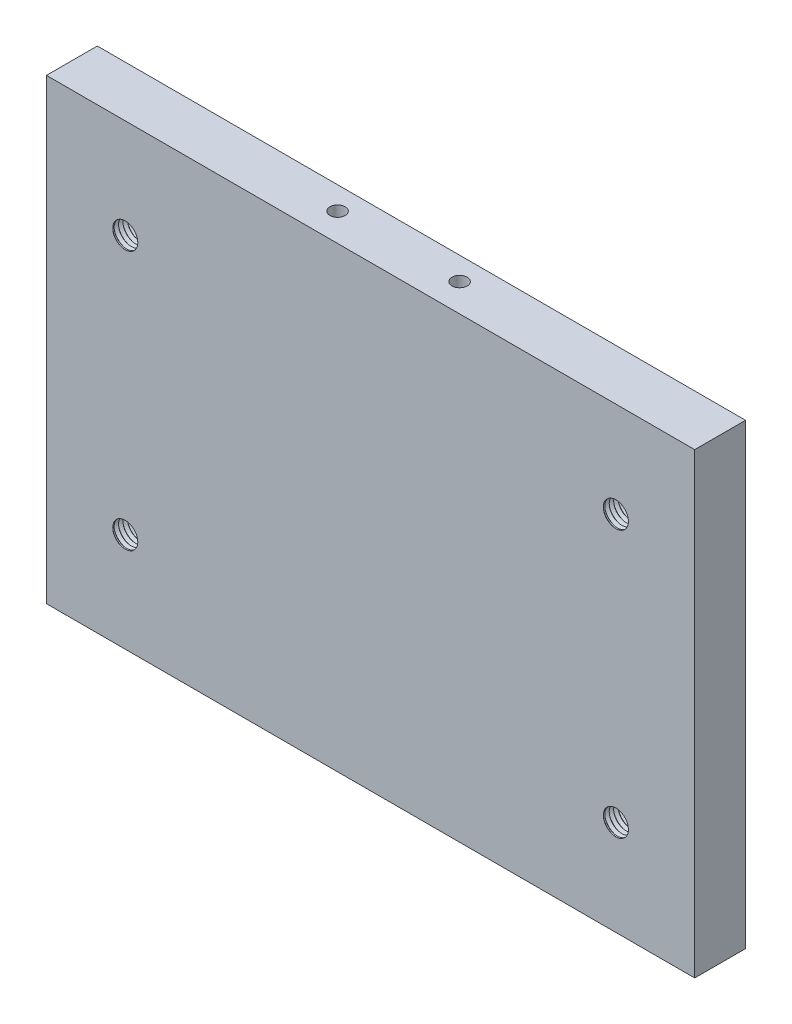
ISO-10303-21;
HEADER;
FILE_DESCRIPTION(('STEP AP214'),'2;1');
FILE_NAME('part.step','',(''),(''),'','','');
FILE_SCHEMA(('AUTOMOTIVE_DESIGN { 1 0 10303 214 1 1 1 1 }'));
ENDSEC;
DATA;
#1=APPLICATION_CONTEXT('core data for automotive mechanical design processes');
#2=APPLICATION_PROTOCOL_DEFINITION('international standard','automotive_design',2000,#1);
#3=PRODUCT_CONTEXT('',#1,'mechanical');
#4=PRODUCT('Part','Part','',(#3));
#5=PRODUCT_RELATED_PRODUCT_CATEGORY('part','',(#4));
#6=PRODUCT_DEFINITION_FORMATION('','',#4);
#7=PRODUCT_DEFINITION_CONTEXT('part definition',#1,'design');
#8=PRODUCT_DEFINITION('design','',#6,#7);
#9=PRODUCT_DEFINITION_SHAPE('','',#8);
#10=(LENGTH_UNIT() NAMED_UNIT(*) SI_UNIT(.MILLI.,.METRE.));
#11=(NAMED_UNIT(*) PLANE_ANGLE_UNIT() SI_UNIT($,.RADIAN.));
#12=(NAMED_UNIT(*) SI_UNIT($,.STERADIAN.) SOLID_ANGLE_UNIT());
#13=UNCERTAINTY_MEASURE_WITH_UNIT(LENGTH_MEASURE(1.E-05),#10,'distance_accuracy_value','');
#14=(GEOMETRIC_REPRESENTATION_CONTEXT(3) GLOBAL_UNCERTAINTY_ASSIGNED_CONTEXT((#13)) GLOBAL_UNIT_ASSIGNED_CONTEXT((#10,
#11,#12)) REPRESENTATION_CONTEXT('',''));
#15=CARTESIAN_POINT('',(0.,0.,0.));
#16=DIRECTION('',(0.,0.,1.));
#17=DIRECTION('',(1.,0.,0.));
#18=AXIS2_PLACEMENT_3D('',#15,#16,#17);
#19=CARTESIAN_POINT('',(-96.5000000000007,39.,14.8235000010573));
#20=DIRECTION('',(0.,0.,1.));
#21=DIRECTION('',(0.,-1.,0.));
#22=AXIS2_PLACEMENT_3D('',#19,#20,#21);
#23=CONICAL_SURFACE('',#22,5.99999999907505,0.886921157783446);
#24=CARTESIAN_POINT('',(-96.5000000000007,39.,13.9485000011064));
#25=DIRECTION('',(0.,0.,-1.));
#26=DIRECTION('',(0.,-1.,0.));
#27=AXIS2_PLACEMENT_3D('',#24,#25,#26);
#28=CIRCLE('',#27,4.92650000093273);
#29=CARTESIAN_POINT('',(-96.5000000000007,34.0734999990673,13.9485000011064));
#30=VERTEX_POINT('',#29);
#31=EDGE_CURVE('E726',#30,#30,#28,.T.);
#32=ORIENTED_EDGE('',*,*,#31,.T.);
#33=EDGE_LOOP('',(#32));
#34=FACE_BOUND('',#33,.T.);
#35=CARTESIAN_POINT('',(-96.5000000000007,39.,14.8234999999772));
#36=DIRECTION('',(0.,0.,-1.));
#37=DIRECTION('',(0.,-1.,0.));
#38=AXIS2_PLACEMENT_3D('',#35,#36,#37);
#39=CIRCLE('',#38,5.99999999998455);
#40=CARTESIAN_POINT('',(-96.5000000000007,33.0000000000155,14.8234999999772));
#41=VERTEX_POINT('',#40);
#42=EDGE_CURVE('E741',#41,#41,#39,.F.);
#43=ORIENTED_EDGE('',*,*,#42,.T.);
#44=EDGE_LOOP('',(#43));
#45=FACE_BOUND('',#44,.T.);
#46=ADVANCED_FACE('F15',(#34,#45),#23,.F.);
#47=CARTESIAN_POINT('',(-96.5000000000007,141.,14.8235000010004));
#48=DIRECTION('',(0.,0.,1.));
#49=DIRECTION('',(0.,-1.,0.));
#50=AXIS2_PLACEMENT_3D('',#47,#48,#49);
#51=CONICAL_SURFACE('',#50,5.99999999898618,0.886921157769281);
#52=CARTESIAN_POINT('',(-96.5000000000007,141.,13.9485000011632));
#53=DIRECTION('',(0.,0.,-1.));
#54=DIRECTION('',(0.,-1.,0.));
#55=AXIS2_PLACEMENT_3D('',#52,#53,#54);
#56=CIRCLE('',#55,4.9265000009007);
#57=CARTESIAN_POINT('',(-96.5000000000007,136.0734999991,13.9485000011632));
#58=VERTEX_POINT('',#57);
#59=EDGE_CURVE('E721',#58,#58,#56,.T.);
#60=ORIENTED_EDGE('',*,*,#59,.T.);
#61=EDGE_LOOP('',(#60));
#62=FACE_BOUND('',#61,.T.);
#63=CARTESIAN_POINT('',(-96.5000000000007,141.,14.8234999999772));
#64=DIRECTION('',(0.,0.,-1.));
#65=DIRECTION('',(0.,-1.,0.));
#66=AXIS2_PLACEMENT_3D('',#63,#64,#65);
#67=CIRCLE('',#66,6.00000000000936);
#68=CARTESIAN_POINT('',(-96.5000000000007,134.999999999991,14.8234999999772));
#69=VERTEX_POINT('',#68);
#70=EDGE_CURVE('E746',#69,#69,#67,.F.);
#71=ORIENTED_EDGE('',*,*,#70,.T.);
#72=EDGE_LOOP('',(#71));
#73=FACE_BOUND('',#72,.T.);
#74=ADVANCED_FACE('F1490',(#62,#73),#51,.F.);
#75=CARTESIAN_POINT('',(96.4999999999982,142.499999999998,14.8235000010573));
#76=DIRECTION('',(0.,0.,1.));
#77=DIRECTION('',(0.,-1.,0.));
#78=AXIS2_PLACEMENT_3D('',#75,#76,#77);
#79=CONICAL_SURFACE('',#78,5.99999999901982,0.886921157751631);
#80=CARTESIAN_POINT('',(96.4999999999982,142.499999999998,13.9485000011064));
#81=DIRECTION('',(0.,0.,-1.));
#82=DIRECTION('',(0.,-1.,0.));
#83=AXIS2_PLACEMENT_3D('',#80,#81,#82);
#84=CIRCLE('',#83,4.92650000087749);
#85=CARTESIAN_POINT('',(96.4999999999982,137.573499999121,13.9485000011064));
#86=VERTEX_POINT('',#85);
#87=EDGE_CURVE('E716',#86,#86,#84,.T.);
#88=ORIENTED_EDGE('',*,*,#87,.T.);
#89=EDGE_LOOP('',(#88));
#90=FACE_BOUND('',#89,.T.);
#91=CARTESIAN_POINT('',(96.4999999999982,142.499999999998,14.8234999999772));
#92=DIRECTION('',(0.,0.,-1.));
#93=DIRECTION('',(0.,-1.,0.));
#94=AXIS2_PLACEMENT_3D('',#91,#92,#93);
#95=CIRCLE('',#94,5.99999999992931);
#96=CARTESIAN_POINT('',(96.4999999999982,136.500000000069,14.8234999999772));
#97=VERTEX_POINT('',#96);
#98=EDGE_CURVE('E731',#97,#97,#95,.F.);
#99=ORIENTED_EDGE('',*,*,#98,.T.);
#100=EDGE_LOOP('',(#99));
#101=FACE_BOUND('',#100,.T.);
#102=ADVANCED_FACE('F1494',(#90,#101),#79,.F.);
#103=CARTESIAN_POINT('',(96.4999999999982,37.5000000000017,14.8235000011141));
#104=DIRECTION('',(0.,0.,1.));
#105=DIRECTION('',(0.,-1.,0.));
#106=AXIS2_PLACEMENT_3D('',#103,#104,#105);
#107=CONICAL_SURFACE('',#106,5.99999999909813,0.88692115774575);
#108=CARTESIAN_POINT('',(96.4999999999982,37.5000000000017,13.9485000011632));
#109=DIRECTION('',(0.,0.,-1.));
#110=DIRECTION('',(0.,-1.,0.));
#111=AXIS2_PLACEMENT_3D('',#108,#109,#110);
#112=CIRCLE('',#111,4.92650000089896);
#113=CARTESIAN_POINT('',(96.4999999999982,32.5734999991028,13.9485000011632));
#114=VERTEX_POINT('',#113);
#115=EDGE_CURVE('E711',#114,#114,#112,.T.);
#116=ORIENTED_EDGE('',*,*,#115,.T.);
#117=EDGE_LOOP('',(#116));
#118=FACE_BOUND('',#117,.T.);
#119=CARTESIAN_POINT('',(96.4999999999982,37.5000000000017,14.8234999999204));
#120=DIRECTION('',(0.,0.,-1.));
#121=DIRECTION('',(0.,-1.,0.));
#122=AXIS2_PLACEMENT_3D('',#119,#120,#121);
#123=CIRCLE('',#122,6.00000000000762);
#124=CARTESIAN_POINT('',(96.4999999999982,31.4999999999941,14.8234999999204));
#125=VERTEX_POINT('',#124);
#126=EDGE_CURVE('E736',#125,#125,#123,.F.);
#127=ORIENTED_EDGE('',*,*,#126,.T.);
#128=EDGE_LOOP('',(#127));
#129=FACE_BOUND('',#128,.T.);
#130=ADVANCED_FACE('F1498',(#118,#129),#107,.F.);
#131=CARTESIAN_POINT('',(-96.5000000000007,141.,14.8235000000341));
#132=DIRECTION('',(0.,0.,-1.));
#133=DIRECTION('',(0.,1.,0.));
#134=AXIS2_PLACEMENT_3D('',#131,#132,#133);
#135=CONICAL_SURFACE('',#134,5.99999999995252,0.886921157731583);
#136=ORIENTED_EDGE('',*,*,#70,.F.);
#137=EDGE_LOOP('',(#136));
#138=FACE_BOUND('',#137,.T.);
#139=CARTESIAN_POINT('',(-96.5000000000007,141.,15.698499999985));
#140=DIRECTION('',(0.,0.,1.));
#141=DIRECTION('',(0.,-1.,0.));
#142=AXIS2_PLACEMENT_3D('',#139,#140,#141);
#143=CIRCLE('',#142,4.92650000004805);
#144=CARTESIAN_POINT('',(-96.5000000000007,136.073499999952,15.698499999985));
#145=VERTEX_POINT('',#144);
#146=EDGE_CURVE('E706',#145,#145,#143,.T.);
#147=ORIENTED_EDGE('',*,*,#146,.T.);
#148=EDGE_LOOP('',(#147));
#149=FACE_BOUND('',#148,.T.);
#150=ADVANCED_FACE('F1502',(#138,#149),#135,.F.);
#151=CARTESIAN_POINT('',(-96.5000000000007,39.,14.8235000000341));
#152=DIRECTION('',(0.,0.,-1.));
#153=DIRECTION('',(0.,1.,0.));
#154=AXIS2_PLACEMENT_3D('',#151,#152,#153);
#155=CONICAL_SURFACE('',#154,5.9999999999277,0.886921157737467);
#156=ORIENTED_EDGE('',*,*,#42,.F.);
#157=EDGE_LOOP('',(#156));
#158=FACE_BOUND('',#157,.T.);
#159=CARTESIAN_POINT('',(-96.5000000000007,39.,15.6984999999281));
#160=DIRECTION('',(0.,0.,1.));
#161=DIRECTION('',(0.,-1.,0.));
#162=AXIS2_PLACEMENT_3D('',#159,#160,#161);
#163=CIRCLE('',#162,4.92650000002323);
#164=CARTESIAN_POINT('',(-96.5000000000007,34.0734999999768,15.6984999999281));
#165=VERTEX_POINT('',#164);
#166=EDGE_CURVE('E701',#165,#165,#163,.T.);
#167=ORIENTED_EDGE('',*,*,#166,.T.);
#168=EDGE_LOOP('',(#167));
#169=FACE_BOUND('',#168,.T.);
#170=ADVANCED_FACE('F1506',(#158,#169),#155,.F.);
#171=CARTESIAN_POINT('',(96.4999999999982,37.5000000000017,14.8234999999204));
#172=DIRECTION('',(0.,0.,-1.));
#173=DIRECTION('',(0.,1.,0.));
#174=AXIS2_PLACEMENT_3D('',#171,#172,#173);
#175=CONICAL_SURFACE('',#174,6.00000000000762,0.886921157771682);
#176=ORIENTED_EDGE('',*,*,#126,.F.);
#177=EDGE_LOOP('',(#176));
#178=FACE_BOUND('',#177,.T.);
#179=CARTESIAN_POINT('',(96.4999999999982,37.5000000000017,15.698499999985));
#180=DIRECTION('',(0.,0.,1.));
#181=DIRECTION('',(0.,-1.,0.));
#182=AXIS2_PLACEMENT_3D('',#179,#180,#181);
#183=CIRCLE('',#182,4.92650000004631);
#184=CARTESIAN_POINT('',(96.4999999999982,32.5734999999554,15.698499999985));
#185=VERTEX_POINT('',#184);
#186=EDGE_CURVE('E696',#185,#185,#183,.T.);
#187=ORIENTED_EDGE('',*,*,#186,.T.);
#188=EDGE_LOOP('',(#187));
#189=FACE_BOUND('',#188,.T.);
#190=ADVANCED_FACE('F1510',(#178,#189),#175,.F.);
#191=CARTESIAN_POINT('',(96.4999999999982,142.499999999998,14.8234999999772));
#192=DIRECTION('',(0.,0.,-1.));
#193=DIRECTION('',(0.,1.,0.));
#194=AXIS2_PLACEMENT_3D('',#191,#192,#193);
#195=CONICAL_SURFACE('',#194,5.99999999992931,0.886921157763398);
#196=ORIENTED_EDGE('',*,*,#98,.F.);
#197=EDGE_LOOP('',(#196));
#198=FACE_BOUND('',#197,.T.);
#199=CARTESIAN_POINT('',(96.4999999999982,142.499999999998,15.698499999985));
#200=DIRECTION('',(0.,0.,1.));
#201=DIRECTION('',(0.,-1.,0.));
#202=AXIS2_PLACEMENT_3D('',#199,#200,#201);
#203=CIRCLE('',#202,4.92650000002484);
#204=CARTESIAN_POINT('',(96.4999999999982,137.573499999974,15.698499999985));
#205=VERTEX_POINT('',#204);
#206=EDGE_CURVE('E691',#205,#205,#203,.T.);
#207=ORIENTED_EDGE('',*,*,#206,.T.);
#208=EDGE_LOOP('',(#207));
#209=FACE_BOUND('',#208,.T.);
#210=ADVANCED_FACE('F1514',(#198,#209),#195,.F.);
#211=CARTESIAN_POINT('',(-96.5000000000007,39.,13.0735000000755));
#212=DIRECTION('',(0.,0.,-1.));
#213=DIRECTION('',(0.,1.,0.));
#214=AXIS2_PLACEMENT_3D('',#211,#212,#213);
#215=CONICAL_SURFACE('',#214,5.9999999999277,0.886921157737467);
#216=CARTESIAN_POINT('',(-96.5000000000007,39.,13.0735000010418));
#217=DIRECTION('',(0.,0.,1.));
#218=DIRECTION('',(0.,-1.,0.));
#219=AXIS2_PLACEMENT_3D('',#216,#217,#218);
#220=CIRCLE('',#219,5.99999999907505);
#221=CARTESIAN_POINT('',(-96.5000000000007,33.000000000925,13.0735000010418));
#222=VERTEX_POINT('',#221);
#223=EDGE_CURVE('E686',#222,#222,#220,.F.);
#224=ORIENTED_EDGE('',*,*,#223,.T.);
#225=EDGE_LOOP('',(#224));
#226=FACE_BOUND('',#225,.T.);
#227=ORIENTED_EDGE('',*,*,#31,.F.);
#228=EDGE_LOOP('',(#227));
#229=FACE_BOUND('',#228,.T.);
#230=ADVANCED_FACE('F1518',(#226,#229),#215,.F.);
#231=CARTESIAN_POINT('',(-96.5000000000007,141.,13.0735000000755));
#232=DIRECTION('',(0.,0.,-1.));
#233=DIRECTION('',(0.,1.,0.));
#234=AXIS2_PLACEMENT_3D('',#231,#232,#233);
#235=CONICAL_SURFACE('',#234,5.99999999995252,0.886921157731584);
#236=CARTESIAN_POINT('',(-96.5000000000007,141.,13.0735000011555));
#237=DIRECTION('',(0.,0.,1.));
#238=DIRECTION('',(0.,-1.,0.));
#239=AXIS2_PLACEMENT_3D('',#236,#237,#238);
#240=CIRCLE('',#239,5.99999999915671);
#241=CARTESIAN_POINT('',(-96.5000000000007,135.000000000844,13.0735000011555));
#242=VERTEX_POINT('',#241);
#243=EDGE_CURVE('E681',#242,#242,#240,.F.);
#244=ORIENTED_EDGE('',*,*,#243,.T.);
#245=EDGE_LOOP('',(#244));
#246=FACE_BOUND('',#245,.T.);
#247=ORIENTED_EDGE('',*,*,#59,.F.);
#248=EDGE_LOOP('',(#247));
#249=FACE_BOUND('',#248,.T.);
#250=ADVANCED_FACE('F1522',(#246,#249),#235,.F.);
#251=CARTESIAN_POINT('',(96.4999999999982,142.499999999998,13.0735000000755));
#252=DIRECTION('',(0.,0.,-1.));
#253=DIRECTION('',(-1.,0.,0.));
#254=AXIS2_PLACEMENT_3D('',#251,#252,#253);
#255=CONICAL_SURFACE('',#254,5.99999999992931,0.886921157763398);
#256=CARTESIAN_POINT('',(96.4999999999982,142.499999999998,13.0735000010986));
#257=DIRECTION('',(0.,0.,1.));
#258=DIRECTION('',(0.,-1.,0.));
#259=AXIS2_PLACEMENT_3D('',#256,#257,#258);
#260=CIRCLE('',#259,5.9999999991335);
#261=CARTESIAN_POINT('',(96.4999999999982,136.500000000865,13.0735000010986));
#262=VERTEX_POINT('',#261);
#263=EDGE_CURVE('E676',#262,#262,#260,.F.);
#264=ORIENTED_EDGE('',*,*,#263,.T.);
#265=EDGE_LOOP('',(#264));
#266=FACE_BOUND('',#265,.T.);
#267=ORIENTED_EDGE('',*,*,#87,.F.);
#268=EDGE_LOOP('',(#267));
#269=FACE_BOUND('',#268,.T.);
#270=ADVANCED_FACE('F1526',(#266,#269),#255,.F.);
#271=CARTESIAN_POINT('',(96.4999999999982,37.5000000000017,13.0735000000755));
#272=DIRECTION('',(0.,0.,-1.));
#273=DIRECTION('',(0.,1.,0.));
#274=AXIS2_PLACEMENT_3D('',#271,#272,#273);
#275=CONICAL_SURFACE('',#274,6.00000000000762,0.886921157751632);
#276=CARTESIAN_POINT('',(96.4999999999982,37.5000000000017,13.0735000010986));
#277=DIRECTION('',(0.,0.,1.));
#278=DIRECTION('',(0.,-1.,0.));
#279=AXIS2_PLACEMENT_3D('',#276,#277,#278);
#280=CIRCLE('',#279,5.99999999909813);
#281=CARTESIAN_POINT('',(96.4999999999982,31.5000000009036,13.0735000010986));
#282=VERTEX_POINT('',#281);
#283=EDGE_CURVE('E671',#282,#282,#280,.F.);
#284=ORIENTED_EDGE('',*,*,#283,.T.);
#285=EDGE_LOOP('',(#284));
#286=FACE_BOUND('',#285,.T.);
#287=ORIENTED_EDGE('',*,*,#115,.F.);
#288=EDGE_LOOP('',(#287));
#289=FACE_BOUND('',#288,.T.);
#290=ADVANCED_FACE('F1530',(#286,#289),#275,.F.);
#291=CARTESIAN_POINT('',(-96.5000000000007,141.,16.573500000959));
#292=DIRECTION('',(0.,0.,1.));
#293=DIRECTION('',(0.,-1.,0.));
#294=AXIS2_PLACEMENT_3D('',#291,#292,#293);
#295=CONICAL_SURFACE('',#294,5.99999999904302,0.886921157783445);
#296=ORIENTED_EDGE('',*,*,#146,.F.);
#297=EDGE_LOOP('',(#296));
#298=FACE_BOUND('',#297,.T.);
#299=CARTESIAN_POINT('',(-96.5000000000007,141.,16.5734999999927));
#300=DIRECTION('',(0.,0.,-1.));
#301=DIRECTION('',(0.,-1.,0.));
#302=AXIS2_PLACEMENT_3D('',#299,#300,#301);
#303=CIRCLE('',#302,6.0000000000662);
#304=CARTESIAN_POINT('',(-96.5000000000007,134.999999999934,16.5734999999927));
#305=VERTEX_POINT('',#304);
#306=EDGE_CURVE('E666',#305,#305,#303,.F.);
#307=ORIENTED_EDGE('',*,*,#306,.T.);
#308=EDGE_LOOP('',(#307));
#309=FACE_BOUND('',#308,.T.);
#310=ADVANCED_FACE('F1534',(#298,#309),#295,.F.);
#311=CARTESIAN_POINT('',(-96.5000000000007,39.,16.5735000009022));
#312=DIRECTION('',(0.,0.,1.));
#313=DIRECTION('',(0.,-1.,0.));
#314=AXIS2_PLACEMENT_3D('',#311,#312,#313);
#315=CONICAL_SURFACE('',#314,5.99999999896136,0.886921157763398);
#316=ORIENTED_EDGE('',*,*,#166,.F.);
#317=EDGE_LOOP('',(#316));
#318=FACE_BOUND('',#317,.T.);
#319=CARTESIAN_POINT('',(-96.5000000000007,39.,16.5734999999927));
#320=DIRECTION('',(0.,0.,-1.));
#321=DIRECTION('',(0.,-1.,0.));
#322=AXIS2_PLACEMENT_3D('',#319,#320,#321);
#323=CIRCLE('',#322,5.99999999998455);
#324=CARTESIAN_POINT('',(-96.5000000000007,33.0000000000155,16.5734999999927));
#325=VERTEX_POINT('',#324);
#326=EDGE_CURVE('E661',#325,#325,#323,.F.);
#327=ORIENTED_EDGE('',*,*,#326,.T.);
#328=EDGE_LOOP('',(#327));
#329=FACE_BOUND('',#328,.T.);
#330=ADVANCED_FACE('F1538',(#318,#329),#315,.F.);
#331=CARTESIAN_POINT('',(96.4999999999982,37.5000000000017,16.5735000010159));
#332=DIRECTION('',(0.,0.,1.));
#333=DIRECTION('',(1.,0.,0.));
#334=AXIS2_PLACEMENT_3D('',#331,#332,#333);
#335=CONICAL_SURFACE('',#334,5.99999999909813,0.886921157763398);
#336=ORIENTED_EDGE('',*,*,#186,.F.);
#337=EDGE_LOOP('',(#336));
#338=FACE_BOUND('',#337,.T.);
#339=CARTESIAN_POINT('',(96.4999999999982,37.5000000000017,16.5735000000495));
#340=DIRECTION('',(0.,0.,-1.));
#341=DIRECTION('',(0.,-1.,0.));
#342=AXIS2_PLACEMENT_3D('',#339,#340,#341);
#343=CIRCLE('',#342,6.00000000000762);
#344=CARTESIAN_POINT('',(96.4999999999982,31.4999999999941,16.5735000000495));
#345=VERTEX_POINT('',#344);
#346=EDGE_CURVE('E656',#345,#345,#343,.F.);
#347=ORIENTED_EDGE('',*,*,#346,.T.);
#348=EDGE_LOOP('',(#347));
#349=FACE_BOUND('',#348,.T.);
#350=ADVANCED_FACE('F1542',(#338,#349),#335,.F.);
#351=CARTESIAN_POINT('',(96.4999999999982,142.499999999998,16.573500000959));
#352=DIRECTION('',(0.,0.,1.));
#353=DIRECTION('',(0.,-1.,0.));
#354=AXIS2_PLACEMENT_3D('',#351,#352,#353);
#355=CONICAL_SURFACE('',#354,5.99999999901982,0.886921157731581);
#356=ORIENTED_EDGE('',*,*,#206,.F.);
#357=EDGE_LOOP('',(#356));
#358=FACE_BOUND('',#357,.T.);
#359=CARTESIAN_POINT('',(96.4999999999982,142.499999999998,16.5734999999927));
#360=DIRECTION('',(0.,0.,-1.));
#361=DIRECTION('',(0.,-1.,0.));
#362=AXIS2_PLACEMENT_3D('',#359,#360,#361);
#363=CIRCLE('',#362,5.99999999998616);
#364=CARTESIAN_POINT('',(96.4999999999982,136.500000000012,16.5734999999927));
#365=VERTEX_POINT('',#364);
#366=EDGE_CURVE('E651',#365,#365,#363,.F.);
#367=ORIENTED_EDGE('',*,*,#366,.T.);
#368=EDGE_LOOP('',(#367));
#369=FACE_BOUND('',#368,.T.);
#370=ADVANCED_FACE('F1546',(#358,#369),#355,.F.);
#371=CARTESIAN_POINT('',(-96.5000000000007,39.,13.0735000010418));
#372=DIRECTION('',(0.,0.,1.));
#373=DIRECTION('',(0.,-1.,0.));
#374=AXIS2_PLACEMENT_3D('',#371,#372,#373);
#375=CONICAL_SURFACE('',#374,5.99999999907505,0.886921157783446);
#376=CARTESIAN_POINT('',(-96.5000000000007,39.,12.1985000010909));
#377=DIRECTION('',(0.,0.,-1.));
#378=DIRECTION('',(0.,-1.,0.));
#379=AXIS2_PLACEMENT_3D('',#376,#377,#378);
#380=CIRCLE('',#379,4.92650000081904);
#381=CARTESIAN_POINT('',(-96.5000000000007,34.073499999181,12.1985000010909));
#382=VERTEX_POINT('',#381);
#383=EDGE_CURVE('E646',#382,#382,#380,.T.);
#384=ORIENTED_EDGE('',*,*,#383,.T.);
#385=EDGE_LOOP('',(#384));
#386=FACE_BOUND('',#385,.T.);
#387=ORIENTED_EDGE('',*,*,#223,.F.);
#388=EDGE_LOOP('',(#387));
#389=FACE_BOUND('',#388,.T.);
#390=ADVANCED_FACE('F1550',(#386,#389),#375,.F.);
#391=CARTESIAN_POINT('',(-96.5000000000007,141.,13.0735000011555));
#392=DIRECTION('',(0.,0.,1.));
#393=DIRECTION('',(0.,-1.,0.));
#394=AXIS2_PLACEMENT_3D('',#391,#392,#393);
#395=CONICAL_SURFACE('',#394,5.99999999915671,0.886921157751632);
#396=CARTESIAN_POINT('',(-96.5000000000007,141.,12.1985000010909));
#397=DIRECTION('',(0.,0.,-1.));
#398=DIRECTION('',(0.,-1.,0.));
#399=AXIS2_PLACEMENT_3D('',#396,#397,#398);
#400=CIRCLE('',#399,4.9265000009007);
#401=CARTESIAN_POINT('',(-96.5000000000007,136.0734999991,12.1985000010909));
#402=VERTEX_POINT('',#401);
#403=EDGE_CURVE('E641',#402,#402,#400,.T.);
#404=ORIENTED_EDGE('',*,*,#403,.T.);
#405=EDGE_LOOP('',(#404));
#406=FACE_BOUND('',#405,.T.);
#407=ORIENTED_EDGE('',*,*,#243,.F.);
#408=EDGE_LOOP('',(#407));
#409=FACE_BOUND('',#408,.T.);
#410=ADVANCED_FACE('F1554',(#406,#409),#395,.F.);
#411=CARTESIAN_POINT('',(96.4999999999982,142.499999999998,13.0735000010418));
#412=DIRECTION('',(0.,0.,1.));
#413=DIRECTION('',(0.,-1.,0.));
#414=AXIS2_PLACEMENT_3D('',#411,#412,#413);
#415=CONICAL_SURFACE('',#414,5.99999999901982,0.886921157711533);
#416=CARTESIAN_POINT('',(96.4999999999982,142.499999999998,12.1985000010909));
#417=DIRECTION('',(0.,0.,-1.));
#418=DIRECTION('',(0.,-1.,0.));
#419=AXIS2_PLACEMENT_3D('',#416,#417,#418);
#420=CIRCLE('',#419,4.92650000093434);
#421=CARTESIAN_POINT('',(96.4999999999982,137.573499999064,12.1985000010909));
#422=VERTEX_POINT('',#421);
#423=EDGE_CURVE('E636',#422,#422,#420,.T.);
#424=ORIENTED_EDGE('',*,*,#423,.T.);
#425=EDGE_LOOP('',(#424));
#426=FACE_BOUND('',#425,.T.);
#427=ORIENTED_EDGE('',*,*,#263,.F.);
#428=EDGE_LOOP('',(#427));
#429=FACE_BOUND('',#428,.T.);
#430=ADVANCED_FACE('F1558',(#426,#429),#415,.F.);
#431=CARTESIAN_POINT('',(96.4999999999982,37.5000000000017,13.0735000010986));
#432=DIRECTION('',(0.,0.,1.));
#433=DIRECTION('',(0.,-1.,0.));
#434=AXIS2_PLACEMENT_3D('',#431,#432,#433);
#435=CONICAL_SURFACE('',#434,5.99999999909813,0.88692115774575);
#436=CARTESIAN_POINT('',(96.4999999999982,37.5000000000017,12.1985000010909));
#437=DIRECTION('',(0.,0.,-1.));
#438=DIRECTION('',(0.,-1.,0.));
#439=AXIS2_PLACEMENT_3D('',#436,#437,#438);
#440=CIRCLE('',#439,4.92650000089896);
#441=CARTESIAN_POINT('',(96.4999999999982,32.5734999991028,12.1985000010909));
#442=VERTEX_POINT('',#441);
#443=EDGE_CURVE('E631',#442,#442,#440,.T.);
#444=ORIENTED_EDGE('',*,*,#443,.T.);
#445=EDGE_LOOP('',(#444));
#446=FACE_BOUND('',#445,.T.);
#447=ORIENTED_EDGE('',*,*,#283,.F.);
#448=EDGE_LOOP('',(#447));
#449=FACE_BOUND('',#448,.T.);
#450=ADVANCED_FACE('F1562',(#446,#449),#435,.F.);
#451=CARTESIAN_POINT('',(-96.5000000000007,141.,16.5735000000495));
#452=DIRECTION('',(0.,0.,-1.));
#453=DIRECTION('',(0.,1.,0.));
#454=AXIS2_PLACEMENT_3D('',#451,#452,#453);
#455=CONICAL_SURFACE('',#454,5.99999999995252,0.886921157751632);
#456=ORIENTED_EDGE('',*,*,#306,.F.);
#457=EDGE_LOOP('',(#456));
#458=FACE_BOUND('',#457,.T.);
#459=CARTESIAN_POINT('',(-96.5000000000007,141.,17.4485000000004));
#460=DIRECTION('',(0.,0.,1.));
#461=DIRECTION('',(0.,-1.,0.));
#462=AXIS2_PLACEMENT_3D('',#459,#460,#461);
#463=CIRCLE('',#462,4.92650000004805);
#464=CARTESIAN_POINT('',(-96.5000000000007,136.073499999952,17.4485000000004));
#465=VERTEX_POINT('',#464);
#466=EDGE_CURVE('E626',#465,#465,#463,.T.);
#467=ORIENTED_EDGE('',*,*,#466,.T.);
#468=EDGE_LOOP('',(#467));
#469=FACE_BOUND('',#468,.T.);
#470=ADVANCED_FACE('F1566',(#458,#469),#455,.F.);
#471=CARTESIAN_POINT('',(-96.5000000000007,39.,16.5735000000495));
#472=DIRECTION('',(0.,0.,-1.));
#473=DIRECTION('',(0.,1.,0.));
#474=AXIS2_PLACEMENT_3D('',#471,#472,#473);
#475=CONICAL_SURFACE('',#474,5.9999999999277,0.886921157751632);
#476=ORIENTED_EDGE('',*,*,#326,.F.);
#477=EDGE_LOOP('',(#476));
#478=FACE_BOUND('',#477,.T.);
#479=CARTESIAN_POINT('',(-96.5000000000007,39.,17.4484999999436));
#480=DIRECTION('',(0.,0.,1.));
#481=DIRECTION('',(0.,-1.,0.));
#482=AXIS2_PLACEMENT_3D('',#479,#480,#481);
#483=CIRCLE('',#482,4.92650000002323);
#484=CARTESIAN_POINT('',(-96.5000000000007,34.0734999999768,17.4484999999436));
#485=VERTEX_POINT('',#484);
#486=EDGE_CURVE('E621',#485,#485,#483,.T.);
#487=ORIENTED_EDGE('',*,*,#486,.T.);
#488=EDGE_LOOP('',(#487));
#489=FACE_BOUND('',#488,.T.);
#490=ADVANCED_FACE('F1570',(#478,#489),#475,.F.);
#491=CARTESIAN_POINT('',(96.4999999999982,37.5000000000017,16.5735000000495));
#492=DIRECTION('',(0.,0.,-1.));
#493=DIRECTION('',(0.,1.,0.));
#494=AXIS2_PLACEMENT_3D('',#491,#492,#493);
#495=CONICAL_SURFACE('',#494,6.00000000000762,0.886921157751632);
#496=ORIENTED_EDGE('',*,*,#346,.F.);
#497=EDGE_LOOP('',(#496));
#498=FACE_BOUND('',#497,.T.);
#499=CARTESIAN_POINT('',(96.4999999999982,37.5000000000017,17.4485000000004));
#500=DIRECTION('',(0.,0.,1.));
#501=DIRECTION('',(0.,-1.,0.));
#502=AXIS2_PLACEMENT_3D('',#499,#500,#501);
#503=CIRCLE('',#502,4.92650000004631);
#504=CARTESIAN_POINT('',(96.4999999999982,32.5734999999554,17.4485000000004));
#505=VERTEX_POINT('',#504);
#506=EDGE_CURVE('E616',#505,#505,#503,.T.);
#507=ORIENTED_EDGE('',*,*,#506,.T.);
#508=EDGE_LOOP('',(#507));
#509=FACE_BOUND('',#508,.T.);
#510=ADVANCED_FACE('F1574',(#498,#509),#495,.F.);
#511=CARTESIAN_POINT('',(96.4999999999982,142.499999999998,16.5735000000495));
#512=DIRECTION('',(0.,0.,-1.));
#513=DIRECTION('',(-1.,0.,0.));
#514=AXIS2_PLACEMENT_3D('',#511,#512,#513);
#515=CONICAL_SURFACE('',#514,5.99999999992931,0.886921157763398);
#516=ORIENTED_EDGE('',*,*,#366,.F.);
#517=EDGE_LOOP('',(#516));
#518=FACE_BOUND('',#517,.T.);
#519=CARTESIAN_POINT('',(96.4999999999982,142.499999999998,17.4485000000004));
#520=DIRECTION('',(0.,0.,1.));
#521=DIRECTION('',(0.,-1.,0.));
#522=AXIS2_PLACEMENT_3D('',#519,#520,#521);
#523=CIRCLE('',#522,4.92650000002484);
#524=CARTESIAN_POINT('',(96.4999999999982,137.573499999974,17.4485000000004));
#525=VERTEX_POINT('',#524);
#526=EDGE_CURVE('E611',#525,#525,#523,.T.);
#527=ORIENTED_EDGE('',*,*,#526,.T.);
#528=EDGE_LOOP('',(#527));
#529=FACE_BOUND('',#528,.T.);
#530=ADVANCED_FACE('F1578',(#518,#529),#515,.F.);
#531=CARTESIAN_POINT('',(-96.5000000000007,39.,11.32350000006));
#532=DIRECTION('',(0.,0.,-1.));
#533=DIRECTION('',(0.,1.,0.));
#534=AXIS2_PLACEMENT_3D('',#531,#532,#533);
#535=CONICAL_SURFACE('',#534,5.9999999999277,0.886921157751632);
#536=CARTESIAN_POINT('',(-96.5000000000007,39.,11.3235000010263));
#537=DIRECTION('',(0.,0.,1.));
#538=DIRECTION('',(0.,-1.,0.));
#539=AXIS2_PLACEMENT_3D('',#536,#537,#538);
#540=CIRCLE('',#539,5.99999999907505);
#541=CARTESIAN_POINT('',(-96.5000000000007,33.000000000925,11.3235000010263));
#542=VERTEX_POINT('',#541);
#543=EDGE_CURVE('E606',#542,#542,#540,.F.);
#544=ORIENTED_EDGE('',*,*,#543,.T.);
#545=EDGE_LOOP('',(#544));
#546=FACE_BOUND('',#545,.T.);
#547=ORIENTED_EDGE('',*,*,#383,.F.);
#548=EDGE_LOOP('',(#547));
#549=FACE_BOUND('',#548,.T.);
#550=ADVANCED_FACE('F1582',(#546,#549),#535,.F.);
#551=CARTESIAN_POINT('',(-96.5000000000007,141.,11.32350000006));
#552=DIRECTION('',(0.,0.,-1.));
#553=DIRECTION('',(0.,1.,0.));
#554=AXIS2_PLACEMENT_3D('',#551,#552,#553);
#555=CONICAL_SURFACE('',#554,5.99999999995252,0.886921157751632);
#556=CARTESIAN_POINT('',(-96.5000000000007,141.,11.32350000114));
#557=DIRECTION('',(0.,0.,1.));
#558=DIRECTION('',(0.,-1.,0.));
#559=AXIS2_PLACEMENT_3D('',#556,#557,#558);
#560=CIRCLE('',#559,5.99999999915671);
#561=CARTESIAN_POINT('',(-96.5000000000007,135.000000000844,11.32350000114));
#562=VERTEX_POINT('',#561);
#563=EDGE_CURVE('E601',#562,#562,#560,.F.);
#564=ORIENTED_EDGE('',*,*,#563,.T.);
#565=EDGE_LOOP('',(#564));
#566=FACE_BOUND('',#565,.T.);
#567=ORIENTED_EDGE('',*,*,#403,.F.);
#568=EDGE_LOOP('',(#567));
#569=FACE_BOUND('',#568,.T.);
#570=ADVANCED_FACE('F1586',(#566,#569),#555,.F.);
#571=CARTESIAN_POINT('',(96.4999999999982,142.499999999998,11.3235000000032));
#572=DIRECTION('',(0.,0.,-1.));
#573=DIRECTION('',(-1.,0.,0.));
#574=AXIS2_PLACEMENT_3D('',#571,#572,#573);
#575=CONICAL_SURFACE('',#574,5.99999999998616,0.886921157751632);
#576=CARTESIAN_POINT('',(96.4999999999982,142.499999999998,11.3235000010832));
#577=DIRECTION('',(0.,0.,1.));
#578=DIRECTION('',(0.,-1.,0.));
#579=AXIS2_PLACEMENT_3D('',#576,#577,#578);
#580=CIRCLE('',#579,5.9999999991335);
#581=CARTESIAN_POINT('',(96.4999999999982,136.500000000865,11.3235000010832));
#582=VERTEX_POINT('',#581);
#583=EDGE_CURVE('E596',#582,#582,#580,.F.);
#584=ORIENTED_EDGE('',*,*,#583,.T.);
#585=EDGE_LOOP('',(#584));
#586=FACE_BOUND('',#585,.T.);
#587=ORIENTED_EDGE('',*,*,#423,.F.);
#588=EDGE_LOOP('',(#587));
#589=FACE_BOUND('',#588,.T.);
#590=ADVANCED_FACE('F1590',(#586,#589),#575,.F.);
#591=CARTESIAN_POINT('',(96.4999999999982,37.5000000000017,11.3235000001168));
#592=DIRECTION('',(0.,0.,-1.));
#593=DIRECTION('',(0.,1.,0.));
#594=AXIS2_PLACEMENT_3D('',#591,#592,#593);
#595=CONICAL_SURFACE('',#594,5.99999999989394,0.886921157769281);
#596=CARTESIAN_POINT('',(96.4999999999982,37.5000000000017,11.3235000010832));
#597=DIRECTION('',(0.,0.,1.));
#598=DIRECTION('',(0.,-1.,0.));
#599=AXIS2_PLACEMENT_3D('',#596,#597,#598);
#600=CIRCLE('',#599,5.99999999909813);
#601=CARTESIAN_POINT('',(96.4999999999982,31.5000000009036,11.3235000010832));
#602=VERTEX_POINT('',#601);
#603=EDGE_CURVE('E591',#602,#602,#600,.F.);
#604=ORIENTED_EDGE('',*,*,#603,.T.);
#605=EDGE_LOOP('',(#604));
#606=FACE_BOUND('',#605,.T.);
#607=ORIENTED_EDGE('',*,*,#443,.F.);
#608=EDGE_LOOP('',(#607));
#609=FACE_BOUND('',#608,.T.);
#610=ADVANCED_FACE('F1594',(#606,#609),#595,.F.);
#611=CARTESIAN_POINT('',(-96.5000000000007,141.,18.3235000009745));
#612=DIRECTION('',(0.,0.,1.));
#613=DIRECTION('',(0.,-1.,0.));
#614=AXIS2_PLACEMENT_3D('',#611,#612,#613);
#615=CONICAL_SURFACE('',#614,5.99999999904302,0.886921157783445);
#616=ORIENTED_EDGE('',*,*,#466,.F.);
#617=EDGE_LOOP('',(#616));
#618=FACE_BOUND('',#617,.T.);
#619=CARTESIAN_POINT('',(-96.5000000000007,141.,18.3235000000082));
#620=DIRECTION('',(0.,0.,-1.));
#621=DIRECTION('',(0.,-1.,0.));
#622=AXIS2_PLACEMENT_3D('',#619,#620,#621);
#623=CIRCLE('',#622,6.00000000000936);
#624=CARTESIAN_POINT('',(-96.5000000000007,134.999999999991,18.3235000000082));
#625=VERTEX_POINT('',#624);
#626=EDGE_CURVE('E586',#625,#625,#623,.F.);
#627=ORIENTED_EDGE('',*,*,#626,.T.);
#628=EDGE_LOOP('',(#627));
#629=FACE_BOUND('',#628,.T.);
#630=ADVANCED_FACE('F1598',(#618,#629),#615,.F.);
#631=CARTESIAN_POINT('',(-96.5000000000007,39.,18.3235000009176));
#632=DIRECTION('',(0.,0.,1.));
#633=DIRECTION('',(0.,-1.,0.));
#634=AXIS2_PLACEMENT_3D('',#631,#632,#633);
#635=CONICAL_SURFACE('',#634,5.99999999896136,0.886921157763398);
#636=ORIENTED_EDGE('',*,*,#486,.F.);
#637=EDGE_LOOP('',(#636));
#638=FACE_BOUND('',#637,.T.);
#639=CARTESIAN_POINT('',(-96.5000000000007,39.,18.3235000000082));
#640=DIRECTION('',(0.,0.,-1.));
#641=DIRECTION('',(0.,-1.,0.));
#642=AXIS2_PLACEMENT_3D('',#639,#640,#641);
#643=CIRCLE('',#642,6.00000000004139);
#644=CARTESIAN_POINT('',(-96.5000000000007,32.9999999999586,18.3235000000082));
#645=VERTEX_POINT('',#644);
#646=EDGE_CURVE('E581',#645,#645,#643,.F.);
#647=ORIENTED_EDGE('',*,*,#646,.T.);
#648=EDGE_LOOP('',(#647));
#649=FACE_BOUND('',#648,.T.);
#650=ADVANCED_FACE('F1602',(#638,#649),#635,.F.);
#651=CARTESIAN_POINT('',(96.4999999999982,37.5000000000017,18.3235000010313));
#652=DIRECTION('',(0.,0.,1.));
#653=DIRECTION('',(1.,0.,0.));
#654=AXIS2_PLACEMENT_3D('',#651,#652,#653);
#655=CONICAL_SURFACE('',#654,5.99999999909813,0.886921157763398);
#656=ORIENTED_EDGE('',*,*,#506,.F.);
#657=EDGE_LOOP('',(#656));
#658=FACE_BOUND('',#657,.T.);
#659=CARTESIAN_POINT('',(96.4999999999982,37.5000000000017,18.323500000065));
#660=DIRECTION('',(0.,0.,-1.));
#661=DIRECTION('',(0.,-1.,0.));
#662=AXIS2_PLACEMENT_3D('',#659,#660,#661);
#663=CIRCLE('',#662,6.00000000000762);
#664=CARTESIAN_POINT('',(96.4999999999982,31.4999999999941,18.323500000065));
#665=VERTEX_POINT('',#664);
#666=EDGE_CURVE('E576',#665,#665,#663,.F.);
#667=ORIENTED_EDGE('',*,*,#666,.T.);
#668=EDGE_LOOP('',(#667));
#669=FACE_BOUND('',#668,.T.);
#670=ADVANCED_FACE('F1606',(#658,#669),#655,.F.);
#671=CARTESIAN_POINT('',(96.4999999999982,142.499999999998,18.3235000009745));
#672=DIRECTION('',(0.,0.,1.));
#673=DIRECTION('',(0.,-1.,0.));
#674=AXIS2_PLACEMENT_3D('',#671,#672,#673);
#675=CONICAL_SURFACE('',#674,5.99999999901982,0.886921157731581);
#676=ORIENTED_EDGE('',*,*,#526,.F.);
#677=EDGE_LOOP('',(#676));
#678=FACE_BOUND('',#677,.T.);
#679=CARTESIAN_POINT('',(96.4999999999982,142.499999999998,18.3235000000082));
#680=DIRECTION('',(0.,0.,-1.));
#681=DIRECTION('',(0.,-1.,0.));
#682=AXIS2_PLACEMENT_3D('',#679,#680,#681);
#683=CIRCLE('',#682,5.99999999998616);
#684=CARTESIAN_POINT('',(96.4999999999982,136.500000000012,18.3235000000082));
#685=VERTEX_POINT('',#684);
#686=EDGE_CURVE('E571',#685,#685,#683,.F.);
#687=ORIENTED_EDGE('',*,*,#686,.T.);
#688=EDGE_LOOP('',(#687));
#689=FACE_BOUND('',#688,.T.);
#690=ADVANCED_FACE('F1610',(#678,#689),#675,.F.);
#691=CARTESIAN_POINT('',(-96.5000000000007,39.,11.3235000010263));
#692=DIRECTION('',(0.,0.,1.));
#693=DIRECTION('',(0.,-1.,0.));
#694=AXIS2_PLACEMENT_3D('',#691,#692,#693);
#695=CONICAL_SURFACE('',#694,5.99999999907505,0.886921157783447);
#696=CARTESIAN_POINT('',(-96.5000000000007,39.,10.4485000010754));
#697=DIRECTION('',(0.,0.,-1.));
#698=DIRECTION('',(0.,-1.,0.));
#699=AXIS2_PLACEMENT_3D('',#696,#697,#698);
#700=CIRCLE('',#699,4.92650000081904);
#701=CARTESIAN_POINT('',(-96.5000000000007,34.073499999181,10.4485000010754));
#702=VERTEX_POINT('',#701);
#703=EDGE_CURVE('E566',#702,#702,#700,.T.);
#704=ORIENTED_EDGE('',*,*,#703,.T.);
#705=EDGE_LOOP('',(#704));
#706=FACE_BOUND('',#705,.T.);
#707=ORIENTED_EDGE('',*,*,#543,.F.);
#708=EDGE_LOOP('',(#707));
#709=FACE_BOUND('',#708,.T.);
#710=ADVANCED_FACE('F1614',(#706,#709),#695,.F.);
#711=CARTESIAN_POINT('',(-96.5000000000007,141.,11.32350000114));
#712=DIRECTION('',(0.,0.,1.));
#713=DIRECTION('',(0.,-1.,0.));
#714=AXIS2_PLACEMENT_3D('',#711,#712,#713);
#715=CONICAL_SURFACE('',#714,5.99999999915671,0.886921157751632);
#716=CARTESIAN_POINT('',(-96.5000000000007,141.,10.4485000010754));
#717=DIRECTION('',(0.,0.,-1.));
#718=DIRECTION('',(0.,-1.,0.));
#719=AXIS2_PLACEMENT_3D('',#716,#717,#718);
#720=CIRCLE('',#719,4.9265000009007);
#721=CARTESIAN_POINT('',(-96.5000000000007,136.0734999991,10.4485000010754));
#722=VERTEX_POINT('',#721);
#723=EDGE_CURVE('E561',#722,#722,#720,.T.);
#724=ORIENTED_EDGE('',*,*,#723,.T.);
#725=EDGE_LOOP('',(#724));
#726=FACE_BOUND('',#725,.T.);
#727=ORIENTED_EDGE('',*,*,#563,.F.);
#728=EDGE_LOOP('',(#727));
#729=FACE_BOUND('',#728,.T.);
#730=ADVANCED_FACE('F1618',(#726,#729),#715,.F.);
#731=CARTESIAN_POINT('',(96.4999999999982,142.499999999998,11.3235000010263));
#732=DIRECTION('',(0.,0.,1.));
#733=DIRECTION('',(0.,-1.,0.));
#734=AXIS2_PLACEMENT_3D('',#731,#732,#733);
#735=CONICAL_SURFACE('',#734,5.99999999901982,0.886921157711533);
#736=CARTESIAN_POINT('',(96.4999999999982,142.499999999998,10.4485000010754));
#737=DIRECTION('',(0.,0.,-1.));
#738=DIRECTION('',(0.,-1.,0.));
#739=AXIS2_PLACEMENT_3D('',#736,#737,#738);
#740=CIRCLE('',#739,4.92650000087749);
#741=CARTESIAN_POINT('',(96.4999999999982,137.573499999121,10.4485000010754));
#742=VERTEX_POINT('',#741);
#743=EDGE_CURVE('E556',#742,#742,#740,.T.);
#744=ORIENTED_EDGE('',*,*,#743,.T.);
#745=EDGE_LOOP('',(#744));
#746=FACE_BOUND('',#745,.T.);
#747=ORIENTED_EDGE('',*,*,#583,.F.);
#748=EDGE_LOOP('',(#747));
#749=FACE_BOUND('',#748,.T.);
#750=ADVANCED_FACE('F1622',(#746,#749),#735,.F.);
#751=CARTESIAN_POINT('',(96.4999999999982,37.5000000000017,11.3235000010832));
#752=DIRECTION('',(0.,0.,1.));
#753=DIRECTION('',(0.,-1.,0.));
#754=AXIS2_PLACEMENT_3D('',#751,#752,#753);
#755=CONICAL_SURFACE('',#754,5.99999999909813,0.886921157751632);
#756=CARTESIAN_POINT('',(96.4999999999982,37.5000000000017,10.4485000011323));
#757=DIRECTION('',(0.,0.,-1.));
#758=DIRECTION('',(0.,-1.,0.));
#759=AXIS2_PLACEMENT_3D('',#756,#757,#758);
#760=CIRCLE('',#759,4.92650000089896);
#761=CARTESIAN_POINT('',(96.4999999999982,32.5734999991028,10.4485000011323));
#762=VERTEX_POINT('',#761);
#763=EDGE_CURVE('E551',#762,#762,#760,.T.);
#764=ORIENTED_EDGE('',*,*,#763,.T.);
#765=EDGE_LOOP('',(#764));
#766=FACE_BOUND('',#765,.T.);
#767=ORIENTED_EDGE('',*,*,#603,.F.);
#768=EDGE_LOOP('',(#767));
#769=FACE_BOUND('',#768,.T.);
#770=ADVANCED_FACE('F1626',(#766,#769),#755,.F.);
#771=CARTESIAN_POINT('',(-96.5000000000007,141.,18.323500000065));
#772=DIRECTION('',(0.,0.,-1.));
#773=DIRECTION('',(0.,1.,0.));
#774=AXIS2_PLACEMENT_3D('',#771,#772,#773);
#775=CONICAL_SURFACE('',#774,5.99999999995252,0.88692115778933);
#776=ORIENTED_EDGE('',*,*,#626,.F.);
#777=EDGE_LOOP('',(#776));
#778=FACE_BOUND('',#777,.T.);
#779=CARTESIAN_POINT('',(-96.5000000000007,141.,19.198499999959));
#780=DIRECTION('',(0.,0.,1.));
#781=DIRECTION('',(0.,-1.,0.));
#782=AXIS2_PLACEMENT_3D('',#779,#780,#781);
#783=CIRCLE('',#782,4.92649999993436);
#784=CARTESIAN_POINT('',(-96.5000000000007,136.073500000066,19.198499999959));
#785=VERTEX_POINT('',#784);
#786=EDGE_CURVE('E546',#785,#785,#783,.T.);
#787=ORIENTED_EDGE('',*,*,#786,.T.);
#788=EDGE_LOOP('',(#787));
#789=FACE_BOUND('',#788,.T.);
#790=ADVANCED_FACE('F1630',(#778,#789),#775,.F.);
#791=CARTESIAN_POINT('',(-96.5000000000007,39.,18.3235000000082));
#792=DIRECTION('',(0.,0.,-1.));
#793=DIRECTION('',(0.,1.,0.));
#794=AXIS2_PLACEMENT_3D('',#791,#792,#793);
#795=CONICAL_SURFACE('',#794,6.00000000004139,0.886921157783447);
#796=ORIENTED_EDGE('',*,*,#646,.F.);
#797=EDGE_LOOP('',(#796));
#798=FACE_BOUND('',#797,.T.);
#799=CARTESIAN_POINT('',(-96.5000000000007,39.,19.198499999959));
#800=DIRECTION('',(0.,0.,1.));
#801=DIRECTION('',(0.,-1.,0.));
#802=AXIS2_PLACEMENT_3D('',#799,#800,#801);
#803=CIRCLE('',#802,4.92650000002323);
#804=CARTESIAN_POINT('',(-96.5000000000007,34.0734999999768,19.198499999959));
#805=VERTEX_POINT('',#804);
#806=EDGE_CURVE('E541',#805,#805,#803,.T.);
#807=ORIENTED_EDGE('',*,*,#806,.T.);
#808=EDGE_LOOP('',(#807));
#809=FACE_BOUND('',#808,.T.);
#810=ADVANCED_FACE('F1634',(#798,#809),#795,.F.);
#811=CARTESIAN_POINT('',(96.4999999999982,37.5000000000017,18.323500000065));
#812=DIRECTION('',(0.,0.,-1.));
#813=DIRECTION('',(0.,1.,0.));
#814=AXIS2_PLACEMENT_3D('',#811,#812,#813);
#815=CONICAL_SURFACE('',#814,6.00000000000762,0.886921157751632);
#816=ORIENTED_EDGE('',*,*,#666,.F.);
#817=EDGE_LOOP('',(#816));
#818=FACE_BOUND('',#817,.T.);
#819=CARTESIAN_POINT('',(96.4999999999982,37.5000000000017,19.1985000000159));
#820=DIRECTION('',(0.,0.,1.));
#821=DIRECTION('',(0.,-1.,0.));
#822=AXIS2_PLACEMENT_3D('',#819,#820,#821);
#823=CIRCLE('',#822,4.92650000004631);
#824=CARTESIAN_POINT('',(96.4999999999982,32.5734999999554,19.1985000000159));
#825=VERTEX_POINT('',#824);
#826=EDGE_CURVE('E536',#825,#825,#823,.T.);
#827=ORIENTED_EDGE('',*,*,#826,.T.);
#828=EDGE_LOOP('',(#827));
#829=FACE_BOUND('',#828,.T.);
#830=ADVANCED_FACE('F1638',(#818,#829),#815,.F.);
#831=CARTESIAN_POINT('',(96.4999999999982,142.499999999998,18.323500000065));
#832=DIRECTION('',(0.,0.,-1.));
#833=DIRECTION('',(-1.,0.,0.));
#834=AXIS2_PLACEMENT_3D('',#831,#832,#833);
#835=CONICAL_SURFACE('',#834,5.99999999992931,0.886921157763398);
#836=ORIENTED_EDGE('',*,*,#686,.F.);
#837=EDGE_LOOP('',(#836));
#838=FACE_BOUND('',#837,.T.);
#839=CARTESIAN_POINT('',(96.4999999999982,142.499999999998,19.1985000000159));
#840=DIRECTION('',(0.,0.,1.));
#841=DIRECTION('',(0.,-1.,0.));
#842=AXIS2_PLACEMENT_3D('',#839,#840,#841);
#843=CIRCLE('',#842,4.92650000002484);
#844=CARTESIAN_POINT('',(96.4999999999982,137.573499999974,19.1985000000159));
#845=VERTEX_POINT('',#844);
#846=EDGE_CURVE('E531',#845,#845,#843,.T.);
#847=ORIENTED_EDGE('',*,*,#846,.T.);
#848=EDGE_LOOP('',(#847));
#849=FACE_BOUND('',#848,.T.);
#850=ADVANCED_FACE('F1642',(#838,#849),#835,.F.);
#851=CARTESIAN_POINT('',(-96.5000000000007,39.,9.57350000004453));
#852=DIRECTION('',(0.,0.,-1.));
#853=DIRECTION('',(0.,1.,0.));
#854=AXIS2_PLACEMENT_3D('',#851,#852,#853);
#855=CONICAL_SURFACE('',#854,5.9999999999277,0.886921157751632);
#856=CARTESIAN_POINT('',(-96.5000000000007,39.,9.57350000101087));
#857=DIRECTION('',(0.,0.,1.));
#858=DIRECTION('',(0.,-1.,0.));
#859=AXIS2_PLACEMENT_3D('',#856,#857,#858);
#860=CIRCLE('',#859,5.99999999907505);
#861=CARTESIAN_POINT('',(-96.5000000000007,33.000000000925,9.57350000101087));
#862=VERTEX_POINT('',#861);
#863=EDGE_CURVE('E526',#862,#862,#860,.F.);
#864=ORIENTED_EDGE('',*,*,#863,.T.);
#865=EDGE_LOOP('',(#864));
#866=FACE_BOUND('',#865,.T.);
#867=ORIENTED_EDGE('',*,*,#703,.F.);
#868=EDGE_LOOP('',(#867));
#869=FACE_BOUND('',#868,.T.);
#870=ADVANCED_FACE('F1646',(#866,#869),#855,.F.);
#871=CARTESIAN_POINT('',(-96.5000000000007,141.,9.57350000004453));
#872=DIRECTION('',(0.,0.,-1.));
#873=DIRECTION('',(0.,1.,0.));
#874=AXIS2_PLACEMENT_3D('',#871,#872,#873);
#875=CONICAL_SURFACE('',#874,5.99999999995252,0.886921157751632);
#876=CARTESIAN_POINT('',(-96.5000000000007,141.,9.57350000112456));
#877=DIRECTION('',(0.,0.,1.));
#878=DIRECTION('',(0.,-1.,0.));
#879=AXIS2_PLACEMENT_3D('',#876,#877,#878);
#880=CIRCLE('',#879,5.99999999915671);
#881=CARTESIAN_POINT('',(-96.5000000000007,135.000000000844,9.57350000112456));
#882=VERTEX_POINT('',#881);
#883=EDGE_CURVE('E521',#882,#882,#880,.F.);
#884=ORIENTED_EDGE('',*,*,#883,.T.);
#885=EDGE_LOOP('',(#884));
#886=FACE_BOUND('',#885,.T.);
#887=ORIENTED_EDGE('',*,*,#723,.F.);
#888=EDGE_LOOP('',(#887));
#889=FACE_BOUND('',#888,.T.);
#890=ADVANCED_FACE('F1650',(#886,#889),#875,.F.);
#891=CARTESIAN_POINT('',(96.4999999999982,142.499999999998,9.57350000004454));
#892=DIRECTION('',(0.,0.,-1.));
#893=DIRECTION('',(0.,1.,0.));
#894=AXIS2_PLACEMENT_3D('',#891,#892,#893);
#895=CONICAL_SURFACE('',#894,5.99999999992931,0.886921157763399);
#896=CARTESIAN_POINT('',(96.4999999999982,142.499999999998,9.57350000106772));
#897=DIRECTION('',(0.,0.,1.));
#898=DIRECTION('',(0.,-1.,0.));
#899=AXIS2_PLACEMENT_3D('',#896,#897,#898);
#900=CIRCLE('',#899,5.9999999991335);
#901=CARTESIAN_POINT('',(96.4999999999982,136.500000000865,9.57350000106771));
#902=VERTEX_POINT('',#901);
#903=EDGE_CURVE('E516',#902,#902,#900,.F.);
#904=ORIENTED_EDGE('',*,*,#903,.T.);
#905=EDGE_LOOP('',(#904));
#906=FACE_BOUND('',#905,.T.);
#907=ORIENTED_EDGE('',*,*,#743,.F.);
#908=EDGE_LOOP('',(#907));
#909=FACE_BOUND('',#908,.T.);
#910=ADVANCED_FACE('F1654',(#906,#909),#895,.F.);
#911=CARTESIAN_POINT('',(96.4999999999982,37.5000000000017,9.57350000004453));
#912=DIRECTION('',(0.,0.,-1.));
#913=DIRECTION('',(0.,1.,0.));
#914=AXIS2_PLACEMENT_3D('',#911,#912,#913);
#915=CONICAL_SURFACE('',#914,6.00000000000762,0.886921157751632);
#916=CARTESIAN_POINT('',(96.4999999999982,37.5000000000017,9.57350000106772));
#917=DIRECTION('',(0.,0.,1.));
#918=DIRECTION('',(0.,-1.,0.));
#919=AXIS2_PLACEMENT_3D('',#916,#917,#918);
#920=CIRCLE('',#919,5.99999999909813);
#921=CARTESIAN_POINT('',(96.4999999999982,31.5000000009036,9.57350000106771));
#922=VERTEX_POINT('',#921);
#923=EDGE_CURVE('E511',#922,#922,#920,.F.);
#924=ORIENTED_EDGE('',*,*,#923,.T.);
#925=EDGE_LOOP('',(#924));
#926=FACE_BOUND('',#925,.T.);
#927=ORIENTED_EDGE('',*,*,#763,.F.);
#928=EDGE_LOOP('',(#927));
#929=FACE_BOUND('',#928,.T.);
#930=ADVANCED_FACE('F1658',(#926,#929),#915,.F.);
#931=CARTESIAN_POINT('',(-96.5000000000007,141.,20.07350000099));
#932=DIRECTION('',(0.,0.,1.));
#933=DIRECTION('',(0.,-1.,0.));
#934=AXIS2_PLACEMENT_3D('',#931,#932,#933);
#935=CONICAL_SURFACE('',#934,5.99999999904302,0.886921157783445);
#936=ORIENTED_EDGE('',*,*,#786,.F.);
#937=EDGE_LOOP('',(#936));
#938=FACE_BOUND('',#937,.T.);
#939=CARTESIAN_POINT('',(-96.5000000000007,141.,20.0735000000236));
#940=DIRECTION('',(0.,0.,-1.));
#941=DIRECTION('',(0.,-1.,0.));
#942=AXIS2_PLACEMENT_3D('',#939,#940,#941);
#943=CIRCLE('',#942,6.0000000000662);
#944=CARTESIAN_POINT('',(-96.5000000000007,134.999999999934,20.0735000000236));
#945=VERTEX_POINT('',#944);
#946=EDGE_CURVE('E506',#945,#945,#943,.F.);
#947=ORIENTED_EDGE('',*,*,#946,.T.);
#948=EDGE_LOOP('',(#947));
#949=FACE_BOUND('',#948,.T.);
#950=ADVANCED_FACE('F1662',(#938,#949),#935,.F.);
#951=CARTESIAN_POINT('',(-96.5000000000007,39.,20.0735000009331));
#952=DIRECTION('',(0.,0.,1.));
#953=DIRECTION('',(0.,-1.,0.));
#954=AXIS2_PLACEMENT_3D('',#951,#952,#953);
#955=CONICAL_SURFACE('',#954,5.99999999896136,0.886921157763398);
#956=ORIENTED_EDGE('',*,*,#806,.F.);
#957=EDGE_LOOP('',(#956));
#958=FACE_BOUND('',#957,.T.);
#959=CARTESIAN_POINT('',(-96.5000000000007,39.,20.0735000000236));
#960=DIRECTION('',(0.,0.,-1.));
#961=DIRECTION('',(0.,-1.,0.));
#962=AXIS2_PLACEMENT_3D('',#959,#960,#961);
#963=CIRCLE('',#962,5.99999999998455);
#964=CARTESIAN_POINT('',(-96.5000000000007,33.0000000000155,20.0735000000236));
#965=VERTEX_POINT('',#964);
#966=EDGE_CURVE('E501',#965,#965,#963,.F.);
#967=ORIENTED_EDGE('',*,*,#966,.T.);
#968=EDGE_LOOP('',(#967));
#969=FACE_BOUND('',#968,.T.);
#970=ADVANCED_FACE('F1666',(#958,#969),#955,.F.);
#971=CARTESIAN_POINT('',(96.4999999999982,37.5000000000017,20.07350000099));
#972=DIRECTION('',(0.,0.,1.));
#973=DIRECTION('',(0.,-1.,0.));
#974=AXIS2_PLACEMENT_3D('',#971,#972,#973);
#975=CONICAL_SURFACE('',#974,5.99999999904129,0.886921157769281);
#976=ORIENTED_EDGE('',*,*,#826,.F.);
#977=EDGE_LOOP('',(#976));
#978=FACE_BOUND('',#977,.T.);
#979=CARTESIAN_POINT('',(96.4999999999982,37.5000000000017,20.0735000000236));
#980=DIRECTION('',(0.,0.,-1.));
#981=DIRECTION('',(0.,-1.,0.));
#982=AXIS2_PLACEMENT_3D('',#979,#980,#981);
#983=CIRCLE('',#982,6.00000000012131);
#984=CARTESIAN_POINT('',(96.4999999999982,31.4999999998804,20.0735000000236));
#985=VERTEX_POINT('',#984);
#986=EDGE_CURVE('E496',#985,#985,#983,.F.);
#987=ORIENTED_EDGE('',*,*,#986,.T.);
#988=EDGE_LOOP('',(#987));
#989=FACE_BOUND('',#988,.T.);
#990=ADVANCED_FACE('F1670',(#978,#989),#975,.F.);
#991=CARTESIAN_POINT('',(96.4999999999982,142.499999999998,20.07350000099));
#992=DIRECTION('',(0.,0.,1.));
#993=DIRECTION('',(0.,-1.,0.));
#994=AXIS2_PLACEMENT_3D('',#991,#992,#993);
#995=CONICAL_SURFACE('',#994,5.99999999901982,0.886921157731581);
#996=ORIENTED_EDGE('',*,*,#846,.F.);
#997=EDGE_LOOP('',(#996));
#998=FACE_BOUND('',#997,.T.);
#999=CARTESIAN_POINT('',(96.4999999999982,142.499999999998,20.0735000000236));
#1000=DIRECTION('',(0.,0.,-1.));
#1001=DIRECTION('',(0.,-1.,0.));
#1002=AXIS2_PLACEMENT_3D('',#999,#1000,#1001);
#1003=CIRCLE('',#1002,5.99999999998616);
#1004=CARTESIAN_POINT('',(96.4999999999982,136.500000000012,20.0735000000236));
#1005=VERTEX_POINT('',#1004);
#1006=EDGE_CURVE('E491',#1005,#1005,#1003,.F.);
#1007=ORIENTED_EDGE('',*,*,#1006,.T.);
#1008=EDGE_LOOP('',(#1007));
#1009=FACE_BOUND('',#1008,.T.);
#1010=ADVANCED_FACE('F1674',(#998,#1009),#995,.F.);
#1011=CARTESIAN_POINT('',(-96.5000000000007,39.,9.57350000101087));
#1012=DIRECTION('',(0.,0.,1.));
#1013=DIRECTION('',(0.,-1.,0.));
#1014=AXIS2_PLACEMENT_3D('',#1011,#1012,#1013);
#1015=CONICAL_SURFACE('',#1014,5.99999999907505,0.886921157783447);
#1016=CARTESIAN_POINT('',(-96.5000000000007,39.,8.69850000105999));
#1017=DIRECTION('',(0.,0.,-1.));
#1018=DIRECTION('',(0.,-1.,0.));
#1019=AXIS2_PLACEMENT_3D('',#1016,#1017,#1018);
#1020=CIRCLE('',#1019,4.92650000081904);
#1021=CARTESIAN_POINT('',(-96.5000000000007,34.073499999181,8.69850000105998));
#1022=VERTEX_POINT('',#1021);
#1023=EDGE_CURVE('E486',#1022,#1022,#1020,.T.);
#1024=ORIENTED_EDGE('',*,*,#1023,.T.);
#1025=EDGE_LOOP('',(#1024));
#1026=FACE_BOUND('',#1025,.T.);
#1027=ORIENTED_EDGE('',*,*,#863,.F.);
#1028=EDGE_LOOP('',(#1027));
#1029=FACE_BOUND('',#1028,.T.);
#1030=ADVANCED_FACE('F1678',(#1026,#1029),#1015,.F.);
#1031=CARTESIAN_POINT('',(-96.5000000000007,141.,9.57350000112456));
#1032=DIRECTION('',(0.,0.,1.));
#1033=DIRECTION('',(0.,-1.,0.));
#1034=AXIS2_PLACEMENT_3D('',#1031,#1032,#1033);
#1035=CONICAL_SURFACE('',#1034,5.99999999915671,0.886921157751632);
#1036=CARTESIAN_POINT('',(-96.5000000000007,141.,8.69850000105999));
#1037=DIRECTION('',(0.,0.,-1.));
#1038=DIRECTION('',(0.,-1.,0.));
#1039=AXIS2_PLACEMENT_3D('',#1036,#1037,#1038);
#1040=CIRCLE('',#1039,4.9265000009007);
#1041=CARTESIAN_POINT('',(-96.5000000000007,136.0734999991,8.69850000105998));
#1042=VERTEX_POINT('',#1041);
#1043=EDGE_CURVE('E481',#1042,#1042,#1040,.T.);
#1044=ORIENTED_EDGE('',*,*,#1043,.T.);
#1045=EDGE_LOOP('',(#1044));
#1046=FACE_BOUND('',#1045,.T.);
#1047=ORIENTED_EDGE('',*,*,#883,.F.);
#1048=EDGE_LOOP('',(#1047));
#1049=FACE_BOUND('',#1048,.T.);
#1050=ADVANCED_FACE('F1682',(#1046,#1049),#1035,.F.);
#1051=CARTESIAN_POINT('',(96.4999999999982,142.499999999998,9.57350000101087));
#1052=DIRECTION('',(0.,0.,1.));
#1053=DIRECTION('',(0.,-1.,0.));
#1054=AXIS2_PLACEMENT_3D('',#1051,#1052,#1053);
#1055=CONICAL_SURFACE('',#1054,5.99999999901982,0.886921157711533);
#1056=CARTESIAN_POINT('',(96.4999999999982,142.499999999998,8.69850000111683));
#1057=DIRECTION('',(0.,0.,-1.));
#1058=DIRECTION('',(0.,-1.,0.));
#1059=AXIS2_PLACEMENT_3D('',#1056,#1057,#1058);
#1060=CIRCLE('',#1059,4.92650000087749);
#1061=CARTESIAN_POINT('',(96.4999999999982,137.573499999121,8.69850000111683));
#1062=VERTEX_POINT('',#1061);
#1063=EDGE_CURVE('E476',#1062,#1062,#1060,.T.);
#1064=ORIENTED_EDGE('',*,*,#1063,.T.);
#1065=EDGE_LOOP('',(#1064));
#1066=FACE_BOUND('',#1065,.T.);
#1067=ORIENTED_EDGE('',*,*,#903,.F.);
#1068=EDGE_LOOP('',(#1067));
#1069=FACE_BOUND('',#1068,.T.);
#1070=ADVANCED_FACE('F1686',(#1066,#1069),#1055,.F.);
#1071=CARTESIAN_POINT('',(96.4999999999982,37.5000000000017,9.57350000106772));
#1072=DIRECTION('',(0.,0.,1.));
#1073=DIRECTION('',(0.,-1.,0.));
#1074=AXIS2_PLACEMENT_3D('',#1071,#1072,#1073);
#1075=CONICAL_SURFACE('',#1074,5.99999999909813,0.886921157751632);
#1076=CARTESIAN_POINT('',(96.4999999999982,37.5000000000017,8.69850000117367));
#1077=DIRECTION('',(0.,0.,-1.));
#1078=DIRECTION('',(0.,-1.,0.));
#1079=AXIS2_PLACEMENT_3D('',#1076,#1077,#1078);
#1080=CIRCLE('',#1079,4.92650000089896);
#1081=CARTESIAN_POINT('',(96.4999999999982,32.5734999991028,8.69850000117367));
#1082=VERTEX_POINT('',#1081);
#1083=EDGE_CURVE('E471',#1082,#1082,#1080,.T.);
#1084=ORIENTED_EDGE('',*,*,#1083,.T.);
#1085=EDGE_LOOP('',(#1084));
#1086=FACE_BOUND('',#1085,.T.);
#1087=ORIENTED_EDGE('',*,*,#923,.F.);
#1088=EDGE_LOOP('',(#1087));
#1089=FACE_BOUND('',#1088,.T.);
#1090=ADVANCED_FACE('F1690',(#1086,#1089),#1075,.F.);
#1091=CARTESIAN_POINT('',(-96.5000000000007,141.,20.0735000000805));
#1092=DIRECTION('',(0.,0.,-1.));
#1093=DIRECTION('',(0.,1.,0.));
#1094=AXIS2_PLACEMENT_3D('',#1091,#1092,#1093);
#1095=CONICAL_SURFACE('',#1094,5.99999999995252,0.886921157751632);
#1096=ORIENTED_EDGE('',*,*,#946,.F.);
#1097=EDGE_LOOP('',(#1096));
#1098=FACE_BOUND('',#1097,.T.);
#1099=CARTESIAN_POINT('',(-96.5000000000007,141.,20.9484999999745));
#1100=DIRECTION('',(0.,0.,1.));
#1101=DIRECTION('',(0.,-1.,0.));
#1102=AXIS2_PLACEMENT_3D('',#1099,#1100,#1101);
#1103=CIRCLE('',#1102,4.92650000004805);
#1104=CARTESIAN_POINT('',(-96.5000000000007,136.073499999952,20.9484999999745));
#1105=VERTEX_POINT('',#1104);
#1106=EDGE_CURVE('E466',#1105,#1105,#1103,.T.);
#1107=ORIENTED_EDGE('',*,*,#1106,.T.);
#1108=EDGE_LOOP('',(#1107));
#1109=FACE_BOUND('',#1108,.T.);
#1110=ADVANCED_FACE('F1694',(#1098,#1109),#1095,.F.);
#1111=CARTESIAN_POINT('',(-96.5000000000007,39.,20.0735000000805));
#1112=DIRECTION('',(0.,0.,-1.));
#1113=DIRECTION('',(0.,1.,0.));
#1114=AXIS2_PLACEMENT_3D('',#1111,#1112,#1113);
#1115=CONICAL_SURFACE('',#1114,5.9999999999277,0.88692115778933);
#1116=ORIENTED_EDGE('',*,*,#966,.F.);
#1117=EDGE_LOOP('',(#1116));
#1118=FACE_BOUND('',#1117,.T.);
#1119=CARTESIAN_POINT('',(-96.5000000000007,39.,20.9484999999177));
#1120=DIRECTION('',(0.,0.,1.));
#1121=DIRECTION('',(0.,-1.,0.));
#1122=AXIS2_PLACEMENT_3D('',#1119,#1120,#1121);
#1123=CIRCLE('',#1122,4.92650000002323);
#1124=CARTESIAN_POINT('',(-96.5000000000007,34.0734999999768,20.9484999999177));
#1125=VERTEX_POINT('',#1124);
#1126=EDGE_CURVE('E461',#1125,#1125,#1123,.T.);
#1127=ORIENTED_EDGE('',*,*,#1126,.T.);
#1128=EDGE_LOOP('',(#1127));
#1129=FACE_BOUND('',#1128,.T.);
#1130=ADVANCED_FACE('F1698',(#1118,#1129),#1115,.F.);
#1131=CARTESIAN_POINT('',(96.4999999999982,37.5000000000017,20.0734999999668));
#1132=DIRECTION('',(0.,0.,-1.));
#1133=DIRECTION('',(0.,1.,0.));
#1134=AXIS2_PLACEMENT_3D('',#1131,#1132,#1133);
#1135=CONICAL_SURFACE('',#1134,6.00000000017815,0.886921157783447);
#1136=ORIENTED_EDGE('',*,*,#986,.F.);
#1137=EDGE_LOOP('',(#1136));
#1138=FACE_BOUND('',#1137,.T.);
#1139=CARTESIAN_POINT('',(96.4999999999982,37.5000000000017,20.9484999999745));
#1140=DIRECTION('',(0.,0.,1.));
#1141=DIRECTION('',(0.,-1.,0.));
#1142=AXIS2_PLACEMENT_3D('',#1139,#1140,#1141);
#1143=CIRCLE('',#1142,4.92650000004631);
#1144=CARTESIAN_POINT('',(96.4999999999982,32.5734999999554,20.9484999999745));
#1145=VERTEX_POINT('',#1144);
#1146=EDGE_CURVE('E456',#1145,#1145,#1143,.T.);
#1147=ORIENTED_EDGE('',*,*,#1146,.T.);
#1148=EDGE_LOOP('',(#1147));
#1149=FACE_BOUND('',#1148,.T.);
#1150=ADVANCED_FACE('F1702',(#1138,#1149),#1135,.F.);
#1151=CARTESIAN_POINT('',(96.4999999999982,142.499999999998,20.0735000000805));
#1152=DIRECTION('',(0.,0.,-1.));
#1153=DIRECTION('',(-1.,0.,0.));
#1154=AXIS2_PLACEMENT_3D('',#1151,#1152,#1153);
#1155=CONICAL_SURFACE('',#1154,5.99999999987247,0.886921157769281);
#1156=ORIENTED_EDGE('',*,*,#1006,.F.);
#1157=EDGE_LOOP('',(#1156));
#1158=FACE_BOUND('',#1157,.T.);
#1159=CARTESIAN_POINT('',(96.4999999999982,142.499999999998,20.9484999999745));
#1160=DIRECTION('',(0.,0.,1.));
#1161=DIRECTION('',(0.,-1.,0.));
#1162=AXIS2_PLACEMENT_3D('',#1159,#1160,#1161);
#1163=CIRCLE('',#1162,4.92650000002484);
#1164=CARTESIAN_POINT('',(96.4999999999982,137.573499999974,20.9484999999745));
#1165=VERTEX_POINT('',#1164);
#1166=EDGE_CURVE('E451',#1165,#1165,#1163,.T.);
#1167=ORIENTED_EDGE('',*,*,#1166,.T.);
#1168=EDGE_LOOP('',(#1167));
#1169=FACE_BOUND('',#1168,.T.);
#1170=ADVANCED_FACE('F1706',(#1158,#1169),#1155,.F.);
#1171=CARTESIAN_POINT('',(-96.5000000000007,39.,7.82350000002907));
#1172=DIRECTION('',(0.,0.,-1.));
#1173=DIRECTION('',(0.,1.,0.));
#1174=AXIS2_PLACEMENT_3D('',#1171,#1172,#1173);
#1175=CONICAL_SURFACE('',#1174,5.9999999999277,0.886921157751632);
#1176=CARTESIAN_POINT('',(-96.5000000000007,39.,7.82350000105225));
#1177=DIRECTION('',(0.,0.,1.));
#1178=DIRECTION('',(0.,-1.,0.));
#1179=AXIS2_PLACEMENT_3D('',#1176,#1177,#1178);
#1180=CIRCLE('',#1179,5.99999999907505);
#1181=CARTESIAN_POINT('',(-96.5000000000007,33.000000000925,7.82350000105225));
#1182=VERTEX_POINT('',#1181);
#1183=EDGE_CURVE('E446',#1182,#1182,#1180,.F.);
#1184=ORIENTED_EDGE('',*,*,#1183,.T.);
#1185=EDGE_LOOP('',(#1184));
#1186=FACE_BOUND('',#1185,.T.);
#1187=ORIENTED_EDGE('',*,*,#1023,.F.);
#1188=EDGE_LOOP('',(#1187));
#1189=FACE_BOUND('',#1188,.T.);
#1190=ADVANCED_FACE('F1710',(#1186,#1189),#1175,.F.);
#1191=CARTESIAN_POINT('',(-96.5000000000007,141.,7.82350000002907));
#1192=DIRECTION('',(0.,0.,-1.));
#1193=DIRECTION('',(0.,1.,0.));
#1194=AXIS2_PLACEMENT_3D('',#1191,#1192,#1193);
#1195=CONICAL_SURFACE('',#1194,5.99999999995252,0.886921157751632);
#1196=CARTESIAN_POINT('',(-96.5000000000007,141.,7.82350000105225));
#1197=DIRECTION('',(0.,0.,1.));
#1198=DIRECTION('',(0.,-1.,0.));
#1199=AXIS2_PLACEMENT_3D('',#1196,#1197,#1198);
#1200=CIRCLE('',#1199,5.99999999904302);
#1201=CARTESIAN_POINT('',(-96.5000000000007,135.000000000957,7.82350000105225));
#1202=VERTEX_POINT('',#1201);
#1203=EDGE_CURVE('E441',#1202,#1202,#1200,.F.);
#1204=ORIENTED_EDGE('',*,*,#1203,.T.);
#1205=EDGE_LOOP('',(#1204));
#1206=FACE_BOUND('',#1205,.T.);
#1207=ORIENTED_EDGE('',*,*,#1043,.F.);
#1208=EDGE_LOOP('',(#1207));
#1209=FACE_BOUND('',#1208,.T.);
#1210=ADVANCED_FACE('F1714',(#1206,#1209),#1195,.F.);
#1211=CARTESIAN_POINT('',(96.4999999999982,142.499999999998,7.82350000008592));
#1212=DIRECTION('',(0.,0.,-1.));
#1213=DIRECTION('',(0.,1.,0.));
#1214=AXIS2_PLACEMENT_3D('',#1211,#1212,#1213);
#1215=CONICAL_SURFACE('',#1214,5.99999999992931,0.886921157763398);
#1216=CARTESIAN_POINT('',(96.4999999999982,142.499999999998,7.8235000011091));
#1217=DIRECTION('',(0.,0.,1.));
#1218=DIRECTION('',(0.,-1.,0.));
#1219=AXIS2_PLACEMENT_3D('',#1216,#1217,#1218);
#1220=CIRCLE('',#1219,5.9999999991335);
#1221=CARTESIAN_POINT('',(96.4999999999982,136.500000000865,7.8235000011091));
#1222=VERTEX_POINT('',#1221);
#1223=EDGE_CURVE('E436',#1222,#1222,#1220,.F.);
#1224=ORIENTED_EDGE('',*,*,#1223,.T.);
#1225=EDGE_LOOP('',(#1224));
#1226=FACE_BOUND('',#1225,.T.);
#1227=ORIENTED_EDGE('',*,*,#1063,.F.);
#1228=EDGE_LOOP('',(#1227));
#1229=FACE_BOUND('',#1228,.T.);
#1230=ADVANCED_FACE('F1718',(#1226,#1229),#1215,.F.);
#1231=CARTESIAN_POINT('',(96.4999999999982,37.5000000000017,7.82350000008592));
#1232=DIRECTION('',(0.,0.,-1.));
#1233=DIRECTION('',(0.,1.,0.));
#1234=AXIS2_PLACEMENT_3D('',#1231,#1232,#1233);
#1235=CONICAL_SURFACE('',#1234,6.00000000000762,0.886921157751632);
#1236=CARTESIAN_POINT('',(96.4999999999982,37.5000000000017,7.8235000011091));
#1237=DIRECTION('',(0.,0.,1.));
#1238=DIRECTION('',(0.,-1.,0.));
#1239=AXIS2_PLACEMENT_3D('',#1236,#1237,#1238);
#1240=CIRCLE('',#1239,5.99999999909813);
#1241=CARTESIAN_POINT('',(96.4999999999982,31.5000000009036,7.8235000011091));
#1242=VERTEX_POINT('',#1241);
#1243=EDGE_CURVE('E431',#1242,#1242,#1240,.F.);
#1244=ORIENTED_EDGE('',*,*,#1243,.T.);
#1245=EDGE_LOOP('',(#1244));
#1246=FACE_BOUND('',#1245,.T.);
#1247=ORIENTED_EDGE('',*,*,#1083,.F.);
#1248=EDGE_LOOP('',(#1247));
#1249=FACE_BOUND('',#1248,.T.);
#1250=ADVANCED_FACE('F1722',(#1246,#1249),#1235,.F.);
#1251=CARTESIAN_POINT('',(-96.5000000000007,141.,21.8235000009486));
#1252=DIRECTION('',(0.,0.,1.));
#1253=DIRECTION('',(0.,-1.,0.));
#1254=AXIS2_PLACEMENT_3D('',#1251,#1252,#1253);
#1255=CONICAL_SURFACE('',#1254,5.99999999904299,0.886921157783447);
#1256=ORIENTED_EDGE('',*,*,#1106,.F.);
#1257=EDGE_LOOP('',(#1256));
#1258=FACE_BOUND('',#1257,.T.);
#1259=CARTESIAN_POINT('',(-96.5000000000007,141.,21.8234999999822));
#1260=DIRECTION('',(0.,0.,-1.));
#1261=DIRECTION('',(0.,-1.,0.));
#1262=AXIS2_PLACEMENT_3D('',#1259,#1260,#1261);
#1263=CIRCLE('',#1262,6.00000000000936);
#1264=CARTESIAN_POINT('',(-96.5000000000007,134.999999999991,21.8234999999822));
#1265=VERTEX_POINT('',#1264);
#1266=EDGE_CURVE('E426',#1265,#1265,#1263,.F.);
#1267=ORIENTED_EDGE('',*,*,#1266,.T.);
#1268=EDGE_LOOP('',(#1267));
#1269=FACE_BOUND('',#1268,.T.);
#1270=ADVANCED_FACE('F1726',(#1258,#1269),#1255,.F.);
#1271=CARTESIAN_POINT('',(-96.5000000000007,39.,21.8235000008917));
#1272=DIRECTION('',(0.,0.,1.));
#1273=DIRECTION('',(0.,-1.,0.));
#1274=AXIS2_PLACEMENT_3D('',#1271,#1272,#1273);
#1275=CONICAL_SURFACE('',#1274,5.99999999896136,0.886921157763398);
#1276=ORIENTED_EDGE('',*,*,#1126,.F.);
#1277=EDGE_LOOP('',(#1276));
#1278=FACE_BOUND('',#1277,.T.);
#1279=CARTESIAN_POINT('',(-96.5000000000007,39.,21.8234999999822));
#1280=DIRECTION('',(0.,0.,-1.));
#1281=DIRECTION('',(0.,-1.,0.));
#1282=AXIS2_PLACEMENT_3D('',#1279,#1280,#1281);
#1283=CIRCLE('',#1282,6.00000000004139);
#1284=CARTESIAN_POINT('',(-96.5000000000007,32.9999999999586,21.8234999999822));
#1285=VERTEX_POINT('',#1284);
#1286=EDGE_CURVE('E421',#1285,#1285,#1283,.F.);
#1287=ORIENTED_EDGE('',*,*,#1286,.T.);
#1288=EDGE_LOOP('',(#1287));
#1289=FACE_BOUND('',#1288,.T.);
#1290=ADVANCED_FACE('F1730',(#1278,#1289),#1275,.F.);
#1291=CARTESIAN_POINT('',(96.4999999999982,37.5000000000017,21.8235000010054));
#1292=DIRECTION('',(0.,0.,1.));
#1293=DIRECTION('',(0.,-1.,0.));
#1294=AXIS2_PLACEMENT_3D('',#1291,#1292,#1293);
#1295=CONICAL_SURFACE('',#1294,5.99999999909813,0.886921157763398);
#1296=ORIENTED_EDGE('',*,*,#1146,.F.);
#1297=EDGE_LOOP('',(#1296));
#1298=FACE_BOUND('',#1297,.T.);
#1299=CARTESIAN_POINT('',(96.4999999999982,37.5000000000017,21.8235000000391));
#1300=DIRECTION('',(0.,0.,-1.));
#1301=DIRECTION('',(0.,-1.,0.));
#1302=AXIS2_PLACEMENT_3D('',#1299,#1300,#1301);
#1303=CIRCLE('',#1302,6.00000000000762);
#1304=CARTESIAN_POINT('',(96.4999999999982,31.4999999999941,21.8235000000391));
#1305=VERTEX_POINT('',#1304);
#1306=EDGE_CURVE('E416',#1305,#1305,#1303,.F.);
#1307=ORIENTED_EDGE('',*,*,#1306,.T.);
#1308=EDGE_LOOP('',(#1307));
#1309=FACE_BOUND('',#1308,.T.);
#1310=ADVANCED_FACE('F1734',(#1298,#1309),#1295,.F.);
#1311=CARTESIAN_POINT('',(96.4999999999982,142.499999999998,21.8235000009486));
#1312=DIRECTION('',(0.,0.,1.));
#1313=DIRECTION('',(1.,0.,0.));
#1314=AXIS2_PLACEMENT_3D('',#1311,#1312,#1313);
#1315=CONICAL_SURFACE('',#1314,5.99999999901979,0.886921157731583);
#1316=ORIENTED_EDGE('',*,*,#1166,.F.);
#1317=EDGE_LOOP('',(#1316));
#1318=FACE_BOUND('',#1317,.T.);
#1319=CARTESIAN_POINT('',(96.4999999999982,142.499999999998,21.8234999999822));
#1320=DIRECTION('',(0.,0.,-1.));
#1321=DIRECTION('',(0.,-1.,0.));
#1322=AXIS2_PLACEMENT_3D('',#1319,#1320,#1321);
#1323=CIRCLE('',#1322,5.99999999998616);
#1324=CARTESIAN_POINT('',(96.4999999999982,136.500000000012,21.8234999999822));
#1325=VERTEX_POINT('',#1324);
#1326=EDGE_CURVE('E381',#1325,#1325,#1323,.F.);
#1327=ORIENTED_EDGE('',*,*,#1326,.T.);
#1328=EDGE_LOOP('',(#1327));
#1329=FACE_BOUND('',#1328,.T.);
#1330=ADVANCED_FACE('F1738',(#1318,#1329),#1315,.F.);
#1331=CARTESIAN_POINT('',(-96.5000000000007,39.,7.82350000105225));
#1332=DIRECTION('',(0.,0.,1.));
#1333=DIRECTION('',(0.,-1.,0.));
#1334=AXIS2_PLACEMENT_3D('',#1331,#1332,#1333);
#1335=CONICAL_SURFACE('',#1334,5.99999999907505,0.886921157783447);
#1336=CARTESIAN_POINT('',(-96.5000000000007,39.,6.94850000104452));
#1337=DIRECTION('',(0.,0.,-1.));
#1338=DIRECTION('',(0.,-1.,0.));
#1339=AXIS2_PLACEMENT_3D('',#1336,#1337,#1338);
#1340=CIRCLE('',#1339,4.92650000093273);
#1341=CARTESIAN_POINT('',(-96.5000000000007,34.0734999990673,6.94850000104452));
#1342=VERTEX_POINT('',#1341);
#1343=EDGE_CURVE('E376',#1342,#1342,#1340,.T.);
#1344=ORIENTED_EDGE('',*,*,#1343,.T.);
#1345=EDGE_LOOP('',(#1344));
#1346=FACE_BOUND('',#1345,.T.);
#1347=ORIENTED_EDGE('',*,*,#1183,.F.);
#1348=EDGE_LOOP('',(#1347));
#1349=FACE_BOUND('',#1348,.T.);
#1350=ADVANCED_FACE('F1742',(#1346,#1349),#1335,.F.);
#1351=CARTESIAN_POINT('',(-96.5000000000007,141.,7.82350000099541));
#1352=DIRECTION('',(0.,0.,1.));
#1353=DIRECTION('',(0.,-1.,0.));
#1354=AXIS2_PLACEMENT_3D('',#1351,#1352,#1353);
#1355=CONICAL_SURFACE('',#1354,5.99999999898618,0.88692115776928);
#1356=CARTESIAN_POINT('',(-96.5000000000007,141.,6.94850000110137));
#1357=DIRECTION('',(0.,0.,-1.));
#1358=DIRECTION('',(0.,-1.,0.));
#1359=AXIS2_PLACEMENT_3D('',#1356,#1357,#1358);
#1360=CIRCLE('',#1359,4.9265000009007);
#1361=CARTESIAN_POINT('',(-96.5000000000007,136.0734999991,6.94850000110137));
#1362=VERTEX_POINT('',#1361);
#1363=EDGE_CURVE('E331',#1362,#1362,#1360,.T.);
#1364=ORIENTED_EDGE('',*,*,#1363,.T.);
#1365=EDGE_LOOP('',(#1364));
#1366=FACE_BOUND('',#1365,.T.);
#1367=ORIENTED_EDGE('',*,*,#1203,.F.);
#1368=EDGE_LOOP('',(#1367));
#1369=FACE_BOUND('',#1368,.T.);
#1370=ADVANCED_FACE('F1746',(#1366,#1369),#1355,.F.);
#1371=CARTESIAN_POINT('',(96.4999999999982,142.499999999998,7.82350000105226));
#1372=DIRECTION('',(0.,0.,1.));
#1373=DIRECTION('',(0.,-1.,0.));
#1374=AXIS2_PLACEMENT_3D('',#1371,#1372,#1373);
#1375=CONICAL_SURFACE('',#1374,5.99999999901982,0.886921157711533);
#1376=CARTESIAN_POINT('',(96.4999999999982,142.499999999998,6.94850000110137));
#1377=DIRECTION('',(0.,0.,-1.));
#1378=DIRECTION('',(0.,-1.,0.));
#1379=AXIS2_PLACEMENT_3D('',#1376,#1377,#1378);
#1380=CIRCLE('',#1379,4.92650000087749);
#1381=CARTESIAN_POINT('',(96.4999999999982,137.573499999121,6.94850000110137));
#1382=VERTEX_POINT('',#1381);
#1383=EDGE_CURVE('E326',#1382,#1382,#1380,.T.);
#1384=ORIENTED_EDGE('',*,*,#1383,.T.);
#1385=EDGE_LOOP('',(#1384));
#1386=FACE_BOUND('',#1385,.T.);
#1387=ORIENTED_EDGE('',*,*,#1223,.F.);
#1388=EDGE_LOOP('',(#1387));
#1389=FACE_BOUND('',#1388,.T.);
#1390=ADVANCED_FACE('F1750',(#1386,#1389),#1375,.F.);
#1391=CARTESIAN_POINT('',(96.4999999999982,37.5000000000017,7.8235000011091));
#1392=DIRECTION('',(0.,0.,1.));
#1393=DIRECTION('',(0.,-1.,0.));
#1394=AXIS2_PLACEMENT_3D('',#1391,#1392,#1393);
#1395=CONICAL_SURFACE('',#1394,5.99999999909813,0.88692115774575);
#1396=CARTESIAN_POINT('',(96.4999999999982,37.5000000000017,6.94850000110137));
#1397=DIRECTION('',(0.,0.,-1.));
#1398=DIRECTION('',(0.,-1.,0.));
#1399=AXIS2_PLACEMENT_3D('',#1396,#1397,#1398);
#1400=CIRCLE('',#1399,4.92650000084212);
#1401=CARTESIAN_POINT('',(96.4999999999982,32.5734999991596,6.94850000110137));
#1402=VERTEX_POINT('',#1401);
#1403=EDGE_CURVE('E321',#1402,#1402,#1400,.T.);
#1404=ORIENTED_EDGE('',*,*,#1403,.T.);
#1405=EDGE_LOOP('',(#1404));
#1406=FACE_BOUND('',#1405,.T.);
#1407=ORIENTED_EDGE('',*,*,#1243,.F.);
#1408=EDGE_LOOP('',(#1407));
#1409=FACE_BOUND('',#1408,.T.);
#1410=ADVANCED_FACE('F1754',(#1406,#1409),#1395,.F.);
#1411=CARTESIAN_POINT('',(-96.5000000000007,141.,21.8235000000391));
#1412=DIRECTION('',(0.,0.,-1.));
#1413=DIRECTION('',(0.,1.,0.));
#1414=AXIS2_PLACEMENT_3D('',#1411,#1412,#1413);
#1415=CONICAL_SURFACE('',#1414,5.99999999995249,0.88692115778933);
#1416=ORIENTED_EDGE('',*,*,#1266,.F.);
#1417=EDGE_LOOP('',(#1416));
#1418=FACE_BOUND('',#1417,.T.);
#1419=CARTESIAN_POINT('',(-96.5000000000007,141.,22.69849999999));
#1420=DIRECTION('',(0.,0.,1.));
#1421=DIRECTION('',(0.,-1.,0.));
#1422=AXIS2_PLACEMENT_3D('',#1419,#1420,#1421);
#1423=CIRCLE('',#1422,4.92650000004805);
#1424=CARTESIAN_POINT('',(-96.5000000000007,136.073499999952,22.69849999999));
#1425=VERTEX_POINT('',#1424);
#1426=EDGE_CURVE('E316',#1425,#1425,#1423,.T.);
#1427=ORIENTED_EDGE('',*,*,#1426,.T.);
#1428=EDGE_LOOP('',(#1427));
#1429=FACE_BOUND('',#1428,.T.);
#1430=ADVANCED_FACE('F1758',(#1418,#1429),#1415,.F.);
#1431=CARTESIAN_POINT('',(-96.5000000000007,39.,21.8234999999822));
#1432=DIRECTION('',(0.,0.,-1.));
#1433=DIRECTION('',(0.,1.,0.));
#1434=AXIS2_PLACEMENT_3D('',#1431,#1432,#1433);
#1435=CONICAL_SURFACE('',#1434,6.00000000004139,0.886921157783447);
#1436=ORIENTED_EDGE('',*,*,#1286,.F.);
#1437=EDGE_LOOP('',(#1436));
#1438=FACE_BOUND('',#1437,.T.);
#1439=CARTESIAN_POINT('',(-96.5000000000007,39.,22.6984999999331));
#1440=DIRECTION('',(0.,0.,1.));
#1441=DIRECTION('',(0.,-1.,0.));
#1442=AXIS2_PLACEMENT_3D('',#1439,#1440,#1441);
#1443=CIRCLE('',#1442,4.92650000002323);
#1444=CARTESIAN_POINT('',(-96.5000000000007,34.0734999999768,22.6984999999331));
#1445=VERTEX_POINT('',#1444);
#1446=EDGE_CURVE('E307',#1445,#1445,#1443,.T.);
#1447=ORIENTED_EDGE('',*,*,#1446,.T.);
#1448=EDGE_LOOP('',(#1447));
#1449=FACE_BOUND('',#1448,.T.);
#1450=ADVANCED_FACE('F1762',(#1438,#1449),#1435,.F.);
#1451=CARTESIAN_POINT('',(96.4999999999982,37.5000000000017,21.8235000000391));
#1452=DIRECTION('',(0.,0.,-1.));
#1453=DIRECTION('',(-1.,0.,0.));
#1454=AXIS2_PLACEMENT_3D('',#1451,#1452,#1453);
#1455=CONICAL_SURFACE('',#1454,6.00000000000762,0.886921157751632);
#1456=ORIENTED_EDGE('',*,*,#1306,.F.);
#1457=EDGE_LOOP('',(#1456));
#1458=FACE_BOUND('',#1457,.T.);
#1459=CARTESIAN_POINT('',(96.4999999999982,37.5000000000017,22.69849999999));
#1460=DIRECTION('',(0.,0.,1.));
#1461=DIRECTION('',(0.,-1.,0.));
#1462=AXIS2_PLACEMENT_3D('',#1459,#1460,#1461);
#1463=CIRCLE('',#1462,4.92650000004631);
#1464=CARTESIAN_POINT('',(96.4999999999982,32.5734999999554,22.69849999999));
#1465=VERTEX_POINT('',#1464);
#1466=EDGE_CURVE('E302',#1465,#1465,#1463,.T.);
#1467=ORIENTED_EDGE('',*,*,#1466,.T.);
#1468=EDGE_LOOP('',(#1467));
#1469=FACE_BOUND('',#1468,.T.);
#1470=ADVANCED_FACE('F1766',(#1458,#1469),#1455,.F.);
#1471=CARTESIAN_POINT('',(96.4999999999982,142.499999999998,21.8235000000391));
#1472=DIRECTION('',(0.,0.,-1.));
#1473=DIRECTION('',(-1.,0.,0.));
#1474=AXIS2_PLACEMENT_3D('',#1471,#1472,#1473);
#1475=CONICAL_SURFACE('',#1474,5.99999999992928,0.886921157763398);
#1476=ORIENTED_EDGE('',*,*,#1326,.F.);
#1477=EDGE_LOOP('',(#1476));
#1478=FACE_BOUND('',#1477,.T.);
#1479=CARTESIAN_POINT('',(96.4999999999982,142.499999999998,22.69849999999));
#1480=DIRECTION('',(0.,0.,1.));
#1481=DIRECTION('',(0.,-1.,0.));
#1482=AXIS2_PLACEMENT_3D('',#1479,#1480,#1481);
#1483=CIRCLE('',#1482,4.92650000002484);
#1484=CARTESIAN_POINT('',(96.4999999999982,137.573499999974,22.69849999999));
#1485=VERTEX_POINT('',#1484);
#1486=EDGE_CURVE('E298',#1485,#1485,#1483,.T.);
#1487=ORIENTED_EDGE('',*,*,#1486,.T.);
#1488=EDGE_LOOP('',(#1487));
#1489=FACE_BOUND('',#1488,.T.);
#1490=ADVANCED_FACE('F1770',(#1478,#1489),#1475,.F.);
#1491=CARTESIAN_POINT('',(-119.5,172.,17.0000000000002));
#1492=DIRECTION('',(0.,0.,1.));
#1493=DIRECTION('',(1.,0.,0.));
#1494=AXIS2_PLACEMENT_3D('',#1491,#1492,#1493);
#1495=PLANE('',#1494);
#1496=CARTESIAN_POINT('',(-119.5,172.,17.0000000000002));
#1497=DIRECTION('',(0.,0.,1.));
#1498=DIRECTION('',(1.,0.,0.));
#1499=AXIS2_PLACEMENT_3D('',#1496,#1497,#1498);
#1500=CIRCLE('',#1499,2.5);
#1501=CARTESIAN_POINT('',(-117.,172.,17.0000000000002));
#1502=VERTEX_POINT('',#1501);
#1503=EDGE_CURVE('E19',#1502,#1502,#1500,.F.);
#1504=ORIENTED_EDGE('',*,*,#1503,.T.);
#1505=EDGE_LOOP('',(#1504));
#1506=FACE_BOUND('',#1505,.T.);
#1507=ADVANCED_FACE('F1774',(#1506),#1495,.F.);
#1508=CARTESIAN_POINT('',(-119.5,113.,17.0000000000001));
#1509=DIRECTION('',(0.,0.,1.));
#1510=DIRECTION('',(1.,0.,0.));
#1511=AXIS2_PLACEMENT_3D('',#1508,#1509,#1510);
#1512=PLANE('',#1511);
#1513=CARTESIAN_POINT('',(-119.5,113.,17.0000000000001));
#1514=DIRECTION('',(0.,0.,1.));
#1515=DIRECTION('',(1.,0.,0.));
#1516=AXIS2_PLACEMENT_3D('',#1513,#1514,#1515);
#1517=CIRCLE('',#1516,2.5);
#1518=CARTESIAN_POINT('',(-117.,113.,17.0000000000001));
#1519=VERTEX_POINT('',#1518);
#1520=EDGE_CURVE('E293',#1519,#1519,#1517,.F.);
#1521=ORIENTED_EDGE('',*,*,#1520,.T.);
#1522=EDGE_LOOP('',(#1521));
#1523=FACE_BOUND('',#1522,.T.);
#1524=ADVANCED_FACE('F1778',(#1523),#1512,.F.);
#1525=CARTESIAN_POINT('',(-119.5,67.,17.0000000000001));
#1526=DIRECTION('',(0.,0.,1.));
#1527=DIRECTION('',(1.,0.,0.));
#1528=AXIS2_PLACEMENT_3D('',#1525,#1526,#1527);
#1529=PLANE('',#1528);
#1530=CARTESIAN_POINT('',(-119.5,67.,17.0000000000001));
#1531=DIRECTION('',(0.,0.,1.));
#1532=DIRECTION('',(1.,0.,0.));
#1533=AXIS2_PLACEMENT_3D('',#1530,#1531,#1532);
#1534=CIRCLE('',#1533,2.5);
#1535=CARTESIAN_POINT('',(-117.,67.,17.0000000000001));
#1536=VERTEX_POINT('',#1535);
#1537=EDGE_CURVE('E291',#1536,#1536,#1534,.F.);
#1538=ORIENTED_EDGE('',*,*,#1537,.T.);
#1539=EDGE_LOOP('',(#1538));
#1540=FACE_BOUND('',#1539,.T.);
#1541=ADVANCED_FACE('F1781',(#1540),#1529,.F.);
#1542=CARTESIAN_POINT('',(-119.5,7.99999999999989,16.9999999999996));
#1543=DIRECTION('',(0.,0.,1.));
#1544=DIRECTION('',(1.,0.,0.));
#1545=AXIS2_PLACEMENT_3D('',#1542,#1543,#1544);
#1546=PLANE('',#1545);
#1547=CARTESIAN_POINT('',(-119.5,7.99999999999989,16.9999999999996));
#1548=DIRECTION('',(0.,0.,1.));
#1549=DIRECTION('',(1.,0.,0.));
#1550=AXIS2_PLACEMENT_3D('',#1547,#1548,#1549);
#1551=CIRCLE('',#1550,2.5);
#1552=CARTESIAN_POINT('',(-117.,7.99999999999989,16.9999999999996));
#1553=VERTEX_POINT('',#1552);
#1554=EDGE_CURVE('E288',#1553,#1553,#1551,.F.);
#1555=ORIENTED_EDGE('',*,*,#1554,.T.);
#1556=EDGE_LOOP('',(#1555));
#1557=FACE_BOUND('',#1556,.T.);
#1558=ADVANCED_FACE('F1784',(#1557),#1546,.F.);
#1559=CARTESIAN_POINT('',(119.5,172.,17.0000000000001));
#1560=DIRECTION('',(0.,0.,1.));
#1561=DIRECTION('',(1.,0.,0.));
#1562=AXIS2_PLACEMENT_3D('',#1559,#1560,#1561);
#1563=PLANE('',#1562);
#1564=CARTESIAN_POINT('',(119.5,172.,17.0000000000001));
#1565=DIRECTION('',(0.,0.,1.));
#1566=DIRECTION('',(1.,0.,0.));
#1567=AXIS2_PLACEMENT_3D('',#1564,#1565,#1566);
#1568=CIRCLE('',#1567,2.5);
#1569=CARTESIAN_POINT('',(122.,172.,17.0000000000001));
#1570=VERTEX_POINT('',#1569);
#1571=EDGE_CURVE('E285',#1570,#1570,#1568,.F.);
#1572=ORIENTED_EDGE('',*,*,#1571,.T.);
#1573=EDGE_LOOP('',(#1572));
#1574=FACE_BOUND('',#1573,.T.);
#1575=ADVANCED_FACE('F1788',(#1574),#1563,.F.);
#1576=CARTESIAN_POINT('',(119.5,113.,17.));
#1577=DIRECTION('',(0.,0.,1.));
#1578=DIRECTION('',(1.,0.,0.));
#1579=AXIS2_PLACEMENT_3D('',#1576,#1577,#1578);
#1580=PLANE('',#1579);
#1581=CARTESIAN_POINT('',(119.5,113.,17.));
#1582=DIRECTION('',(0.,0.,1.));
#1583=DIRECTION('',(1.,0.,0.));
#1584=AXIS2_PLACEMENT_3D('',#1581,#1582,#1583);
#1585=CIRCLE('',#1584,2.5);
#1586=CARTESIAN_POINT('',(122.,113.,17.));
#1587=VERTEX_POINT('',#1586);
#1588=EDGE_CURVE('E282',#1587,#1587,#1585,.F.);
#1589=ORIENTED_EDGE('',*,*,#1588,.T.);
#1590=EDGE_LOOP('',(#1589));
#1591=FACE_BOUND('',#1590,.T.);
#1592=ADVANCED_FACE('F1792',(#1591),#1580,.F.);
#1593=CARTESIAN_POINT('',(119.5,66.9999999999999,16.9999999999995));
#1594=DIRECTION('',(0.,0.,1.));
#1595=DIRECTION('',(1.,0.,0.));
#1596=AXIS2_PLACEMENT_3D('',#1593,#1594,#1595);
#1597=PLANE('',#1596);
#1598=CARTESIAN_POINT('',(119.5,66.9999999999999,16.9999999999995));
#1599=DIRECTION('',(0.,0.,1.));
#1600=DIRECTION('',(1.,0.,0.));
#1601=AXIS2_PLACEMENT_3D('',#1598,#1599,#1600);
#1602=CIRCLE('',#1601,2.5);
#1603=CARTESIAN_POINT('',(122.,66.9999999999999,16.9999999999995));
#1604=VERTEX_POINT('',#1603);
#1605=EDGE_CURVE('E279',#1604,#1604,#1602,.F.);
#1606=ORIENTED_EDGE('',*,*,#1605,.T.);
#1607=EDGE_LOOP('',(#1606));
#1608=FACE_BOUND('',#1607,.T.);
#1609=ADVANCED_FACE('F1796',(#1608),#1597,.F.);
#1610=CARTESIAN_POINT('',(119.5,7.99999999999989,16.9999999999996));
#1611=DIRECTION('',(0.,0.,1.));
#1612=DIRECTION('',(1.,0.,0.));
#1613=AXIS2_PLACEMENT_3D('',#1610,#1611,#1612);
#1614=PLANE('',#1613);
#1615=CARTESIAN_POINT('',(119.5,7.99999999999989,16.9999999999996));
#1616=DIRECTION('',(0.,0.,1.));
#1617=DIRECTION('',(1.,0.,0.));
#1618=AXIS2_PLACEMENT_3D('',#1615,#1616,#1617);
#1619=CIRCLE('',#1618,2.5);
#1620=CARTESIAN_POINT('',(122.,7.99999999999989,16.9999999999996));
#1621=VERTEX_POINT('',#1620);
#1622=EDGE_CURVE('E262',#1621,#1621,#1619,.F.);
#1623=ORIENTED_EDGE('',*,*,#1622,.T.);
#1624=EDGE_LOOP('',(#1623));
#1625=FACE_BOUND('',#1624,.T.);
#1626=ADVANCED_FACE('F1063',(#1625),#1614,.F.);
#1627=CARTESIAN_POINT('',(-77.9999999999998,175.5,9.99999999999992));
#1628=DIRECTION('',(0.,0.,-1.));
#1629=DIRECTION('',(-1.,0.,0.));
#1630=AXIS2_PLACEMENT_3D('',#1627,#1628,#1629);
#1631=PLANE('',#1630);
#1632=CARTESIAN_POINT('',(-80.4999999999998,175.5,9.99999999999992));
#1633=DIRECTION('',(0.,0.,1.));
#1634=DIRECTION('',(1.,0.,0.));
#1635=AXIS2_PLACEMENT_3D('',#1632,#1633,#1634);
#1636=CIRCLE('',#1635,3.);
#1637=CARTESIAN_POINT('',(-80.4999999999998,172.5,9.99999999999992));
#1638=VERTEX_POINT('',#1637);
#1639=CARTESIAN_POINT('',(-80.4999999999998,178.5,9.99999999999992));
#1640=VERTEX_POINT('',#1639);
#1641=EDGE_CURVE('E247',#1638,#1640,#1636,.F.);
#1642=ORIENTED_EDGE('',*,*,#1641,.T.);
#1643=DIRECTION('',(1.,0.,0.));
#1644=VECTOR('',#1643,1.);
#1645=CARTESIAN_POINT('',(-80.4999999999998,178.5,9.99999999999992));
#1646=LINE('',#1645,#1644);
#1647=CARTESIAN_POINT('',(-75.4999999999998,178.5,9.99999999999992));
#1648=VERTEX_POINT('',#1647);
#1649=EDGE_CURVE('E254',#1640,#1648,#1646,.T.);
#1650=ORIENTED_EDGE('',*,*,#1649,.T.);
#1651=CARTESIAN_POINT('',(-75.4999999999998,175.5,9.99999999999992));
#1652=DIRECTION('',(0.,0.,1.));
#1653=DIRECTION('',(1.,0.,0.));
#1654=AXIS2_PLACEMENT_3D('',#1651,#1652,#1653);
#1655=CIRCLE('',#1654,3.);
#1656=CARTESIAN_POINT('',(-75.4999999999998,172.5,9.99999999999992));
#1657=VERTEX_POINT('',#1656);
#1658=EDGE_CURVE('E275',#1648,#1657,#1655,.F.);
#1659=ORIENTED_EDGE('',*,*,#1658,.T.);
#1660=DIRECTION('',(1.,0.,0.));
#1661=VECTOR('',#1660,1.);
#1662=CARTESIAN_POINT('',(-75.4999999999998,172.5,9.99999999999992));
#1663=LINE('',#1662,#1661);
#1664=EDGE_CURVE('E269',#1657,#1638,#1663,.F.);
#1665=ORIENTED_EDGE('',*,*,#1664,.T.);
#1666=EDGE_LOOP('',(#1642,#1650,#1659,#1665));
#1667=FACE_BOUND('',#1666,.T.);
#1668=ADVANCED_FACE('F268',(#1667),#1631,.T.);
#1669=CARTESIAN_POINT('',(-77.9999999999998,70.5,9.99999999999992));
#1670=DIRECTION('',(0.,0.,-1.));
#1671=DIRECTION('',(-1.,0.,0.));
#1672=AXIS2_PLACEMENT_3D('',#1669,#1670,#1671);
#1673=PLANE('',#1672);
#1674=CARTESIAN_POINT('',(-80.4999999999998,70.5,9.99999999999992));
#1675=DIRECTION('',(0.,0.,1.));
#1676=DIRECTION('',(1.,0.,0.));
#1677=AXIS2_PLACEMENT_3D('',#1674,#1675,#1676);
#1678=CIRCLE('',#1677,3.);
#1679=CARTESIAN_POINT('',(-80.4999999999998,67.5,9.99999999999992));
#1680=VERTEX_POINT('',#1679);
#1681=CARTESIAN_POINT('',(-80.4999999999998,73.5,9.99999999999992));
#1682=VERTEX_POINT('',#1681);
#1683=EDGE_CURVE('E921',#1680,#1682,#1678,.F.);
#1684=ORIENTED_EDGE('',*,*,#1683,.T.);
#1685=DIRECTION('',(1.,0.,0.));
#1686=VECTOR('',#1685,1.);
#1687=CARTESIAN_POINT('',(-80.4999999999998,73.5,9.99999999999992));
#1688=LINE('',#1687,#1686);
#1689=CARTESIAN_POINT('',(-75.4999999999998,73.5,9.99999999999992));
#1690=VERTEX_POINT('',#1689);
#1691=EDGE_CURVE('E404',#1682,#1690,#1688,.T.);
#1692=ORIENTED_EDGE('',*,*,#1691,.T.);
#1693=CARTESIAN_POINT('',(-75.4999999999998,70.5,9.99999999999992));
#1694=DIRECTION('',(0.,0.,1.));
#1695=DIRECTION('',(1.,0.,0.));
#1696=AXIS2_PLACEMENT_3D('',#1693,#1694,#1695);
#1697=CIRCLE('',#1696,3.);
#1698=CARTESIAN_POINT('',(-75.4999999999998,67.5,9.99999999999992));
#1699=VERTEX_POINT('',#1698);
#1700=EDGE_CURVE('E410',#1690,#1699,#1697,.F.);
#1701=ORIENTED_EDGE('',*,*,#1700,.T.);
#1702=DIRECTION('',(1.,0.,0.));
#1703=VECTOR('',#1702,1.);
#1704=CARTESIAN_POINT('',(-75.4999999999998,67.5,9.99999999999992));
#1705=LINE('',#1704,#1703);
#1706=EDGE_CURVE('E408',#1699,#1680,#1705,.F.);
#1707=ORIENTED_EDGE('',*,*,#1706,.T.);
#1708=EDGE_LOOP('',(#1684,#1692,#1701,#1707));
#1709=FACE_BOUND('',#1708,.T.);
#1710=ADVANCED_FACE('F1051',(#1709),#1673,.T.);
#1711=CARTESIAN_POINT('',(-77.9999999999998,4.5,9.99999999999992));
#1712=DIRECTION('',(0.,0.,-1.));
#1713=DIRECTION('',(-1.,0.,0.));
#1714=AXIS2_PLACEMENT_3D('',#1711,#1712,#1713);
#1715=PLANE('',#1714);
#1716=CARTESIAN_POINT('',(-80.4999999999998,4.50000000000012,9.99999999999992));
#1717=DIRECTION('',(0.,0.,1.));
#1718=DIRECTION('',(1.,0.,0.));
#1719=AXIS2_PLACEMENT_3D('',#1716,#1717,#1718);
#1720=CIRCLE('',#1719,3.);
#1721=CARTESIAN_POINT('',(-80.4999999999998,1.50000000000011,9.99999999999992));
#1722=VERTEX_POINT('',#1721);
#1723=CARTESIAN_POINT('',(-80.4999999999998,7.50000000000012,9.99999999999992));
#1724=VERTEX_POINT('',#1723);
#1725=EDGE_CURVE('E916',#1722,#1724,#1720,.F.);
#1726=ORIENTED_EDGE('',*,*,#1725,.T.);
#1727=DIRECTION('',(1.,0.,0.));
#1728=VECTOR('',#1727,1.);
#1729=CARTESIAN_POINT('',(-80.4999999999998,7.50000000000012,9.99999999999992));
#1730=LINE('',#1729,#1728);
#1731=CARTESIAN_POINT('',(-75.4999999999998,7.50000000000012,9.99999999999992));
#1732=VERTEX_POINT('',#1731);
#1733=EDGE_CURVE('E394',#1724,#1732,#1730,.T.);
#1734=ORIENTED_EDGE('',*,*,#1733,.T.);
#1735=CARTESIAN_POINT('',(-75.4999999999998,4.50000000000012,9.99999999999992));
#1736=DIRECTION('',(0.,0.,1.));
#1737=DIRECTION('',(1.,0.,0.));
#1738=AXIS2_PLACEMENT_3D('',#1735,#1736,#1737);
#1739=CIRCLE('',#1738,3.);
#1740=CARTESIAN_POINT('',(-75.4999999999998,1.50000000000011,9.99999999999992));
#1741=VERTEX_POINT('',#1740);
#1742=EDGE_CURVE('E402',#1732,#1741,#1739,.F.);
#1743=ORIENTED_EDGE('',*,*,#1742,.T.);
#1744=DIRECTION('',(1.,0.,0.));
#1745=VECTOR('',#1744,1.);
#1746=CARTESIAN_POINT('',(-75.4999999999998,1.50000000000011,9.99999999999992));
#1747=LINE('',#1746,#1745);
#1748=EDGE_CURVE('E399',#1741,#1722,#1747,.F.);
#1749=ORIENTED_EDGE('',*,*,#1748,.T.);
#1750=EDGE_LOOP('',(#1726,#1734,#1743,#1749));
#1751=FACE_BOUND('',#1750,.T.);
#1752=ADVANCED_FACE('F1053',(#1751),#1715,.T.);
#1753=CARTESIAN_POINT('',(-77.9999999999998,109.5,9.99999999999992));
#1754=DIRECTION('',(0.,0.,-1.));
#1755=DIRECTION('',(-1.,0.,0.));
#1756=AXIS2_PLACEMENT_3D('',#1753,#1754,#1755);
#1757=PLANE('',#1756);
#1758=CARTESIAN_POINT('',(-80.4999999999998,109.5,9.99999999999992));
#1759=DIRECTION('',(0.,0.,1.));
#1760=DIRECTION('',(1.,0.,0.));
#1761=AXIS2_PLACEMENT_3D('',#1758,#1759,#1760);
#1762=CIRCLE('',#1761,3.);
#1763=CARTESIAN_POINT('',(-80.4999999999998,106.5,9.99999999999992));
#1764=VERTEX_POINT('',#1763);
#1765=CARTESIAN_POINT('',(-80.4999999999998,112.5,9.99999999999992));
#1766=VERTEX_POINT('',#1765);
#1767=EDGE_CURVE('E910',#1764,#1766,#1762,.F.);
#1768=ORIENTED_EDGE('',*,*,#1767,.T.);
#1769=DIRECTION('',(1.,0.,0.));
#1770=VECTOR('',#1769,1.);
#1771=CARTESIAN_POINT('',(-80.4999999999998,112.5,9.99999999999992));
#1772=LINE('',#1771,#1770);
#1773=CARTESIAN_POINT('',(-75.4999999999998,112.5,9.99999999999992));
#1774=VERTEX_POINT('',#1773);
#1775=EDGE_CURVE('E384',#1766,#1774,#1772,.T.);
#1776=ORIENTED_EDGE('',*,*,#1775,.T.);
#1777=CARTESIAN_POINT('',(-75.4999999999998,109.5,9.99999999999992));
#1778=DIRECTION('',(0.,0.,1.));
#1779=DIRECTION('',(1.,0.,0.));
#1780=AXIS2_PLACEMENT_3D('',#1777,#1778,#1779);
#1781=CIRCLE('',#1780,3.);
#1782=CARTESIAN_POINT('',(-75.4999999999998,106.5,9.99999999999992));
#1783=VERTEX_POINT('',#1782);
#1784=EDGE_CURVE('E392',#1774,#1783,#1781,.F.);
#1785=ORIENTED_EDGE('',*,*,#1784,.T.);
#1786=DIRECTION('',(1.,0.,0.));
#1787=VECTOR('',#1786,1.);
#1788=CARTESIAN_POINT('',(-75.4999999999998,106.5,9.99999999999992));
#1789=LINE('',#1788,#1787);
#1790=EDGE_CURVE('E389',#1783,#1764,#1789,.F.);
#1791=ORIENTED_EDGE('',*,*,#1790,.T.);
#1792=EDGE_LOOP('',(#1768,#1776,#1785,#1791));
#1793=FACE_BOUND('',#1792,.T.);
#1794=ADVANCED_FACE('F1060',(#1793),#1757,.T.);
#1795=CARTESIAN_POINT('',(-96.5000000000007,39.,6.07350000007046));
#1796=DIRECTION('',(0.,0.,-1.));
#1797=DIRECTION('',(0.,1.,0.));
#1798=AXIS2_PLACEMENT_3D('',#1795,#1796,#1797);
#1799=CONICAL_SURFACE('',#1798,5.9999999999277,0.88692115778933);
#1800=CARTESIAN_POINT('',(-96.5000000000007,39.,6.07350000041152));
#1801=DIRECTION('',(0.,0.,1.));
#1802=DIRECTION('',(0.,-1.,0.));
#1803=AXIS2_PLACEMENT_3D('',#1800,#1801,#1802);
#1804=CIRCLE('',#1803,5.99999999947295);
#1805=CARTESIAN_POINT('',(-96.5000000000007,33.0000000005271,6.07350000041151));
#1806=VERTEX_POINT('',#1805);
#1807=EDGE_CURVE('E1014',#1806,#1806,#1804,.F.);
#1808=ORIENTED_EDGE('',*,*,#1807,.T.);
#1809=EDGE_LOOP('',(#1808));
#1810=FACE_BOUND('',#1809,.T.);
#1811=ORIENTED_EDGE('',*,*,#1343,.F.);
#1812=EDGE_LOOP('',(#1811));
#1813=FACE_BOUND('',#1812,.T.);
#1814=ADVANCED_FACE('F1356',(#1810,#1813),#1799,.F.);
#1815=CARTESIAN_POINT('',(-96.5000000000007,141.,6.07350000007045));
#1816=DIRECTION('',(0.,0.,-1.));
#1817=DIRECTION('',(0.,1.,0.));
#1818=AXIS2_PLACEMENT_3D('',#1815,#1816,#1817);
#1819=CONICAL_SURFACE('',#1818,5.99999999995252,0.886921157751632);
#1820=CARTESIAN_POINT('',(-96.5000000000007,141.,6.0735000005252));
#1821=DIRECTION('',(0.,0.,1.));
#1822=DIRECTION('',(0.,-1.,0.));
#1823=AXIS2_PLACEMENT_3D('',#1820,#1821,#1822);
#1824=CIRCLE('',#1823,5.99999999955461);
#1825=CARTESIAN_POINT('',(-96.5000000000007,135.000000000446,6.0735000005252));
#1826=VERTEX_POINT('',#1825);
#1827=EDGE_CURVE('E368',#1826,#1826,#1824,.F.);
#1828=ORIENTED_EDGE('',*,*,#1827,.T.);
#1829=EDGE_LOOP('',(#1828));
#1830=FACE_BOUND('',#1829,.T.);
#1831=ORIENTED_EDGE('',*,*,#1363,.F.);
#1832=EDGE_LOOP('',(#1831));
#1833=FACE_BOUND('',#1832,.T.);
#1834=ADVANCED_FACE('F1352',(#1830,#1833),#1819,.F.);
#1835=CARTESIAN_POINT('',(78.,4.5,9.9999999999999));
#1836=DIRECTION('',(0.,0.,-1.));
#1837=DIRECTION('',(-1.,0.,0.));
#1838=AXIS2_PLACEMENT_3D('',#1835,#1836,#1837);
#1839=PLANE('',#1838);
#1840=CARTESIAN_POINT('',(75.5,4.50000000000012,9.99999999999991));
#1841=DIRECTION('',(0.,0.,1.));
#1842=DIRECTION('',(1.,0.,0.));
#1843=AXIS2_PLACEMENT_3D('',#1840,#1841,#1842);
#1844=CIRCLE('',#1843,3.);
#1845=CARTESIAN_POINT('',(75.5,1.50000000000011,9.9999999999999));
#1846=VERTEX_POINT('',#1845);
#1847=CARTESIAN_POINT('',(75.5,7.50000000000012,9.99999999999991));
#1848=VERTEX_POINT('',#1847);
#1849=EDGE_CURVE('E372',#1846,#1848,#1844,.F.);
#1850=ORIENTED_EDGE('',*,*,#1849,.T.);
#1851=DIRECTION('',(1.,0.,0.));
#1852=VECTOR('',#1851,1.);
#1853=CARTESIAN_POINT('',(75.5,7.50000000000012,9.99999999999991));
#1854=LINE('',#1853,#1852);
#1855=CARTESIAN_POINT('',(80.5,7.50000000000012,9.9999999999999));
#1856=VERTEX_POINT('',#1855);
#1857=EDGE_CURVE('E369',#1848,#1856,#1854,.T.);
#1858=ORIENTED_EDGE('',*,*,#1857,.T.);
#1859=CARTESIAN_POINT('',(80.5,4.50000000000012,9.9999999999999));
#1860=DIRECTION('',(0.,0.,1.));
#1861=DIRECTION('',(1.,0.,0.));
#1862=AXIS2_PLACEMENT_3D('',#1859,#1860,#1861);
#1863=CIRCLE('',#1862,3.);
#1864=CARTESIAN_POINT('',(80.5,1.50000000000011,9.9999999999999));
#1865=VERTEX_POINT('',#1864);
#1866=EDGE_CURVE('E904',#1856,#1865,#1863,.F.);
#1867=ORIENTED_EDGE('',*,*,#1866,.T.);
#1868=DIRECTION('',(1.,0.,0.));
#1869=VECTOR('',#1868,1.);
#1870=CARTESIAN_POINT('',(80.5,1.50000000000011,9.9999999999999));
#1871=LINE('',#1870,#1869);
#1872=EDGE_CURVE('E364',#1865,#1846,#1871,.F.);
#1873=ORIENTED_EDGE('',*,*,#1872,.T.);
#1874=EDGE_LOOP('',(#1850,#1858,#1867,#1873));
#1875=FACE_BOUND('',#1874,.T.);
#1876=ADVANCED_FACE('F1348',(#1875),#1839,.T.);
#1877=CARTESIAN_POINT('',(78.,109.5,9.99999999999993));
#1878=DIRECTION('',(0.,0.,-1.));
#1879=DIRECTION('',(-1.,0.,0.));
#1880=AXIS2_PLACEMENT_3D('',#1877,#1878,#1879);
#1881=PLANE('',#1880);
#1882=CARTESIAN_POINT('',(75.5,109.5,9.99999999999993));
#1883=DIRECTION('',(0.,0.,1.));
#1884=DIRECTION('',(1.,0.,0.));
#1885=AXIS2_PLACEMENT_3D('',#1882,#1883,#1884);
#1886=CIRCLE('',#1885,3.);
#1887=CARTESIAN_POINT('',(75.5,106.5,9.99999999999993));
#1888=VERTEX_POINT('',#1887);
#1889=CARTESIAN_POINT('',(75.5,112.5,9.99999999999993));
#1890=VERTEX_POINT('',#1889);
#1891=EDGE_CURVE('E362',#1888,#1890,#1886,.F.);
#1892=ORIENTED_EDGE('',*,*,#1891,.T.);
#1893=DIRECTION('',(1.,0.,0.));
#1894=VECTOR('',#1893,1.);
#1895=CARTESIAN_POINT('',(75.5,112.5,9.99999999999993));
#1896=LINE('',#1895,#1894);
#1897=CARTESIAN_POINT('',(80.5,112.5,9.99999999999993));
#1898=VERTEX_POINT('',#1897);
#1899=EDGE_CURVE('E359',#1890,#1898,#1896,.T.);
#1900=ORIENTED_EDGE('',*,*,#1899,.T.);
#1901=CARTESIAN_POINT('',(80.5,109.5,9.99999999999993));
#1902=DIRECTION('',(0.,0.,1.));
#1903=DIRECTION('',(1.,0.,0.));
#1904=AXIS2_PLACEMENT_3D('',#1901,#1902,#1903);
#1905=CIRCLE('',#1904,3.);
#1906=CARTESIAN_POINT('',(80.5,106.5,9.99999999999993));
#1907=VERTEX_POINT('',#1906);
#1908=EDGE_CURVE('E898',#1898,#1907,#1905,.F.);
#1909=ORIENTED_EDGE('',*,*,#1908,.T.);
#1910=DIRECTION('',(1.,0.,0.));
#1911=VECTOR('',#1910,1.);
#1912=CARTESIAN_POINT('',(80.5,106.5,9.99999999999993));
#1913=LINE('',#1912,#1911);
#1914=EDGE_CURVE('E354',#1907,#1888,#1913,.F.);
#1915=ORIENTED_EDGE('',*,*,#1914,.T.);
#1916=EDGE_LOOP('',(#1892,#1900,#1909,#1915));
#1917=FACE_BOUND('',#1916,.T.);
#1918=ADVANCED_FACE('F1344',(#1917),#1881,.T.);
#1919=CARTESIAN_POINT('',(78.,175.5,9.99999999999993));
#1920=DIRECTION('',(0.,0.,-1.));
#1921=DIRECTION('',(-1.,0.,0.));
#1922=AXIS2_PLACEMENT_3D('',#1919,#1920,#1921);
#1923=PLANE('',#1922);
#1924=CARTESIAN_POINT('',(75.5,175.5,9.99999999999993));
#1925=DIRECTION('',(0.,0.,1.));
#1926=DIRECTION('',(1.,0.,0.));
#1927=AXIS2_PLACEMENT_3D('',#1924,#1925,#1926);
#1928=CIRCLE('',#1927,3.);
#1929=CARTESIAN_POINT('',(75.5,172.5,9.99999999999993));
#1930=VERTEX_POINT('',#1929);
#1931=CARTESIAN_POINT('',(75.5,178.5,9.99999999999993));
#1932=VERTEX_POINT('',#1931);
#1933=EDGE_CURVE('E352',#1930,#1932,#1928,.F.);
#1934=ORIENTED_EDGE('',*,*,#1933,.T.);
#1935=DIRECTION('',(1.,0.,0.));
#1936=VECTOR('',#1935,1.);
#1937=CARTESIAN_POINT('',(75.5,178.5,9.99999999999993));
#1938=LINE('',#1937,#1936);
#1939=CARTESIAN_POINT('',(80.5,178.5,9.99999999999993));
#1940=VERTEX_POINT('',#1939);
#1941=EDGE_CURVE('E349',#1932,#1940,#1938,.T.);
#1942=ORIENTED_EDGE('',*,*,#1941,.T.);
#1943=CARTESIAN_POINT('',(80.5,175.5,9.99999999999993));
#1944=DIRECTION('',(0.,0.,1.));
#1945=DIRECTION('',(1.,0.,0.));
#1946=AXIS2_PLACEMENT_3D('',#1943,#1944,#1945);
#1947=CIRCLE('',#1946,3.);
#1948=CARTESIAN_POINT('',(80.5,172.5,9.99999999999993));
#1949=VERTEX_POINT('',#1948);
#1950=EDGE_CURVE('E892',#1940,#1949,#1947,.F.);
#1951=ORIENTED_EDGE('',*,*,#1950,.T.);
#1952=DIRECTION('',(1.,0.,0.));
#1953=VECTOR('',#1952,1.);
#1954=CARTESIAN_POINT('',(80.5,172.5,9.99999999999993));
#1955=LINE('',#1954,#1953);
#1956=EDGE_CURVE('E344',#1949,#1930,#1955,.F.);
#1957=ORIENTED_EDGE('',*,*,#1956,.T.);
#1958=EDGE_LOOP('',(#1934,#1942,#1951,#1957));
#1959=FACE_BOUND('',#1958,.T.);
#1960=ADVANCED_FACE('F1340',(#1959),#1923,.T.);
#1961=CARTESIAN_POINT('',(78.,70.5,9.99999999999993));
#1962=DIRECTION('',(0.,0.,-1.));
#1963=DIRECTION('',(-1.,0.,0.));
#1964=AXIS2_PLACEMENT_3D('',#1961,#1962,#1963);
#1965=PLANE('',#1964);
#1966=CARTESIAN_POINT('',(75.5,70.5,9.99999999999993));
#1967=DIRECTION('',(0.,0.,1.));
#1968=DIRECTION('',(1.,0.,0.));
#1969=AXIS2_PLACEMENT_3D('',#1966,#1967,#1968);
#1970=CIRCLE('',#1969,3.);
#1971=CARTESIAN_POINT('',(75.5,67.5,9.99999999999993));
#1972=VERTEX_POINT('',#1971);
#1973=CARTESIAN_POINT('',(75.5,73.5,9.99999999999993));
#1974=VERTEX_POINT('',#1973);
#1975=EDGE_CURVE('E342',#1972,#1974,#1970,.F.);
#1976=ORIENTED_EDGE('',*,*,#1975,.T.);
#1977=DIRECTION('',(1.,0.,0.));
#1978=VECTOR('',#1977,1.);
#1979=CARTESIAN_POINT('',(75.5,73.5,9.99999999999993));
#1980=LINE('',#1979,#1978);
#1981=CARTESIAN_POINT('',(80.5,73.5,9.99999999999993));
#1982=VERTEX_POINT('',#1981);
#1983=EDGE_CURVE('E339',#1974,#1982,#1980,.T.);
#1984=ORIENTED_EDGE('',*,*,#1983,.T.);
#1985=CARTESIAN_POINT('',(80.5,70.5,9.99999999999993));
#1986=DIRECTION('',(0.,0.,1.));
#1987=DIRECTION('',(1.,0.,0.));
#1988=AXIS2_PLACEMENT_3D('',#1985,#1986,#1987);
#1989=CIRCLE('',#1988,3.);
#1990=CARTESIAN_POINT('',(80.5,67.5,9.99999999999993));
#1991=VERTEX_POINT('',#1990);
#1992=EDGE_CURVE('E886',#1982,#1991,#1989,.F.);
#1993=ORIENTED_EDGE('',*,*,#1992,.T.);
#1994=DIRECTION('',(1.,0.,0.));
#1995=VECTOR('',#1994,1.);
#1996=CARTESIAN_POINT('',(80.5,67.5,9.99999999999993));
#1997=LINE('',#1996,#1995);
#1998=EDGE_CURVE('E334',#1991,#1972,#1997,.F.);
#1999=ORIENTED_EDGE('',*,*,#1998,.T.);
#2000=EDGE_LOOP('',(#1976,#1984,#1993,#1999));
#2001=FACE_BOUND('',#2000,.T.);
#2002=ADVANCED_FACE('F1336',(#2001),#1965,.T.);
#2003=CARTESIAN_POINT('',(96.4999999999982,142.499999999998,6.07350000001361));
#2004=DIRECTION('',(0.,0.,-1.));
#2005=DIRECTION('',(0.,1.,0.));
#2006=AXIS2_PLACEMENT_3D('',#2003,#2004,#2005);
#2007=CONICAL_SURFACE('',#2006,5.99999999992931,0.886921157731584);
#2008=CARTESIAN_POINT('',(96.4999999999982,142.499999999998,6.07350000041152));
#2009=DIRECTION('',(0.,0.,1.));
#2010=DIRECTION('',(0.,-1.,0.));
#2011=AXIS2_PLACEMENT_3D('',#2008,#2009,#2010);
#2012=CIRCLE('',#2011,5.99999999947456);
#2013=CARTESIAN_POINT('',(96.4999999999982,136.500000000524,6.07350000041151));
#2014=VERTEX_POINT('',#2013);
#2015=EDGE_CURVE('E972',#2014,#2014,#2012,.F.);
#2016=ORIENTED_EDGE('',*,*,#2015,.T.);
#2017=EDGE_LOOP('',(#2016));
#2018=FACE_BOUND('',#2017,.T.);
#2019=ORIENTED_EDGE('',*,*,#1383,.F.);
#2020=EDGE_LOOP('',(#2019));
#2021=FACE_BOUND('',#2020,.T.);
#2022=ADVANCED_FACE('F1332',(#2018,#2021),#2007,.F.);
#2023=CARTESIAN_POINT('',(96.4999999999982,37.5000000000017,6.07350000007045));
#2024=DIRECTION('',(0.,0.,-1.));
#2025=DIRECTION('',(0.,1.,0.));
#2026=AXIS2_PLACEMENT_3D('',#2023,#2024,#2025);
#2027=CONICAL_SURFACE('',#2026,5.99999999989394,0.886921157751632);
#2028=CARTESIAN_POINT('',(96.4999999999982,37.5000000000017,6.07350000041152));
#2029=DIRECTION('',(0.,0.,1.));
#2030=DIRECTION('',(0.,-1.,0.));
#2031=AXIS2_PLACEMENT_3D('',#2028,#2029,#2030);
#2032=CIRCLE('',#2031,5.99999999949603);
#2033=CARTESIAN_POINT('',(96.4999999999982,31.5000000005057,6.07350000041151));
#2034=VERTEX_POINT('',#2033);
#2035=EDGE_CURVE('E967',#2034,#2034,#2032,.F.);
#2036=ORIENTED_EDGE('',*,*,#2035,.T.);
#2037=EDGE_LOOP('',(#2036));
#2038=FACE_BOUND('',#2037,.T.);
#2039=ORIENTED_EDGE('',*,*,#1403,.F.);
#2040=EDGE_LOOP('',(#2039));
#2041=FACE_BOUND('',#2040,.T.);
#2042=ADVANCED_FACE('F1328',(#2038,#2041),#2027,.F.);
#2043=CARTESIAN_POINT('',(-96.5000000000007,141.,23.573500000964));
#2044=DIRECTION('',(0.,0.,1.));
#2045=DIRECTION('',(0.,-1.,0.));
#2046=AXIS2_PLACEMENT_3D('',#2043,#2044,#2045);
#2047=CONICAL_SURFACE('',#2046,5.99999999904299,0.886921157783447);
#2048=ORIENTED_EDGE('',*,*,#1426,.F.);
#2049=EDGE_LOOP('',(#2048));
#2050=FACE_BOUND('',#2049,.T.);
#2051=CARTESIAN_POINT('',(-96.5000000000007,141.,23.5734999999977));
#2052=DIRECTION('',(0.,0.,-1.));
#2053=DIRECTION('',(0.,-1.,0.));
#2054=AXIS2_PLACEMENT_3D('',#2051,#2052,#2053);
#2055=CIRCLE('',#2054,6.00000000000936);
#2056=CARTESIAN_POINT('',(-96.5000000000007,134.999999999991,23.5734999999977));
#2057=VERTEX_POINT('',#2056);
#2058=EDGE_CURVE('E962',#2057,#2057,#2055,.F.);
#2059=ORIENTED_EDGE('',*,*,#2058,.T.);
#2060=EDGE_LOOP('',(#2059));
#2061=FACE_BOUND('',#2060,.T.);
#2062=ADVANCED_FACE('F1324',(#2050,#2061),#2047,.F.);
#2063=CARTESIAN_POINT('',(-96.5000000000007,39.,23.5735000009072));
#2064=DIRECTION('',(0.,0.,1.));
#2065=DIRECTION('',(0.,-1.,0.));
#2066=AXIS2_PLACEMENT_3D('',#2063,#2064,#2065);
#2067=CONICAL_SURFACE('',#2066,5.99999999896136,0.886921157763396);
#2068=ORIENTED_EDGE('',*,*,#1446,.F.);
#2069=EDGE_LOOP('',(#2068));
#2070=FACE_BOUND('',#2069,.T.);
#2071=CARTESIAN_POINT('',(-96.5000000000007,39.,23.5734999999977));
#2072=DIRECTION('',(0.,0.,-1.));
#2073=DIRECTION('',(0.,-1.,0.));
#2074=AXIS2_PLACEMENT_3D('',#2071,#2072,#2073);
#2075=CIRCLE('',#2074,6.00000000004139);
#2076=CARTESIAN_POINT('',(-96.5000000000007,32.9999999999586,23.5734999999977));
#2077=VERTEX_POINT('',#2076);
#2078=EDGE_CURVE('E957',#2077,#2077,#2075,.F.);
#2079=ORIENTED_EDGE('',*,*,#2078,.T.);
#2080=EDGE_LOOP('',(#2079));
#2081=FACE_BOUND('',#2080,.T.);
#2082=ADVANCED_FACE('F1320',(#2070,#2081),#2067,.F.);
#2083=CARTESIAN_POINT('',(96.4999999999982,37.5000000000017,23.5735000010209));
#2084=DIRECTION('',(0.,0.,1.));
#2085=DIRECTION('',(1.,0.,0.));
#2086=AXIS2_PLACEMENT_3D('',#2083,#2084,#2085);
#2087=CONICAL_SURFACE('',#2086,5.99999999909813,0.886921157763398);
#2088=ORIENTED_EDGE('',*,*,#1466,.F.);
#2089=EDGE_LOOP('',(#2088));
#2090=FACE_BOUND('',#2089,.T.);
#2091=CARTESIAN_POINT('',(96.4999999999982,37.5000000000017,23.5735000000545));
#2092=DIRECTION('',(0.,0.,-1.));
#2093=DIRECTION('',(0.,-1.,0.));
#2094=AXIS2_PLACEMENT_3D('',#2091,#2092,#2093);
#2095=CIRCLE('',#2094,6.00000000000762);
#2096=CARTESIAN_POINT('',(96.4999999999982,31.4999999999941,23.5735000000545));
#2097=VERTEX_POINT('',#2096);
#2098=EDGE_CURVE('E952',#2097,#2097,#2095,.F.);
#2099=ORIENTED_EDGE('',*,*,#2098,.T.);
#2100=EDGE_LOOP('',(#2099));
#2101=FACE_BOUND('',#2100,.T.);
#2102=ADVANCED_FACE('F1316',(#2090,#2101),#2087,.F.);
#2103=CARTESIAN_POINT('',(96.4999999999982,142.499999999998,23.573500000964));
#2104=DIRECTION('',(0.,0.,1.));
#2105=DIRECTION('',(1.,0.,0.));
#2106=AXIS2_PLACEMENT_3D('',#2103,#2104,#2105);
#2107=CONICAL_SURFACE('',#2106,5.99999999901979,0.886921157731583);
#2108=ORIENTED_EDGE('',*,*,#1486,.F.);
#2109=EDGE_LOOP('',(#2108));
#2110=FACE_BOUND('',#2109,.T.);
#2111=CARTESIAN_POINT('',(96.4999999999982,142.499999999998,23.5734999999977));
#2112=DIRECTION('',(0.,0.,-1.));
#2113=DIRECTION('',(0.,-1.,0.));
#2114=AXIS2_PLACEMENT_3D('',#2111,#2112,#2113);
#2115=CIRCLE('',#2114,5.99999999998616);
#2116=CARTESIAN_POINT('',(96.4999999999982,136.500000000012,23.5734999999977));
#2117=VERTEX_POINT('',#2116);
#2118=EDGE_CURVE('E882',#2117,#2117,#2115,.F.);
#2119=ORIENTED_EDGE('',*,*,#2118,.T.);
#2120=EDGE_LOOP('',(#2119));
#2121=FACE_BOUND('',#2120,.T.);
#2122=ADVANCED_FACE('F1312',(#2110,#2121),#2107,.F.);
#2123=CARTESIAN_POINT('',(-20.94,160.,17.0599999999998));
#2124=DIRECTION('',(0.,1.,0.));
#2125=DIRECTION('',(0.,0.,-1.));
#2126=AXIS2_PLACEMENT_3D('',#2123,#2124,#2125);
#2127=PLANE('',#2126);
#2128=CARTESIAN_POINT('',(-24.,160.,13.9999999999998));
#2129=DIRECTION('',(0.,1.,0.));
#2130=DIRECTION('',(0.,0.,1.));
#2131=AXIS2_PLACEMENT_3D('',#2128,#2129,#2130);
#2132=CIRCLE('',#2131,3.);
#2133=CARTESIAN_POINT('',(-24.,160.,16.9999999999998));
#2134=VERTEX_POINT('',#2133);
#2135=EDGE_CURVE('E879',#2134,#2134,#2132,.T.);
#2136=ORIENTED_EDGE('',*,*,#2135,.T.);
#2137=EDGE_LOOP('',(#2136));
#2138=FACE_BOUND('',#2137,.T.);
#2139=ADVANCED_FACE('F1315',(#2138),#2127,.T.);
#2140=CARTESIAN_POINT('',(27.06,160.,17.0599999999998));
#2141=DIRECTION('',(0.,1.,0.));
#2142=DIRECTION('',(0.,0.,-1.));
#2143=AXIS2_PLACEMENT_3D('',#2140,#2141,#2142);
#2144=PLANE('',#2143);
#2145=CARTESIAN_POINT('',(24.,160.,13.9999999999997));
#2146=DIRECTION('',(0.,1.,0.));
#2147=DIRECTION('',(0.,0.,1.));
#2148=AXIS2_PLACEMENT_3D('',#2145,#2146,#2147);
#2149=CIRCLE('',#2148,3.);
#2150=CARTESIAN_POINT('',(24.,160.,16.9999999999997));
#2151=VERTEX_POINT('',#2150);
#2152=EDGE_CURVE('E876',#2151,#2151,#2149,.T.);
#2153=ORIENTED_EDGE('',*,*,#2152,.T.);
#2154=EDGE_LOOP('',(#2153));
#2155=FACE_BOUND('',#2154,.T.);
#2156=ADVANCED_FACE('F1310',(#2155),#2144,.T.);
#2157=CARTESIAN_POINT('',(-119.5,172.,-2.99999999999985));
#2158=DIRECTION('',(0.,0.,1.));
#2159=DIRECTION('',(1.,0.,0.));
#2160=AXIS2_PLACEMENT_3D('',#2157,#2158,#2159);
#2161=CYLINDRICAL_SURFACE('',#2160,2.5);
#2162=CARTESIAN_POINT('',(-119.5,172.,5.00000000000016));
#2163=DIRECTION('',(0.,0.,1.));
#2164=DIRECTION('',(1.,0.,0.));
#2165=AXIS2_PLACEMENT_3D('',#2162,#2163,#2164);
#2166=CIRCLE('',#2165,2.5);
#2167=CARTESIAN_POINT('',(-117.,172.,5.00000000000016));
#2168=VERTEX_POINT('',#2167);
#2169=EDGE_CURVE('E873',#2168,#2168,#2166,.T.);
#2170=ORIENTED_EDGE('',*,*,#2169,.F.);
#2171=EDGE_LOOP('',(#2170));
#2172=FACE_BOUND('',#2171,.T.);
#2173=ORIENTED_EDGE('',*,*,#1503,.F.);
#2174=EDGE_LOOP('',(#2173));
#2175=FACE_BOUND('',#2174,.T.);
#2176=ADVANCED_FACE('F1306',(#2172,#2175),#2161,.F.);
#2177=CARTESIAN_POINT('',(-119.5,113.,-2.99999999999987));
#2178=DIRECTION('',(0.,0.,1.));
#2179=DIRECTION('',(1.,0.,0.));
#2180=AXIS2_PLACEMENT_3D('',#2177,#2178,#2179);
#2181=CYLINDRICAL_SURFACE('',#2180,2.5);
#2182=CARTESIAN_POINT('',(-119.5,113.,5.00000000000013));
#2183=DIRECTION('',(0.,0.,1.));
#2184=DIRECTION('',(1.,0.,0.));
#2185=AXIS2_PLACEMENT_3D('',#2182,#2183,#2184);
#2186=CIRCLE('',#2185,2.5);
#2187=CARTESIAN_POINT('',(-117.,113.,5.00000000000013));
#2188=VERTEX_POINT('',#2187);
#2189=EDGE_CURVE('E870',#2188,#2188,#2186,.T.);
#2190=ORIENTED_EDGE('',*,*,#2189,.F.);
#2191=EDGE_LOOP('',(#2190));
#2192=FACE_BOUND('',#2191,.T.);
#2193=ORIENTED_EDGE('',*,*,#1520,.F.);
#2194=EDGE_LOOP('',(#2193));
#2195=FACE_BOUND('',#2194,.T.);
#2196=ADVANCED_FACE('F1302',(#2192,#2195),#2181,.F.);
#2197=CARTESIAN_POINT('',(-119.5,67.,-2.99999999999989));
#2198=DIRECTION('',(0.,0.,1.));
#2199=DIRECTION('',(1.,0.,0.));
#2200=AXIS2_PLACEMENT_3D('',#2197,#2198,#2199);
#2201=CYLINDRICAL_SURFACE('',#2200,2.5);
#2202=CARTESIAN_POINT('',(-119.5,67.,5.00000000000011));
#2203=DIRECTION('',(0.,0.,1.));
#2204=DIRECTION('',(1.,0.,0.));
#2205=AXIS2_PLACEMENT_3D('',#2202,#2203,#2204);
#2206=CIRCLE('',#2205,2.5);
#2207=CARTESIAN_POINT('',(-117.,67.,5.00000000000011));
#2208=VERTEX_POINT('',#2207);
#2209=EDGE_CURVE('E867',#2208,#2208,#2206,.T.);
#2210=ORIENTED_EDGE('',*,*,#2209,.F.);
#2211=EDGE_LOOP('',(#2210));
#2212=FACE_BOUND('',#2211,.T.);
#2213=ORIENTED_EDGE('',*,*,#1537,.F.);
#2214=EDGE_LOOP('',(#2213));
#2215=FACE_BOUND('',#2214,.T.);
#2216=ADVANCED_FACE('F1298',(#2212,#2215),#2201,.F.);
#2217=CARTESIAN_POINT('',(-119.5,7.99999999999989,-3.00000000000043));
#2218=DIRECTION('',(0.,0.,1.));
#2219=DIRECTION('',(1.,0.,0.));
#2220=AXIS2_PLACEMENT_3D('',#2217,#2218,#2219);
#2221=CYLINDRICAL_SURFACE('',#2220,2.5);
#2222=CARTESIAN_POINT('',(-119.5,7.99999999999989,4.99999999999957));
#2223=DIRECTION('',(0.,0.,1.));
#2224=DIRECTION('',(1.,0.,0.));
#2225=AXIS2_PLACEMENT_3D('',#2222,#2223,#2224);
#2226=CIRCLE('',#2225,2.5);
#2227=CARTESIAN_POINT('',(-117.,7.99999999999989,4.99999999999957));
#2228=VERTEX_POINT('',#2227);
#2229=EDGE_CURVE('E864',#2228,#2228,#2226,.T.);
#2230=ORIENTED_EDGE('',*,*,#2229,.F.);
#2231=EDGE_LOOP('',(#2230));
#2232=FACE_BOUND('',#2231,.T.);
#2233=ORIENTED_EDGE('',*,*,#1554,.F.);
#2234=EDGE_LOOP('',(#2233));
#2235=FACE_BOUND('',#2234,.T.);
#2236=ADVANCED_FACE('F1294',(#2232,#2235),#2221,.F.);
#2237=CARTESIAN_POINT('',(119.5,172.,-2.99999999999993));
#2238=DIRECTION('',(0.,0.,1.));
#2239=DIRECTION('',(1.,0.,0.));
#2240=AXIS2_PLACEMENT_3D('',#2237,#2238,#2239);
#2241=CYLINDRICAL_SURFACE('',#2240,2.5);
#2242=CARTESIAN_POINT('',(119.5,172.,5.00000000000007));
#2243=DIRECTION('',(0.,0.,1.));
#2244=DIRECTION('',(1.,0.,0.));
#2245=AXIS2_PLACEMENT_3D('',#2242,#2243,#2244);
#2246=CIRCLE('',#2245,2.5);
#2247=CARTESIAN_POINT('',(122.,172.,5.00000000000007));
#2248=VERTEX_POINT('',#2247);
#2249=EDGE_CURVE('E861',#2248,#2248,#2246,.T.);
#2250=ORIENTED_EDGE('',*,*,#2249,.F.);
#2251=EDGE_LOOP('',(#2250));
#2252=FACE_BOUND('',#2251,.T.);
#2253=ORIENTED_EDGE('',*,*,#1571,.F.);
#2254=EDGE_LOOP('',(#2253));
#2255=FACE_BOUND('',#2254,.T.);
#2256=ADVANCED_FACE('F1290',(#2252,#2255),#2241,.F.);
#2257=CARTESIAN_POINT('',(119.5,113.,-2.99999999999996));
#2258=DIRECTION('',(0.,0.,1.));
#2259=DIRECTION('',(1.,0.,0.));
#2260=AXIS2_PLACEMENT_3D('',#2257,#2258,#2259);
#2261=CYLINDRICAL_SURFACE('',#2260,2.5);
#2262=CARTESIAN_POINT('',(119.5,113.,5.00000000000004));
#2263=DIRECTION('',(0.,0.,1.));
#2264=DIRECTION('',(1.,0.,0.));
#2265=AXIS2_PLACEMENT_3D('',#2262,#2263,#2264);
#2266=CIRCLE('',#2265,2.5);
#2267=CARTESIAN_POINT('',(122.,113.,5.00000000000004));
#2268=VERTEX_POINT('',#2267);
#2269=EDGE_CURVE('E858',#2268,#2268,#2266,.T.);
#2270=ORIENTED_EDGE('',*,*,#2269,.F.);
#2271=EDGE_LOOP('',(#2270));
#2272=FACE_BOUND('',#2271,.T.);
#2273=ORIENTED_EDGE('',*,*,#1588,.F.);
#2274=EDGE_LOOP('',(#2273));
#2275=FACE_BOUND('',#2274,.T.);
#2276=ADVANCED_FACE('F1286',(#2272,#2275),#2261,.F.);
#2277=CARTESIAN_POINT('',(119.5,66.9999999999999,-3.00000000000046));
#2278=DIRECTION('',(0.,0.,1.));
#2279=DIRECTION('',(1.,0.,0.));
#2280=AXIS2_PLACEMENT_3D('',#2277,#2278,#2279);
#2281=CYLINDRICAL_SURFACE('',#2280,2.5);
#2282=CARTESIAN_POINT('',(119.5,66.9999999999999,4.99999999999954));
#2283=DIRECTION('',(0.,0.,1.));
#2284=DIRECTION('',(1.,0.,0.));
#2285=AXIS2_PLACEMENT_3D('',#2282,#2283,#2284);
#2286=CIRCLE('',#2285,2.5);
#2287=CARTESIAN_POINT('',(122.,66.9999999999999,4.99999999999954));
#2288=VERTEX_POINT('',#2287);
#2289=EDGE_CURVE('E855',#2288,#2288,#2286,.T.);
#2290=ORIENTED_EDGE('',*,*,#2289,.F.);
#2291=EDGE_LOOP('',(#2290));
#2292=FACE_BOUND('',#2291,.T.);
#2293=ORIENTED_EDGE('',*,*,#1605,.F.);
#2294=EDGE_LOOP('',(#2293));
#2295=FACE_BOUND('',#2294,.T.);
#2296=ADVANCED_FACE('F1282',(#2292,#2295),#2281,.F.);
#2297=CARTESIAN_POINT('',(119.5,7.99999999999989,-3.00000000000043));
#2298=DIRECTION('',(0.,0.,1.));
#2299=DIRECTION('',(1.,0.,0.));
#2300=AXIS2_PLACEMENT_3D('',#2297,#2298,#2299);
#2301=CYLINDRICAL_SURFACE('',#2300,2.5);
#2302=CARTESIAN_POINT('',(119.5,7.99999999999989,4.99999999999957));
#2303=DIRECTION('',(0.,0.,1.));
#2304=DIRECTION('',(1.,0.,0.));
#2305=AXIS2_PLACEMENT_3D('',#2302,#2303,#2304);
#2306=CIRCLE('',#2305,2.5);
#2307=CARTESIAN_POINT('',(122.,7.99999999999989,4.99999999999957));
#2308=VERTEX_POINT('',#2307);
#2309=EDGE_CURVE('E852',#2308,#2308,#2306,.T.);
#2310=ORIENTED_EDGE('',*,*,#2309,.F.);
#2311=EDGE_LOOP('',(#2310));
#2312=FACE_BOUND('',#2311,.T.);
#2313=ORIENTED_EDGE('',*,*,#1622,.F.);
#2314=EDGE_LOOP('',(#2313));
#2315=FACE_BOUND('',#2314,.T.);
#2316=ADVANCED_FACE('F1279',(#2312,#2315),#2301,.F.);
#2317=CARTESIAN_POINT('',(-80.4999999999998,178.5,4.99999999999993));
#2318=DIRECTION('',(0.,1.,0.));
#2319=DIRECTION('',(0.,0.,1.));
#2320=AXIS2_PLACEMENT_3D('',#2317,#2318,#2319);
#2321=PLANE('',#2320);
#2322=DIRECTION('',(0.,0.,1.));
#2323=VECTOR('',#2322,1.);
#2324=CARTESIAN_POINT('',(-80.4999999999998,178.5,4.99999999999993));
#2325=LINE('',#2324,#2323);
#2326=CARTESIAN_POINT('',(-80.4999999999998,178.5,5.00000000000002));
#2327=VERTEX_POINT('',#2326);
#2328=EDGE_CURVE('E257',#1640,#2327,#2325,.F.);
#2329=ORIENTED_EDGE('',*,*,#2328,.T.);
#2330=DIRECTION('',(-1.,0.,0.));
#2331=VECTOR('',#2330,1.);
#2332=CARTESIAN_POINT('',(-96.9999999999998,178.5,4.99999999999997));
#2333=LINE('',#2332,#2331);
#2334=CARTESIAN_POINT('',(-75.4999999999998,178.5,5.00000000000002));
#2335=VERTEX_POINT('',#2334);
#2336=EDGE_CURVE('E851',#2335,#2327,#2333,.T.);
#2337=ORIENTED_EDGE('',*,*,#2336,.F.);
#2338=DIRECTION('',(0.,0.,1.));
#2339=VECTOR('',#2338,1.);
#2340=CARTESIAN_POINT('',(-75.4999999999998,178.5,7.24999999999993));
#2341=LINE('',#2340,#2339);
#2342=EDGE_CURVE('E259',#2335,#1648,#2341,.T.);
#2343=ORIENTED_EDGE('',*,*,#2342,.T.);
#2344=ORIENTED_EDGE('',*,*,#1649,.F.);
#2345=EDGE_LOOP('',(#2329,#2337,#2343,#2344));
#2346=FACE_BOUND('',#2345,.T.);
#2347=ADVANCED_FACE('F255',(#2346),#2321,.F.);
#2348=CARTESIAN_POINT('',(-80.4999999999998,175.5,4.99999999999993));
#2349=DIRECTION('',(0.,0.,1.));
#2350=DIRECTION('',(1.,0.,0.));
#2351=AXIS2_PLACEMENT_3D('',#2348,#2349,#2350);
#2352=CYLINDRICAL_SURFACE('',#2351,3.);
#2353=DIRECTION('',(0.,0.,-1.));
#2354=VECTOR('',#2353,1.);
#2355=CARTESIAN_POINT('',(-80.4999999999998,172.5,4.99999999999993));
#2356=LINE('',#2355,#2354);
#2357=CARTESIAN_POINT('',(-80.4999999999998,172.5,5.00000000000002));
#2358=VERTEX_POINT('',#2357);
#2359=EDGE_CURVE('E270',#1638,#2358,#2356,.T.);
#2360=ORIENTED_EDGE('',*,*,#2359,.T.);
#2361=CARTESIAN_POINT('',(-80.4999999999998,175.5,5.00000000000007));
#2362=DIRECTION('',(0.,0.,1.));
#2363=DIRECTION('',(1.,0.,0.));
#2364=AXIS2_PLACEMENT_3D('',#2361,#2362,#2363);
#2365=CIRCLE('',#2364,3.);
#2366=EDGE_CURVE('E265',#2327,#2358,#2365,.T.);
#2367=ORIENTED_EDGE('',*,*,#2366,.F.);
#2368=ORIENTED_EDGE('',*,*,#2328,.F.);
#2369=ORIENTED_EDGE('',*,*,#1641,.F.);
#2370=EDGE_LOOP('',(#2360,#2367,#2368,#2369));
#2371=FACE_BOUND('',#2370,.T.);
#2372=ADVANCED_FACE('F264',(#2371),#2352,.F.);
#2373=CARTESIAN_POINT('',(-75.4999999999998,172.5,4.99999999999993));
#2374=DIRECTION('',(0.,-1.,0.));
#2375=DIRECTION('',(0.,0.,-1.));
#2376=AXIS2_PLACEMENT_3D('',#2373,#2374,#2375);
#2377=PLANE('',#2376);
#2378=DIRECTION('',(0.,0.,1.));
#2379=VECTOR('',#2378,1.);
#2380=CARTESIAN_POINT('',(-75.4999999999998,172.5,7.24999999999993));
#2381=LINE('',#2380,#2379);
#2382=CARTESIAN_POINT('',(-75.4999999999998,172.5,5.00000000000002));
#2383=VERTEX_POINT('',#2382);
#2384=EDGE_CURVE('E934',#1657,#2383,#2381,.F.);
#2385=ORIENTED_EDGE('',*,*,#2384,.T.);
#2386=DIRECTION('',(-1.,0.,0.));
#2387=VECTOR('',#2386,1.);
#2388=CARTESIAN_POINT('',(-96.9999999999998,172.5,4.99999999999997));
#2389=LINE('',#2388,#2387);
#2390=EDGE_CURVE('E849',#2358,#2383,#2389,.F.);
#2391=ORIENTED_EDGE('',*,*,#2390,.F.);
#2392=ORIENTED_EDGE('',*,*,#2359,.F.);
#2393=ORIENTED_EDGE('',*,*,#1664,.F.);
#2394=EDGE_LOOP('',(#2385,#2391,#2392,#2393));
#2395=FACE_BOUND('',#2394,.T.);
#2396=ADVANCED_FACE('F1272',(#2395),#2377,.F.);
#2397=CARTESIAN_POINT('',(-75.4999999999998,175.5,7.24999999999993));
#2398=DIRECTION('',(0.,0.,1.));
#2399=DIRECTION('',(1.,0.,0.));
#2400=AXIS2_PLACEMENT_3D('',#2397,#2398,#2399);
#2401=CYLINDRICAL_SURFACE('',#2400,3.);
#2402=CARTESIAN_POINT('',(-75.4999999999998,175.5,5.00000000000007));
#2403=DIRECTION('',(0.,0.,1.));
#2404=DIRECTION('',(1.,0.,0.));
#2405=AXIS2_PLACEMENT_3D('',#2402,#2403,#2404);
#2406=CIRCLE('',#2405,3.);
#2407=EDGE_CURVE('E846',#2383,#2335,#2406,.T.);
#2408=ORIENTED_EDGE('',*,*,#2407,.F.);
#2409=ORIENTED_EDGE('',*,*,#2384,.F.);
#2410=ORIENTED_EDGE('',*,*,#1658,.F.);
#2411=ORIENTED_EDGE('',*,*,#2342,.F.);
#2412=EDGE_LOOP('',(#2408,#2409,#2410,#2411));
#2413=FACE_BOUND('',#2412,.T.);
#2414=ADVANCED_FACE('F942',(#2413),#2401,.F.);
#2415=CARTESIAN_POINT('',(-80.4999999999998,73.5,4.99999999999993));
#2416=DIRECTION('',(0.,1.,0.));
#2417=DIRECTION('',(0.,0.,1.));
#2418=AXIS2_PLACEMENT_3D('',#2415,#2416,#2417);
#2419=PLANE('',#2418);
#2420=DIRECTION('',(0.,0.,1.));
#2421=VECTOR('',#2420,1.);
#2422=CARTESIAN_POINT('',(-80.4999999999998,73.5,4.99999999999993));
#2423=LINE('',#2422,#2421);
#2424=CARTESIAN_POINT('',(-80.4999999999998,73.5,5.00000000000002));
#2425=VERTEX_POINT('',#2424);
#2426=EDGE_CURVE('E407',#1682,#2425,#2423,.F.);
#2427=ORIENTED_EDGE('',*,*,#2426,.T.);
#2428=DIRECTION('',(-1.,0.,0.));
#2429=VECTOR('',#2428,1.);
#2430=CARTESIAN_POINT('',(-96.9999999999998,73.5,4.99999999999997));
#2431=LINE('',#2430,#2429);
#2432=CARTESIAN_POINT('',(-75.4999999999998,73.5,5.00000000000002));
#2433=VERTEX_POINT('',#2432);
#2434=EDGE_CURVE('E845',#2433,#2425,#2431,.T.);
#2435=ORIENTED_EDGE('',*,*,#2434,.F.);
#2436=DIRECTION('',(0.,0.,1.));
#2437=VECTOR('',#2436,1.);
#2438=CARTESIAN_POINT('',(-75.4999999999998,73.5,7.24999999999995));
#2439=LINE('',#2438,#2437);
#2440=EDGE_CURVE('E398',#2433,#1690,#2439,.T.);
#2441=ORIENTED_EDGE('',*,*,#2440,.T.);
#2442=ORIENTED_EDGE('',*,*,#1691,.F.);
#2443=EDGE_LOOP('',(#2427,#2435,#2441,#2442));
#2444=FACE_BOUND('',#2443,.T.);
#2445=ADVANCED_FACE('F1040',(#2444),#2419,.F.);
#2446=CARTESIAN_POINT('',(-80.4999999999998,70.5,4.99999999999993));
#2447=DIRECTION('',(0.,0.,1.));
#2448=DIRECTION('',(1.,0.,0.));
#2449=AXIS2_PLACEMENT_3D('',#2446,#2447,#2448);
#2450=CYLINDRICAL_SURFACE('',#2449,3.);
#2451=DIRECTION('',(0.,0.,-1.));
#2452=VECTOR('',#2451,1.);
#2453=CARTESIAN_POINT('',(-80.4999999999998,67.5,4.99999999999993));
#2454=LINE('',#2453,#2452);
#2455=CARTESIAN_POINT('',(-80.4999999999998,67.5,5.00000000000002));
#2456=VERTEX_POINT('',#2455);
#2457=EDGE_CURVE('E411',#1680,#2456,#2454,.T.);
#2458=ORIENTED_EDGE('',*,*,#2457,.T.);
#2459=CARTESIAN_POINT('',(-80.4999999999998,70.5,5.00000000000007));
#2460=DIRECTION('',(0.,0.,1.));
#2461=DIRECTION('',(1.,0.,0.));
#2462=AXIS2_PLACEMENT_3D('',#2459,#2460,#2461);
#2463=CIRCLE('',#2462,3.);
#2464=EDGE_CURVE('E843',#2425,#2456,#2463,.T.);
#2465=ORIENTED_EDGE('',*,*,#2464,.F.);
#2466=ORIENTED_EDGE('',*,*,#2426,.F.);
#2467=ORIENTED_EDGE('',*,*,#1683,.F.);
#2468=EDGE_LOOP('',(#2458,#2465,#2466,#2467));
#2469=FACE_BOUND('',#2468,.T.);
#2470=ADVANCED_FACE('F1264',(#2469),#2450,.F.);
#2471=CARTESIAN_POINT('',(-75.4999999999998,67.5,4.99999999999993));
#2472=DIRECTION('',(0.,-1.,0.));
#2473=DIRECTION('',(0.,0.,-1.));
#2474=AXIS2_PLACEMENT_3D('',#2471,#2472,#2473);
#2475=PLANE('',#2474);
#2476=DIRECTION('',(0.,0.,1.));
#2477=VECTOR('',#2476,1.);
#2478=CARTESIAN_POINT('',(-75.4999999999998,67.5,7.24999999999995));
#2479=LINE('',#2478,#2477);
#2480=CARTESIAN_POINT('',(-75.4999999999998,67.5,5.00000000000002));
#2481=VERTEX_POINT('',#2480);
#2482=EDGE_CURVE('E920',#1699,#2481,#2479,.F.);
#2483=ORIENTED_EDGE('',*,*,#2482,.T.);
#2484=DIRECTION('',(-1.,0.,0.));
#2485=VECTOR('',#2484,1.);
#2486=CARTESIAN_POINT('',(-96.9999999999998,67.5,4.99999999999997));
#2487=LINE('',#2486,#2485);
#2488=EDGE_CURVE('E842',#2456,#2481,#2487,.F.);
#2489=ORIENTED_EDGE('',*,*,#2488,.F.);
#2490=ORIENTED_EDGE('',*,*,#2457,.F.);
#2491=ORIENTED_EDGE('',*,*,#1706,.F.);
#2492=EDGE_LOOP('',(#2483,#2489,#2490,#2491));
#2493=FACE_BOUND('',#2492,.T.);
#2494=ADVANCED_FACE('F1050',(#2493),#2475,.F.);
#2495=CARTESIAN_POINT('',(-75.4999999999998,70.5,7.24999999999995));
#2496=DIRECTION('',(0.,0.,1.));
#2497=DIRECTION('',(1.,0.,0.));
#2498=AXIS2_PLACEMENT_3D('',#2495,#2496,#2497);
#2499=CYLINDRICAL_SURFACE('',#2498,3.);
#2500=CARTESIAN_POINT('',(-75.4999999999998,70.5,5.00000000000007));
#2501=DIRECTION('',(0.,0.,1.));
#2502=DIRECTION('',(1.,0.,0.));
#2503=AXIS2_PLACEMENT_3D('',#2500,#2501,#2502);
#2504=CIRCLE('',#2503,3.);
#2505=EDGE_CURVE('E839',#2481,#2433,#2504,.T.);
#2506=ORIENTED_EDGE('',*,*,#2505,.F.);
#2507=ORIENTED_EDGE('',*,*,#2482,.F.);
#2508=ORIENTED_EDGE('',*,*,#1700,.F.);
#2509=ORIENTED_EDGE('',*,*,#2440,.F.);
#2510=EDGE_LOOP('',(#2506,#2507,#2508,#2509));
#2511=FACE_BOUND('',#2510,.T.);
#2512=ADVANCED_FACE('F1043',(#2511),#2499,.F.);
#2513=CARTESIAN_POINT('',(-80.4999999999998,7.50000000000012,4.99999999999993));
#2514=DIRECTION('',(0.,1.,0.));
#2515=DIRECTION('',(0.,0.,1.));
#2516=AXIS2_PLACEMENT_3D('',#2513,#2514,#2515);
#2517=PLANE('',#2516);
#2518=DIRECTION('',(0.,0.,1.));
#2519=VECTOR('',#2518,1.);
#2520=CARTESIAN_POINT('',(-80.4999999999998,7.50000000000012,4.99999999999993));
#2521=LINE('',#2520,#2519);
#2522=CARTESIAN_POINT('',(-80.4999999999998,7.50000000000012,5.00000000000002));
#2523=VERTEX_POINT('',#2522);
#2524=EDGE_CURVE('E397',#1724,#2523,#2521,.F.);
#2525=ORIENTED_EDGE('',*,*,#2524,.T.);
#2526=DIRECTION('',(-1.,0.,0.));
#2527=VECTOR('',#2526,1.);
#2528=CARTESIAN_POINT('',(-96.9999999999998,7.50000000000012,4.99999999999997));
#2529=LINE('',#2528,#2527);
#2530=CARTESIAN_POINT('',(-75.4999999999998,7.50000000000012,5.00000000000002));
#2531=VERTEX_POINT('',#2530);
#2532=EDGE_CURVE('E838',#2531,#2523,#2529,.T.);
#2533=ORIENTED_EDGE('',*,*,#2532,.F.);
#2534=DIRECTION('',(0.,0.,1.));
#2535=VECTOR('',#2534,1.);
#2536=CARTESIAN_POINT('',(-75.4999999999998,7.50000000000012,7.24999999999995));
#2537=LINE('',#2536,#2535);
#2538=EDGE_CURVE('E388',#2531,#1732,#2537,.T.);
#2539=ORIENTED_EDGE('',*,*,#2538,.T.);
#2540=ORIENTED_EDGE('',*,*,#1733,.F.);
#2541=EDGE_LOOP('',(#2525,#2533,#2539,#2540));
#2542=FACE_BOUND('',#2541,.T.);
#2543=ADVANCED_FACE('F1255',(#2542),#2517,.F.);
#2544=CARTESIAN_POINT('',(-80.4999999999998,4.50000000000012,4.99999999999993));
#2545=DIRECTION('',(0.,0.,1.));
#2546=DIRECTION('',(1.,0.,0.));
#2547=AXIS2_PLACEMENT_3D('',#2544,#2545,#2546);
#2548=CYLINDRICAL_SURFACE('',#2547,3.);
#2549=DIRECTION('',(0.,0.,-1.));
#2550=VECTOR('',#2549,1.);
#2551=CARTESIAN_POINT('',(-80.4999999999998,1.50000000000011,4.99999999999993));
#2552=LINE('',#2551,#2550);
#2553=CARTESIAN_POINT('',(-80.4999999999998,1.50000000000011,5.00000000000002));
#2554=VERTEX_POINT('',#2553);
#2555=EDGE_CURVE('E403',#1722,#2554,#2552,.T.);
#2556=ORIENTED_EDGE('',*,*,#2555,.T.);
#2557=CARTESIAN_POINT('',(-80.4999999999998,4.50000000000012,5.00000000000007));
#2558=DIRECTION('',(0.,0.,1.));
#2559=DIRECTION('',(1.,0.,0.));
#2560=AXIS2_PLACEMENT_3D('',#2557,#2558,#2559);
#2561=CIRCLE('',#2560,3.);
#2562=EDGE_CURVE('E836',#2523,#2554,#2561,.T.);
#2563=ORIENTED_EDGE('',*,*,#2562,.F.);
#2564=ORIENTED_EDGE('',*,*,#2524,.F.);
#2565=ORIENTED_EDGE('',*,*,#1725,.F.);
#2566=EDGE_LOOP('',(#2556,#2563,#2564,#2565));
#2567=FACE_BOUND('',#2566,.T.);
#2568=ADVANCED_FACE('F1251',(#2567),#2548,.F.);
#2569=CARTESIAN_POINT('',(-75.4999999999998,1.50000000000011,4.99999999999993));
#2570=DIRECTION('',(0.,-1.,0.));
#2571=DIRECTION('',(0.,0.,-1.));
#2572=AXIS2_PLACEMENT_3D('',#2569,#2570,#2571);
#2573=PLANE('',#2572);
#2574=DIRECTION('',(0.,0.,1.));
#2575=VECTOR('',#2574,1.);
#2576=CARTESIAN_POINT('',(-75.4999999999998,1.50000000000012,7.24999999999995));
#2577=LINE('',#2576,#2575);
#2578=CARTESIAN_POINT('',(-75.4999999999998,1.50000000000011,5.00000000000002));
#2579=VERTEX_POINT('',#2578);
#2580=EDGE_CURVE('E915',#1741,#2579,#2577,.F.);
#2581=ORIENTED_EDGE('',*,*,#2580,.T.);
#2582=DIRECTION('',(-1.,0.,0.));
#2583=VECTOR('',#2582,1.);
#2584=CARTESIAN_POINT('',(-96.9999999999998,1.50000000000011,4.99999999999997));
#2585=LINE('',#2584,#2583);
#2586=EDGE_CURVE('E835',#2554,#2579,#2585,.F.);
#2587=ORIENTED_EDGE('',*,*,#2586,.F.);
#2588=ORIENTED_EDGE('',*,*,#2555,.F.);
#2589=ORIENTED_EDGE('',*,*,#1748,.F.);
#2590=EDGE_LOOP('',(#2581,#2587,#2588,#2589));
#2591=FACE_BOUND('',#2590,.T.);
#2592=ADVANCED_FACE('F1247',(#2591),#2573,.F.);
#2593=CARTESIAN_POINT('',(-75.4999999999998,4.50000000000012,7.24999999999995));
#2594=DIRECTION('',(0.,0.,1.));
#2595=DIRECTION('',(1.,0.,0.));
#2596=AXIS2_PLACEMENT_3D('',#2593,#2594,#2595);
#2597=CYLINDRICAL_SURFACE('',#2596,3.);
#2598=CARTESIAN_POINT('',(-75.4999999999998,4.50000000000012,5.00000000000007));
#2599=DIRECTION('',(0.,0.,1.));
#2600=DIRECTION('',(1.,0.,0.));
#2601=AXIS2_PLACEMENT_3D('',#2598,#2599,#2600);
#2602=CIRCLE('',#2601,3.);
#2603=EDGE_CURVE('E832',#2579,#2531,#2602,.T.);
#2604=ORIENTED_EDGE('',*,*,#2603,.F.);
#2605=ORIENTED_EDGE('',*,*,#2580,.F.);
#2606=ORIENTED_EDGE('',*,*,#1742,.F.);
#2607=ORIENTED_EDGE('',*,*,#2538,.F.);
#2608=EDGE_LOOP('',(#2604,#2605,#2606,#2607));
#2609=FACE_BOUND('',#2608,.T.);
#2610=ADVANCED_FACE('F1243',(#2609),#2597,.F.);
#2611=CARTESIAN_POINT('',(-80.4999999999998,112.5,4.99999999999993));
#2612=DIRECTION('',(0.,1.,0.));
#2613=DIRECTION('',(0.,0.,1.));
#2614=AXIS2_PLACEMENT_3D('',#2611,#2612,#2613);
#2615=PLANE('',#2614);
#2616=DIRECTION('',(0.,0.,1.));
#2617=VECTOR('',#2616,1.);
#2618=CARTESIAN_POINT('',(-80.4999999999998,112.5,4.99999999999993));
#2619=LINE('',#2618,#2617);
#2620=CARTESIAN_POINT('',(-80.4999999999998,112.5,5.00000000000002));
#2621=VERTEX_POINT('',#2620);
#2622=EDGE_CURVE('E387',#1766,#2621,#2619,.F.);
#2623=ORIENTED_EDGE('',*,*,#2622,.T.);
#2624=DIRECTION('',(-1.,0.,0.));
#2625=VECTOR('',#2624,1.);
#2626=CARTESIAN_POINT('',(-96.9999999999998,112.5,4.99999999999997));
#2627=LINE('',#2626,#2625);
#2628=CARTESIAN_POINT('',(-75.4999999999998,112.5,5.00000000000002));
#2629=VERTEX_POINT('',#2628);
#2630=EDGE_CURVE('E831',#2629,#2621,#2627,.T.);
#2631=ORIENTED_EDGE('',*,*,#2630,.F.);
#2632=DIRECTION('',(0.,0.,1.));
#2633=VECTOR('',#2632,1.);
#2634=CARTESIAN_POINT('',(-75.4999999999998,112.5,7.24999999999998));
#2635=LINE('',#2634,#2633);
#2636=EDGE_CURVE('E1019',#2629,#1774,#2635,.T.);
#2637=ORIENTED_EDGE('',*,*,#2636,.T.);
#2638=ORIENTED_EDGE('',*,*,#1775,.F.);
#2639=EDGE_LOOP('',(#2623,#2631,#2637,#2638));
#2640=FACE_BOUND('',#2639,.T.);
#2641=ADVANCED_FACE('F1239',(#2640),#2615,.F.);
#2642=CARTESIAN_POINT('',(-80.4999999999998,109.5,4.99999999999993));
#2643=DIRECTION('',(0.,0.,1.));
#2644=DIRECTION('',(1.,0.,0.));
#2645=AXIS2_PLACEMENT_3D('',#2642,#2643,#2644);
#2646=CYLINDRICAL_SURFACE('',#2645,3.);
#2647=DIRECTION('',(0.,0.,-1.));
#2648=VECTOR('',#2647,1.);
#2649=CARTESIAN_POINT('',(-80.4999999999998,106.5,4.99999999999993));
#2650=LINE('',#2649,#2648);
#2651=CARTESIAN_POINT('',(-80.4999999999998,106.5,5.00000000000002));
#2652=VERTEX_POINT('',#2651);
#2653=EDGE_CURVE('E393',#1764,#2652,#2650,.T.);
#2654=ORIENTED_EDGE('',*,*,#2653,.T.);
#2655=CARTESIAN_POINT('',(-80.4999999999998,109.5,5.00000000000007));
#2656=DIRECTION('',(0.,0.,1.));
#2657=DIRECTION('',(1.,0.,0.));
#2658=AXIS2_PLACEMENT_3D('',#2655,#2656,#2657);
#2659=CIRCLE('',#2658,3.);
#2660=EDGE_CURVE('E829',#2621,#2652,#2659,.T.);
#2661=ORIENTED_EDGE('',*,*,#2660,.F.);
#2662=ORIENTED_EDGE('',*,*,#2622,.F.);
#2663=ORIENTED_EDGE('',*,*,#1767,.F.);
#2664=EDGE_LOOP('',(#2654,#2661,#2662,#2663));
#2665=FACE_BOUND('',#2664,.T.);
#2666=ADVANCED_FACE('F1235',(#2665),#2646,.F.);
#2667=CARTESIAN_POINT('',(-75.4999999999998,106.5,4.99999999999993));
#2668=DIRECTION('',(0.,-1.,0.));
#2669=DIRECTION('',(0.,0.,-1.));
#2670=AXIS2_PLACEMENT_3D('',#2667,#2668,#2669);
#2671=PLANE('',#2670);
#2672=DIRECTION('',(0.,0.,1.));
#2673=VECTOR('',#2672,1.);
#2674=CARTESIAN_POINT('',(-75.4999999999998,106.5,7.24999999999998));
#2675=LINE('',#2674,#2673);
#2676=CARTESIAN_POINT('',(-75.4999999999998,106.5,5.00000000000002));
#2677=VERTEX_POINT('',#2676);
#2678=EDGE_CURVE('E909',#1783,#2677,#2675,.F.);
#2679=ORIENTED_EDGE('',*,*,#2678,.T.);
#2680=DIRECTION('',(-1.,0.,0.));
#2681=VECTOR('',#2680,1.);
#2682=CARTESIAN_POINT('',(-96.9999999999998,106.5,4.99999999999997));
#2683=LINE('',#2682,#2681);
#2684=EDGE_CURVE('E828',#2652,#2677,#2683,.F.);
#2685=ORIENTED_EDGE('',*,*,#2684,.F.);
#2686=ORIENTED_EDGE('',*,*,#2653,.F.);
#2687=ORIENTED_EDGE('',*,*,#1790,.F.);
#2688=EDGE_LOOP('',(#2679,#2685,#2686,#2687));
#2689=FACE_BOUND('',#2688,.T.);
#2690=ADVANCED_FACE('F1231',(#2689),#2671,.F.);
#2691=CARTESIAN_POINT('',(-75.4999999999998,109.5,7.24999999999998));
#2692=DIRECTION('',(0.,0.,1.));
#2693=DIRECTION('',(1.,0.,0.));
#2694=AXIS2_PLACEMENT_3D('',#2691,#2692,#2693);
#2695=CYLINDRICAL_SURFACE('',#2694,3.);
#2696=CARTESIAN_POINT('',(-75.4999999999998,109.5,5.00000000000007));
#2697=DIRECTION('',(0.,0.,1.));
#2698=DIRECTION('',(1.,0.,0.));
#2699=AXIS2_PLACEMENT_3D('',#2696,#2697,#2698);
#2700=CIRCLE('',#2699,3.);
#2701=EDGE_CURVE('E825',#2677,#2629,#2700,.T.);
#2702=ORIENTED_EDGE('',*,*,#2701,.F.);
#2703=ORIENTED_EDGE('',*,*,#2678,.F.);
#2704=ORIENTED_EDGE('',*,*,#1784,.F.);
#2705=ORIENTED_EDGE('',*,*,#2636,.F.);
#2706=EDGE_LOOP('',(#2702,#2703,#2704,#2705));
#2707=FACE_BOUND('',#2706,.T.);
#2708=ADVANCED_FACE('F1227',(#2707),#2695,.F.);
#2709=CARTESIAN_POINT('',(-96.5000000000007,39.,6.07350000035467));
#2710=DIRECTION('',(0.,0.,1.));
#2711=DIRECTION('',(0.,-1.,0.));
#2712=AXIS2_PLACEMENT_3D('',#2709,#2710,#2711);
#2713=CONICAL_SURFACE('',#2712,5.99999999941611,0.785398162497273);
#2714=CARTESIAN_POINT('',(-96.5000000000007,39.,4.99999999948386));
#2715=DIRECTION('',(0.,0.,1.));
#2716=DIRECTION('',(0.,-1.,0.));
#2717=AXIS2_PLACEMENT_3D('',#2714,#2715,#2716);
#2718=CIRCLE('',#2717,4.92650000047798);
#2719=CARTESIAN_POINT('',(-96.5000000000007,34.073499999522,4.99999999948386));
#2720=VERTEX_POINT('',#2719);
#2721=EDGE_CURVE('E822',#2720,#2720,#2718,.T.);
#2722=ORIENTED_EDGE('',*,*,#2721,.F.);
#2723=EDGE_LOOP('',(#2722));
#2724=FACE_BOUND('',#2723,.T.);
#2725=ORIENTED_EDGE('',*,*,#1807,.F.);
#2726=EDGE_LOOP('',(#2725));
#2727=FACE_BOUND('',#2726,.T.);
#2728=ADVANCED_FACE('F1223',(#2724,#2727),#2713,.F.);
#2729=CARTESIAN_POINT('',(-96.5000000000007,141.,6.07350000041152));
#2730=DIRECTION('',(0.,0.,1.));
#2731=DIRECTION('',(0.,-1.,0.));
#2732=AXIS2_PLACEMENT_3D('',#2729,#2730,#2731);
#2733=CONICAL_SURFACE('',#2732,5.99999999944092,0.785398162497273);
#2734=CARTESIAN_POINT('',(-96.5000000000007,141.,4.99999999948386));
#2735=DIRECTION('',(0.,0.,1.));
#2736=DIRECTION('',(0.,-1.,0.));
#2737=AXIS2_PLACEMENT_3D('',#2734,#2735,#2736);
#2738=CIRCLE('',#2737,4.92650000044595);
#2739=CARTESIAN_POINT('',(-96.5000000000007,136.073499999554,4.99999999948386));
#2740=VERTEX_POINT('',#2739);
#2741=EDGE_CURVE('E819',#2740,#2740,#2738,.T.);
#2742=ORIENTED_EDGE('',*,*,#2741,.F.);
#2743=EDGE_LOOP('',(#2742));
#2744=FACE_BOUND('',#2743,.T.);
#2745=ORIENTED_EDGE('',*,*,#1827,.F.);
#2746=EDGE_LOOP('',(#2745));
#2747=FACE_BOUND('',#2746,.T.);
#2748=ADVANCED_FACE('F1219',(#2744,#2747),#2733,.F.);
#2749=CARTESIAN_POINT('',(80.5,1.50000000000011,4.99999999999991));
#2750=DIRECTION('',(0.,-1.,0.));
#2751=DIRECTION('',(0.,0.,-1.));
#2752=AXIS2_PLACEMENT_3D('',#2749,#2750,#2751);
#2753=PLANE('',#2752);
#2754=DIRECTION('',(0.,0.,1.));
#2755=VECTOR('',#2754,1.);
#2756=CARTESIAN_POINT('',(80.5,1.50000000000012,4.99999999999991));
#2757=LINE('',#2756,#2755);
#2758=CARTESIAN_POINT('',(80.5,1.50000000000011,4.99999999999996));
#2759=VERTEX_POINT('',#2758);
#2760=EDGE_CURVE('E367',#1865,#2759,#2757,.F.);
#2761=ORIENTED_EDGE('',*,*,#2760,.T.);
#2762=DIRECTION('',(-1.,0.,0.));
#2763=VECTOR('',#2762,1.);
#2764=CARTESIAN_POINT('',(-96.9999999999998,1.50000000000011,4.99999999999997));
#2765=LINE('',#2764,#2763);
#2766=CARTESIAN_POINT('',(75.5,1.50000000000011,4.99999999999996));
#2767=VERTEX_POINT('',#2766);
#2768=EDGE_CURVE('E818',#2767,#2759,#2765,.F.);
#2769=ORIENTED_EDGE('',*,*,#2768,.F.);
#2770=DIRECTION('',(0.,0.,1.));
#2771=VECTOR('',#2770,1.);
#2772=CARTESIAN_POINT('',(75.5,1.50000000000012,7.24999999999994));
#2773=LINE('',#2772,#2771);
#2774=EDGE_CURVE('E358',#2767,#1846,#2773,.T.);
#2775=ORIENTED_EDGE('',*,*,#2774,.T.);
#2776=ORIENTED_EDGE('',*,*,#1872,.F.);
#2777=EDGE_LOOP('',(#2761,#2769,#2775,#2776));
#2778=FACE_BOUND('',#2777,.T.);
#2779=ADVANCED_FACE('F1215',(#2778),#2753,.F.);
#2780=CARTESIAN_POINT('',(80.5,4.50000000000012,4.99999999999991));
#2781=DIRECTION('',(0.,0.,1.));
#2782=DIRECTION('',(1.,0.,0.));
#2783=AXIS2_PLACEMENT_3D('',#2780,#2781,#2782);
#2784=CYLINDRICAL_SURFACE('',#2783,3.);
#2785=DIRECTION('',(0.,0.,1.));
#2786=VECTOR('',#2785,1.);
#2787=CARTESIAN_POINT('',(80.5,7.50000000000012,4.99999999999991));
#2788=LINE('',#2787,#2786);
#2789=CARTESIAN_POINT('',(80.5,7.50000000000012,4.99999999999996));
#2790=VERTEX_POINT('',#2789);
#2791=EDGE_CURVE('E373',#1856,#2790,#2788,.F.);
#2792=ORIENTED_EDGE('',*,*,#2791,.T.);
#2793=CARTESIAN_POINT('',(80.5,4.50000000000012,4.99999999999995));
#2794=DIRECTION('',(0.,0.,1.));
#2795=DIRECTION('',(1.,0.,0.));
#2796=AXIS2_PLACEMENT_3D('',#2793,#2794,#2795);
#2797=CIRCLE('',#2796,3.);
#2798=EDGE_CURVE('E816',#2759,#2790,#2797,.T.);
#2799=ORIENTED_EDGE('',*,*,#2798,.F.);
#2800=ORIENTED_EDGE('',*,*,#2760,.F.);
#2801=ORIENTED_EDGE('',*,*,#1866,.F.);
#2802=EDGE_LOOP('',(#2792,#2799,#2800,#2801));
#2803=FACE_BOUND('',#2802,.T.);
#2804=ADVANCED_FACE('F1211',(#2803),#2784,.F.);
#2805=CARTESIAN_POINT('',(75.5,7.50000000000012,4.99999999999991));
#2806=DIRECTION('',(0.,1.,0.));
#2807=DIRECTION('',(0.,0.,1.));
#2808=AXIS2_PLACEMENT_3D('',#2805,#2806,#2807);
#2809=PLANE('',#2808);
#2810=DIRECTION('',(0.,0.,1.));
#2811=VECTOR('',#2810,1.);
#2812=CARTESIAN_POINT('',(75.5,7.50000000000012,7.24999999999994));
#2813=LINE('',#2812,#2811);
#2814=CARTESIAN_POINT('',(75.5,7.50000000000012,4.99999999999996));
#2815=VERTEX_POINT('',#2814);
#2816=EDGE_CURVE('E903',#1848,#2815,#2813,.F.);
#2817=ORIENTED_EDGE('',*,*,#2816,.T.);
#2818=DIRECTION('',(-1.,0.,0.));
#2819=VECTOR('',#2818,1.);
#2820=CARTESIAN_POINT('',(-96.9999999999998,7.50000000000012,4.99999999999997));
#2821=LINE('',#2820,#2819);
#2822=EDGE_CURVE('E815',#2790,#2815,#2821,.T.);
#2823=ORIENTED_EDGE('',*,*,#2822,.F.);
#2824=ORIENTED_EDGE('',*,*,#2791,.F.);
#2825=ORIENTED_EDGE('',*,*,#1857,.F.);
#2826=EDGE_LOOP('',(#2817,#2823,#2824,#2825));
#2827=FACE_BOUND('',#2826,.T.);
#2828=ADVANCED_FACE('F1207',(#2827),#2809,.F.);
#2829=CARTESIAN_POINT('',(75.5,4.50000000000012,7.24999999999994));
#2830=DIRECTION('',(0.,0.,1.));
#2831=DIRECTION('',(1.,0.,0.));
#2832=AXIS2_PLACEMENT_3D('',#2829,#2830,#2831);
#2833=CYLINDRICAL_SURFACE('',#2832,3.);
#2834=CARTESIAN_POINT('',(75.5,4.50000000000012,4.99999999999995));
#2835=DIRECTION('',(0.,0.,1.));
#2836=DIRECTION('',(1.,0.,0.));
#2837=AXIS2_PLACEMENT_3D('',#2834,#2835,#2836);
#2838=CIRCLE('',#2837,3.);
#2839=EDGE_CURVE('E812',#2815,#2767,#2838,.T.);
#2840=ORIENTED_EDGE('',*,*,#2839,.F.);
#2841=ORIENTED_EDGE('',*,*,#2816,.F.);
#2842=ORIENTED_EDGE('',*,*,#1849,.F.);
#2843=ORIENTED_EDGE('',*,*,#2774,.F.);
#2844=EDGE_LOOP('',(#2840,#2841,#2842,#2843));
#2845=FACE_BOUND('',#2844,.T.);
#2846=ADVANCED_FACE('F1203',(#2845),#2833,.F.);
#2847=CARTESIAN_POINT('',(80.5,106.5,4.99999999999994));
#2848=DIRECTION('',(0.,-1.,0.));
#2849=DIRECTION('',(0.,0.,-1.));
#2850=AXIS2_PLACEMENT_3D('',#2847,#2848,#2849);
#2851=PLANE('',#2850);
#2852=DIRECTION('',(0.,0.,1.));
#2853=VECTOR('',#2852,1.);
#2854=CARTESIAN_POINT('',(80.5,106.5,4.99999999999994));
#2855=LINE('',#2854,#2853);
#2856=CARTESIAN_POINT('',(80.5,106.5,4.99999999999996));
#2857=VERTEX_POINT('',#2856);
#2858=EDGE_CURVE('E357',#1907,#2857,#2855,.F.);
#2859=ORIENTED_EDGE('',*,*,#2858,.T.);
#2860=DIRECTION('',(-1.,0.,0.));
#2861=VECTOR('',#2860,1.);
#2862=CARTESIAN_POINT('',(-96.9999999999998,106.5,4.99999999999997));
#2863=LINE('',#2862,#2861);
#2864=CARTESIAN_POINT('',(75.5,106.5,4.99999999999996));
#2865=VERTEX_POINT('',#2864);
#2866=EDGE_CURVE('E811',#2865,#2857,#2863,.F.);
#2867=ORIENTED_EDGE('',*,*,#2866,.F.);
#2868=DIRECTION('',(0.,0.,1.));
#2869=VECTOR('',#2868,1.);
#2870=CARTESIAN_POINT('',(75.5,106.5,7.24999999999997));
#2871=LINE('',#2870,#2869);
#2872=EDGE_CURVE('E348',#2865,#1888,#2871,.T.);
#2873=ORIENTED_EDGE('',*,*,#2872,.T.);
#2874=ORIENTED_EDGE('',*,*,#1914,.F.);
#2875=EDGE_LOOP('',(#2859,#2867,#2873,#2874));
#2876=FACE_BOUND('',#2875,.T.);
#2877=ADVANCED_FACE('F1199',(#2876),#2851,.F.);
#2878=CARTESIAN_POINT('',(80.5,109.5,4.99999999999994));
#2879=DIRECTION('',(0.,0.,1.));
#2880=DIRECTION('',(1.,0.,0.));
#2881=AXIS2_PLACEMENT_3D('',#2878,#2879,#2880);
#2882=CYLINDRICAL_SURFACE('',#2881,3.);
#2883=DIRECTION('',(0.,0.,1.));
#2884=VECTOR('',#2883,1.);
#2885=CARTESIAN_POINT('',(80.5,112.5,4.99999999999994));
#2886=LINE('',#2885,#2884);
#2887=CARTESIAN_POINT('',(80.5,112.5,4.99999999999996));
#2888=VERTEX_POINT('',#2887);
#2889=EDGE_CURVE('E363',#1898,#2888,#2886,.F.);
#2890=ORIENTED_EDGE('',*,*,#2889,.T.);
#2891=CARTESIAN_POINT('',(80.5,109.5,4.99999999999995));
#2892=DIRECTION('',(0.,0.,1.));
#2893=DIRECTION('',(1.,0.,0.));
#2894=AXIS2_PLACEMENT_3D('',#2891,#2892,#2893);
#2895=CIRCLE('',#2894,3.);
#2896=EDGE_CURVE('E809',#2857,#2888,#2895,.T.);
#2897=ORIENTED_EDGE('',*,*,#2896,.F.);
#2898=ORIENTED_EDGE('',*,*,#2858,.F.);
#2899=ORIENTED_EDGE('',*,*,#1908,.F.);
#2900=EDGE_LOOP('',(#2890,#2897,#2898,#2899));
#2901=FACE_BOUND('',#2900,.T.);
#2902=ADVANCED_FACE('F1195',(#2901),#2882,.F.);
#2903=CARTESIAN_POINT('',(75.5,112.5,4.99999999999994));
#2904=DIRECTION('',(0.,1.,0.));
#2905=DIRECTION('',(0.,0.,1.));
#2906=AXIS2_PLACEMENT_3D('',#2903,#2904,#2905);
#2907=PLANE('',#2906);
#2908=DIRECTION('',(0.,0.,1.));
#2909=VECTOR('',#2908,1.);
#2910=CARTESIAN_POINT('',(75.5,112.5,7.24999999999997));
#2911=LINE('',#2910,#2909);
#2912=CARTESIAN_POINT('',(75.5,112.5,4.99999999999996));
#2913=VERTEX_POINT('',#2912);
#2914=EDGE_CURVE('E897',#1890,#2913,#2911,.F.);
#2915=ORIENTED_EDGE('',*,*,#2914,.T.);
#2916=DIRECTION('',(-1.,0.,0.));
#2917=VECTOR('',#2916,1.);
#2918=CARTESIAN_POINT('',(-96.9999999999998,112.5,4.99999999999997));
#2919=LINE('',#2918,#2917);
#2920=EDGE_CURVE('E808',#2888,#2913,#2919,.T.);
#2921=ORIENTED_EDGE('',*,*,#2920,.F.);
#2922=ORIENTED_EDGE('',*,*,#2889,.F.);
#2923=ORIENTED_EDGE('',*,*,#1899,.F.);
#2924=EDGE_LOOP('',(#2915,#2921,#2922,#2923));
#2925=FACE_BOUND('',#2924,.T.);
#2926=ADVANCED_FACE('F1191',(#2925),#2907,.F.);
#2927=CARTESIAN_POINT('',(75.5,109.5,7.24999999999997));
#2928=DIRECTION('',(0.,0.,1.));
#2929=DIRECTION('',(1.,0.,0.));
#2930=AXIS2_PLACEMENT_3D('',#2927,#2928,#2929);
#2931=CYLINDRICAL_SURFACE('',#2930,3.);
#2932=CARTESIAN_POINT('',(75.5,109.5,4.99999999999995));
#2933=DIRECTION('',(0.,0.,1.));
#2934=DIRECTION('',(1.,0.,0.));
#2935=AXIS2_PLACEMENT_3D('',#2932,#2933,#2934);
#2936=CIRCLE('',#2935,3.);
#2937=EDGE_CURVE('E805',#2913,#2865,#2936,.T.);
#2938=ORIENTED_EDGE('',*,*,#2937,.F.);
#2939=ORIENTED_EDGE('',*,*,#2914,.F.);
#2940=ORIENTED_EDGE('',*,*,#1891,.F.);
#2941=ORIENTED_EDGE('',*,*,#2872,.F.);
#2942=EDGE_LOOP('',(#2938,#2939,#2940,#2941));
#2943=FACE_BOUND('',#2942,.T.);
#2944=ADVANCED_FACE('F1187',(#2943),#2931,.F.);
#2945=CARTESIAN_POINT('',(80.5,172.5,4.99999999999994));
#2946=DIRECTION('',(0.,-1.,0.));
#2947=DIRECTION('',(0.,0.,-1.));
#2948=AXIS2_PLACEMENT_3D('',#2945,#2946,#2947);
#2949=PLANE('',#2948);
#2950=DIRECTION('',(0.,0.,1.));
#2951=VECTOR('',#2950,1.);
#2952=CARTESIAN_POINT('',(80.5,172.5,4.99999999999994));
#2953=LINE('',#2952,#2951);
#2954=CARTESIAN_POINT('',(80.5,172.5,4.99999999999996));
#2955=VERTEX_POINT('',#2954);
#2956=EDGE_CURVE('E347',#1949,#2955,#2953,.F.);
#2957=ORIENTED_EDGE('',*,*,#2956,.T.);
#2958=DIRECTION('',(-1.,0.,0.));
#2959=VECTOR('',#2958,1.);
#2960=CARTESIAN_POINT('',(-96.9999999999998,172.5,4.99999999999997));
#2961=LINE('',#2960,#2959);
#2962=CARTESIAN_POINT('',(75.5,172.5,4.99999999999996));
#2963=VERTEX_POINT('',#2962);
#2964=EDGE_CURVE('E804',#2963,#2955,#2961,.F.);
#2965=ORIENTED_EDGE('',*,*,#2964,.F.);
#2966=DIRECTION('',(0.,0.,1.));
#2967=VECTOR('',#2966,1.);
#2968=CARTESIAN_POINT('',(75.5,172.5,7.24999999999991));
#2969=LINE('',#2968,#2967);
#2970=EDGE_CURVE('E338',#2963,#1930,#2969,.T.);
#2971=ORIENTED_EDGE('',*,*,#2970,.T.);
#2972=ORIENTED_EDGE('',*,*,#1956,.F.);
#2973=EDGE_LOOP('',(#2957,#2965,#2971,#2972));
#2974=FACE_BOUND('',#2973,.T.);
#2975=ADVANCED_FACE('F1183',(#2974),#2949,.F.);
#2976=CARTESIAN_POINT('',(80.5,175.5,4.99999999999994));
#2977=DIRECTION('',(0.,0.,1.));
#2978=DIRECTION('',(1.,0.,0.));
#2979=AXIS2_PLACEMENT_3D('',#2976,#2977,#2978);
#2980=CYLINDRICAL_SURFACE('',#2979,3.);
#2981=DIRECTION('',(0.,0.,1.));
#2982=VECTOR('',#2981,1.);
#2983=CARTESIAN_POINT('',(80.5,178.5,4.99999999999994));
#2984=LINE('',#2983,#2982);
#2985=CARTESIAN_POINT('',(80.5,178.5,4.99999999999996));
#2986=VERTEX_POINT('',#2985);
#2987=EDGE_CURVE('E353',#1940,#2986,#2984,.F.);
#2988=ORIENTED_EDGE('',*,*,#2987,.T.);
#2989=CARTESIAN_POINT('',(80.5,175.5,4.99999999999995));
#2990=DIRECTION('',(0.,0.,1.));
#2991=DIRECTION('',(1.,0.,0.));
#2992=AXIS2_PLACEMENT_3D('',#2989,#2990,#2991);
#2993=CIRCLE('',#2992,3.);
#2994=EDGE_CURVE('E802',#2955,#2986,#2993,.T.);
#2995=ORIENTED_EDGE('',*,*,#2994,.F.);
#2996=ORIENTED_EDGE('',*,*,#2956,.F.);
#2997=ORIENTED_EDGE('',*,*,#1950,.F.);
#2998=EDGE_LOOP('',(#2988,#2995,#2996,#2997));
#2999=FACE_BOUND('',#2998,.T.);
#3000=ADVANCED_FACE('F1179',(#2999),#2980,.F.);
#3001=CARTESIAN_POINT('',(75.5,178.5,4.99999999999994));
#3002=DIRECTION('',(0.,1.,0.));
#3003=DIRECTION('',(0.,0.,1.));
#3004=AXIS2_PLACEMENT_3D('',#3001,#3002,#3003);
#3005=PLANE('',#3004);
#3006=DIRECTION('',(0.,0.,1.));
#3007=VECTOR('',#3006,1.);
#3008=CARTESIAN_POINT('',(75.5,178.5,7.24999999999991));
#3009=LINE('',#3008,#3007);
#3010=CARTESIAN_POINT('',(75.5,178.5,4.99999999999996));
#3011=VERTEX_POINT('',#3010);
#3012=EDGE_CURVE('E891',#1932,#3011,#3009,.F.);
#3013=ORIENTED_EDGE('',*,*,#3012,.T.);
#3014=DIRECTION('',(-1.,0.,0.));
#3015=VECTOR('',#3014,1.);
#3016=CARTESIAN_POINT('',(-96.9999999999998,178.5,4.99999999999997));
#3017=LINE('',#3016,#3015);
#3018=EDGE_CURVE('E801',#2986,#3011,#3017,.T.);
#3019=ORIENTED_EDGE('',*,*,#3018,.F.);
#3020=ORIENTED_EDGE('',*,*,#2987,.F.);
#3021=ORIENTED_EDGE('',*,*,#1941,.F.);
#3022=EDGE_LOOP('',(#3013,#3019,#3020,#3021));
#3023=FACE_BOUND('',#3022,.T.);
#3024=ADVANCED_FACE('F1175',(#3023),#3005,.F.);
#3025=CARTESIAN_POINT('',(75.5,175.5,7.24999999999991));
#3026=DIRECTION('',(0.,0.,1.));
#3027=DIRECTION('',(1.,0.,0.));
#3028=AXIS2_PLACEMENT_3D('',#3025,#3026,#3027);
#3029=CYLINDRICAL_SURFACE('',#3028,3.);
#3030=CARTESIAN_POINT('',(75.5,175.5,4.99999999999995));
#3031=DIRECTION('',(0.,0.,1.));
#3032=DIRECTION('',(1.,0.,0.));
#3033=AXIS2_PLACEMENT_3D('',#3030,#3031,#3032);
#3034=CIRCLE('',#3033,3.);
#3035=EDGE_CURVE('E798',#3011,#2963,#3034,.T.);
#3036=ORIENTED_EDGE('',*,*,#3035,.F.);
#3037=ORIENTED_EDGE('',*,*,#3012,.F.);
#3038=ORIENTED_EDGE('',*,*,#1933,.F.);
#3039=ORIENTED_EDGE('',*,*,#2970,.F.);
#3040=EDGE_LOOP('',(#3036,#3037,#3038,#3039));
#3041=FACE_BOUND('',#3040,.T.);
#3042=ADVANCED_FACE('F1171',(#3041),#3029,.F.);
#3043=CARTESIAN_POINT('',(80.5,67.5,4.99999999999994));
#3044=DIRECTION('',(0.,-1.,0.));
#3045=DIRECTION('',(0.,0.,-1.));
#3046=AXIS2_PLACEMENT_3D('',#3043,#3044,#3045);
#3047=PLANE('',#3046);
#3048=DIRECTION('',(0.,0.,1.));
#3049=VECTOR('',#3048,1.);
#3050=CARTESIAN_POINT('',(80.5,67.5,4.99999999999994));
#3051=LINE('',#3050,#3049);
#3052=CARTESIAN_POINT('',(80.5,67.5,4.99999999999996));
#3053=VERTEX_POINT('',#3052);
#3054=EDGE_CURVE('E337',#1991,#3053,#3051,.F.);
#3055=ORIENTED_EDGE('',*,*,#3054,.T.);
#3056=DIRECTION('',(-1.,0.,0.));
#3057=VECTOR('',#3056,1.);
#3058=CARTESIAN_POINT('',(-96.9999999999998,67.5,4.99999999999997));
#3059=LINE('',#3058,#3057);
#3060=CARTESIAN_POINT('',(75.5,67.5,4.99999999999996));
#3061=VERTEX_POINT('',#3060);
#3062=EDGE_CURVE('E797',#3061,#3053,#3059,.F.);
#3063=ORIENTED_EDGE('',*,*,#3062,.F.);
#3064=DIRECTION('',(0.,0.,1.));
#3065=VECTOR('',#3064,1.);
#3066=CARTESIAN_POINT('',(75.5,67.5,7.24999999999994));
#3067=LINE('',#3066,#3065);
#3068=EDGE_CURVE('E977',#3061,#1972,#3067,.T.);
#3069=ORIENTED_EDGE('',*,*,#3068,.T.);
#3070=ORIENTED_EDGE('',*,*,#1998,.F.);
#3071=EDGE_LOOP('',(#3055,#3063,#3069,#3070));
#3072=FACE_BOUND('',#3071,.T.);
#3073=ADVANCED_FACE('F1167',(#3072),#3047,.F.);
#3074=CARTESIAN_POINT('',(80.5,70.5,4.99999999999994));
#3075=DIRECTION('',(0.,0.,1.));
#3076=DIRECTION('',(1.,0.,0.));
#3077=AXIS2_PLACEMENT_3D('',#3074,#3075,#3076);
#3078=CYLINDRICAL_SURFACE('',#3077,3.);
#3079=DIRECTION('',(0.,0.,1.));
#3080=VECTOR('',#3079,1.);
#3081=CARTESIAN_POINT('',(80.5,73.5,4.99999999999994));
#3082=LINE('',#3081,#3080);
#3083=CARTESIAN_POINT('',(80.5,73.5,4.99999999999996));
#3084=VERTEX_POINT('',#3083);
#3085=EDGE_CURVE('E343',#1982,#3084,#3082,.F.);
#3086=ORIENTED_EDGE('',*,*,#3085,.T.);
#3087=CARTESIAN_POINT('',(80.5,70.5,4.99999999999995));
#3088=DIRECTION('',(0.,0.,1.));
#3089=DIRECTION('',(1.,0.,0.));
#3090=AXIS2_PLACEMENT_3D('',#3087,#3088,#3089);
#3091=CIRCLE('',#3090,3.);
#3092=EDGE_CURVE('E795',#3053,#3084,#3091,.T.);
#3093=ORIENTED_EDGE('',*,*,#3092,.F.);
#3094=ORIENTED_EDGE('',*,*,#3054,.F.);
#3095=ORIENTED_EDGE('',*,*,#1992,.F.);
#3096=EDGE_LOOP('',(#3086,#3093,#3094,#3095));
#3097=FACE_BOUND('',#3096,.T.);
#3098=ADVANCED_FACE('F1163',(#3097),#3078,.F.);
#3099=CARTESIAN_POINT('',(75.5,73.5,4.99999999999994));
#3100=DIRECTION('',(0.,1.,0.));
#3101=DIRECTION('',(0.,0.,1.));
#3102=AXIS2_PLACEMENT_3D('',#3099,#3100,#3101);
#3103=PLANE('',#3102);
#3104=DIRECTION('',(0.,0.,1.));
#3105=VECTOR('',#3104,1.);
#3106=CARTESIAN_POINT('',(75.5,73.5,7.24999999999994));
#3107=LINE('',#3106,#3105);
#3108=CARTESIAN_POINT('',(75.5,73.5,4.99999999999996));
#3109=VERTEX_POINT('',#3108);
#3110=EDGE_CURVE('E885',#1974,#3109,#3107,.F.);
#3111=ORIENTED_EDGE('',*,*,#3110,.T.);
#3112=DIRECTION('',(-1.,0.,0.));
#3113=VECTOR('',#3112,1.);
#3114=CARTESIAN_POINT('',(-96.9999999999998,73.5,4.99999999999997));
#3115=LINE('',#3114,#3113);
#3116=EDGE_CURVE('E794',#3084,#3109,#3115,.T.);
#3117=ORIENTED_EDGE('',*,*,#3116,.F.);
#3118=ORIENTED_EDGE('',*,*,#3085,.F.);
#3119=ORIENTED_EDGE('',*,*,#1983,.F.);
#3120=EDGE_LOOP('',(#3111,#3117,#3118,#3119));
#3121=FACE_BOUND('',#3120,.T.);
#3122=ADVANCED_FACE('F1159',(#3121),#3103,.F.);
#3123=CARTESIAN_POINT('',(75.5,70.5,7.24999999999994));
#3124=DIRECTION('',(0.,0.,1.));
#3125=DIRECTION('',(1.,0.,0.));
#3126=AXIS2_PLACEMENT_3D('',#3123,#3124,#3125);
#3127=CYLINDRICAL_SURFACE('',#3126,3.);
#3128=CARTESIAN_POINT('',(75.5,70.5,4.99999999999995));
#3129=DIRECTION('',(0.,0.,1.));
#3130=DIRECTION('',(1.,0.,0.));
#3131=AXIS2_PLACEMENT_3D('',#3128,#3129,#3130);
#3132=CIRCLE('',#3131,3.);
#3133=EDGE_CURVE('E791',#3109,#3061,#3132,.T.);
#3134=ORIENTED_EDGE('',*,*,#3133,.F.);
#3135=ORIENTED_EDGE('',*,*,#3110,.F.);
#3136=ORIENTED_EDGE('',*,*,#1975,.F.);
#3137=ORIENTED_EDGE('',*,*,#3068,.F.);
#3138=EDGE_LOOP('',(#3134,#3135,#3136,#3137));
#3139=FACE_BOUND('',#3138,.T.);
#3140=ADVANCED_FACE('F1155',(#3139),#3127,.F.);
#3141=CARTESIAN_POINT('',(96.4999999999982,142.499999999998,6.07350000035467));
#3142=DIRECTION('',(0.,0.,1.));
#3143=DIRECTION('',(0.,-1.,0.));
#3144=AXIS2_PLACEMENT_3D('',#3141,#3142,#3143);
#3145=CONICAL_SURFACE('',#3144,5.99999999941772,0.785398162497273);
#3146=CARTESIAN_POINT('',(96.4999999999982,142.499999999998,4.99999999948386));
#3147=DIRECTION('',(0.,0.,1.));
#3148=DIRECTION('',(0.,-1.,0.));
#3149=AXIS2_PLACEMENT_3D('',#3146,#3147,#3148);
#3150=CIRCLE('',#3149,4.92650000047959);
#3151=CARTESIAN_POINT('',(96.4999999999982,137.573499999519,4.99999999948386));
#3152=VERTEX_POINT('',#3151);
#3153=EDGE_CURVE('E788',#3152,#3152,#3150,.T.);
#3154=ORIENTED_EDGE('',*,*,#3153,.F.);
#3155=EDGE_LOOP('',(#3154));
#3156=FACE_BOUND('',#3155,.T.);
#3157=ORIENTED_EDGE('',*,*,#2015,.F.);
#3158=EDGE_LOOP('',(#3157));
#3159=FACE_BOUND('',#3158,.T.);
#3160=ADVANCED_FACE('F1151',(#3156,#3159),#3145,.F.);
#3161=CARTESIAN_POINT('',(96.4999999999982,37.5000000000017,6.07350000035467));
#3162=DIRECTION('',(0.,0.,1.));
#3163=DIRECTION('',(0.,-1.,0.));
#3164=AXIS2_PLACEMENT_3D('',#3161,#3162,#3163);
#3165=CONICAL_SURFACE('',#3164,5.99999999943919,0.785398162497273);
#3166=CARTESIAN_POINT('',(96.4999999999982,37.5000000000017,4.99999999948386));
#3167=DIRECTION('',(0.,0.,1.));
#3168=DIRECTION('',(0.,-1.,0.));
#3169=AXIS2_PLACEMENT_3D('',#3166,#3167,#3168);
#3170=CIRCLE('',#3169,4.92650000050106);
#3171=CARTESIAN_POINT('',(96.4999999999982,32.5734999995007,4.99999999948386));
#3172=VERTEX_POINT('',#3171);
#3173=EDGE_CURVE('E785',#3172,#3172,#3170,.T.);
#3174=ORIENTED_EDGE('',*,*,#3173,.F.);
#3175=EDGE_LOOP('',(#3174));
#3176=FACE_BOUND('',#3175,.T.);
#3177=ORIENTED_EDGE('',*,*,#2035,.F.);
#3178=EDGE_LOOP('',(#3177));
#3179=FACE_BOUND('',#3178,.T.);
#3180=ADVANCED_FACE('F1147',(#3176,#3179),#3165,.F.);
#3181=CARTESIAN_POINT('',(-24.,20.,13.9999999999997));
#3182=DIRECTION('',(0.,-1.,0.));
#3183=DIRECTION('',(0.,0.,-1.));
#3184=AXIS2_PLACEMENT_3D('',#3181,#3182,#3183);
#3185=PLANE('',#3184);
#3186=CARTESIAN_POINT('',(-24.,20.,13.9999999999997));
#3187=DIRECTION('',(0.,-1.,0.));
#3188=DIRECTION('',(0.,0.,-1.));
#3189=AXIS2_PLACEMENT_3D('',#3186,#3187,#3188);
#3190=CIRCLE('',#3189,3.);
#3191=CARTESIAN_POINT('',(-24.,20.,10.9999999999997));
#3192=VERTEX_POINT('',#3191);
#3193=EDGE_CURVE('E782',#3192,#3192,#3190,.T.);
#3194=ORIENTED_EDGE('',*,*,#3193,.T.);
#3195=EDGE_LOOP('',(#3194));
#3196=FACE_BOUND('',#3195,.T.);
#3197=ADVANCED_FACE('F1143',(#3196),#3185,.T.);
#3198=CARTESIAN_POINT('',(24.,20.,13.9999999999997));
#3199=DIRECTION('',(0.,-1.,0.));
#3200=DIRECTION('',(0.,0.,-1.));
#3201=AXIS2_PLACEMENT_3D('',#3198,#3199,#3200);
#3202=PLANE('',#3201);
#3203=CARTESIAN_POINT('',(24.,20.,13.9999999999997));
#3204=DIRECTION('',(0.,-1.,0.));
#3205=DIRECTION('',(0.,0.,-1.));
#3206=AXIS2_PLACEMENT_3D('',#3203,#3204,#3205);
#3207=CIRCLE('',#3206,3.);
#3208=CARTESIAN_POINT('',(24.,20.,10.9999999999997));
#3209=VERTEX_POINT('',#3208);
#3210=EDGE_CURVE('E778',#3209,#3209,#3207,.T.);
#3211=ORIENTED_EDGE('',*,*,#3210,.T.);
#3212=EDGE_LOOP('',(#3211));
#3213=FACE_BOUND('',#3212,.T.);
#3214=ADVANCED_FACE('F1139',(#3213),#3202,.T.);
#3215=CARTESIAN_POINT('',(-96.5000000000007,141.,23.5735000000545));
#3216=DIRECTION('',(0.,0.,-1.));
#3217=DIRECTION('',(0.,1.,0.));
#3218=AXIS2_PLACEMENT_3D('',#3215,#3216,#3217);
#3219=CONICAL_SURFACE('',#3218,5.99999999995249,0.88692115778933);
#3220=ORIENTED_EDGE('',*,*,#2058,.F.);
#3221=EDGE_LOOP('',(#3220));
#3222=FACE_BOUND('',#3221,.T.);
#3223=CARTESIAN_POINT('',(-96.5000000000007,141.,24.4485000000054));
#3224=DIRECTION('',(0.,0.,1.));
#3225=DIRECTION('',(0.,-1.,0.));
#3226=AXIS2_PLACEMENT_3D('',#3223,#3224,#3225);
#3227=CIRCLE('',#3226,4.92650000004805);
#3228=CARTESIAN_POINT('',(-96.5000000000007,136.073499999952,24.4485000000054));
#3229=VERTEX_POINT('',#3228);
#3230=EDGE_CURVE('E781',#3229,#3229,#3227,.T.);
#3231=ORIENTED_EDGE('',*,*,#3230,.T.);
#3232=EDGE_LOOP('',(#3231));
#3233=FACE_BOUND('',#3232,.T.);
#3234=ADVANCED_FACE('F1135',(#3222,#3233),#3219,.F.);
#3235=CARTESIAN_POINT('',(-96.5000000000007,39.,23.5734999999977));
#3236=DIRECTION('',(0.,0.,-1.));
#3237=DIRECTION('',(0.,1.,0.));
#3238=AXIS2_PLACEMENT_3D('',#3235,#3236,#3237);
#3239=CONICAL_SURFACE('',#3238,6.00000000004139,0.886921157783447);
#3240=ORIENTED_EDGE('',*,*,#2078,.F.);
#3241=EDGE_LOOP('',(#3240));
#3242=FACE_BOUND('',#3241,.T.);
#3243=CARTESIAN_POINT('',(-96.5000000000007,39.,24.4484999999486));
#3244=DIRECTION('',(0.,0.,1.));
#3245=DIRECTION('',(0.,-1.,0.));
#3246=AXIS2_PLACEMENT_3D('',#3243,#3244,#3245);
#3247=CIRCLE('',#3246,4.92650000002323);
#3248=CARTESIAN_POINT('',(-96.5000000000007,34.0734999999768,24.4484999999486));
#3249=VERTEX_POINT('',#3248);
#3250=EDGE_CURVE('E1398',#3249,#3249,#3247,.T.);
#3251=ORIENTED_EDGE('',*,*,#3250,.T.);
#3252=EDGE_LOOP('',(#3251));
#3253=FACE_BOUND('',#3252,.T.);
#3254=ADVANCED_FACE('F1131',(#3242,#3253),#3239,.F.);
#3255=CARTESIAN_POINT('',(96.4999999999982,37.5000000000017,23.5735000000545));
#3256=DIRECTION('',(0.,0.,-1.));
#3257=DIRECTION('',(0.,1.,0.));
#3258=AXIS2_PLACEMENT_3D('',#3255,#3256,#3257);
#3259=CONICAL_SURFACE('',#3258,6.00000000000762,0.886921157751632);
#3260=ORIENTED_EDGE('',*,*,#2098,.F.);
#3261=EDGE_LOOP('',(#3260));
#3262=FACE_BOUND('',#3261,.T.);
#3263=CARTESIAN_POINT('',(96.4999999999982,37.5000000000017,24.4485000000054));
#3264=DIRECTION('',(0.,0.,1.));
#3265=DIRECTION('',(0.,-1.,0.));
#3266=AXIS2_PLACEMENT_3D('',#3263,#3264,#3265);
#3267=CIRCLE('',#3266,4.92650000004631);
#3268=CARTESIAN_POINT('',(96.4999999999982,32.5734999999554,24.4485000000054));
#3269=VERTEX_POINT('',#3268);
#3270=EDGE_CURVE('E1403',#3269,#3269,#3267,.T.);
#3271=ORIENTED_EDGE('',*,*,#3270,.T.);
#3272=EDGE_LOOP('',(#3271));
#3273=FACE_BOUND('',#3272,.T.);
#3274=ADVANCED_FACE('F1127',(#3262,#3273),#3259,.F.);
#3275=CARTESIAN_POINT('',(96.4999999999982,142.499999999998,23.5735000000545));
#3276=DIRECTION('',(0.,0.,-1.));
#3277=DIRECTION('',(-1.,0.,0.));
#3278=AXIS2_PLACEMENT_3D('',#3275,#3276,#3277);
#3279=CONICAL_SURFACE('',#3278,5.99999999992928,0.886921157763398);
#3280=ORIENTED_EDGE('',*,*,#2118,.F.);
#3281=EDGE_LOOP('',(#3280));
#3282=FACE_BOUND('',#3281,.T.);
#3283=CARTESIAN_POINT('',(96.4999999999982,142.499999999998,24.4485000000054));
#3284=DIRECTION('',(0.,0.,1.));
#3285=DIRECTION('',(0.,-1.,0.));
#3286=AXIS2_PLACEMENT_3D('',#3283,#3284,#3285);
#3287=CIRCLE('',#3286,4.92650000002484);
#3288=CARTESIAN_POINT('',(96.4999999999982,137.573499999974,24.4485000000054));
#3289=VERTEX_POINT('',#3288);
#3290=EDGE_CURVE('E1408',#3289,#3289,#3287,.T.);
#3291=ORIENTED_EDGE('',*,*,#3290,.T.);
#3292=EDGE_LOOP('',(#3291));
#3293=FACE_BOUND('',#3292,.T.);
#3294=ADVANCED_FACE('F1123',(#3282,#3293),#3279,.F.);
#3295=CARTESIAN_POINT('',(-24.,160.,13.9999999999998));
#3296=DIRECTION('',(0.,1.,0.));
#3297=DIRECTION('',(0.,0.,1.));
#3298=AXIS2_PLACEMENT_3D('',#3295,#3296,#3297);
#3299=CYLINDRICAL_SURFACE('',#3298,3.);
#3300=ORIENTED_EDGE('',*,*,#2135,.F.);
#3301=EDGE_LOOP('',(#3300));
#3302=FACE_BOUND('',#3301,.T.);
#3303=CARTESIAN_POINT('',(-24.,180.,13.9999999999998));
#3304=DIRECTION('',(0.,1.,0.));
#3305=DIRECTION('',(0.,0.,1.));
#3306=AXIS2_PLACEMENT_3D('',#3303,#3304,#3305);
#3307=CIRCLE('',#3306,3.);
#3308=CARTESIAN_POINT('',(-24.,180.,16.9999999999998));
#3309=VERTEX_POINT('',#3308);
#3310=EDGE_CURVE('E774',#3309,#3309,#3307,.F.);
#3311=ORIENTED_EDGE('',*,*,#3310,.F.);
#3312=EDGE_LOOP('',(#3311));
#3313=FACE_BOUND('',#3312,.T.);
#3314=ADVANCED_FACE('F1126',(#3302,#3313),#3299,.F.);
#3315=CARTESIAN_POINT('',(24.,160.,13.9999999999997));
#3316=DIRECTION('',(0.,1.,0.));
#3317=DIRECTION('',(0.,0.,1.));
#3318=AXIS2_PLACEMENT_3D('',#3315,#3316,#3317);
#3319=CYLINDRICAL_SURFACE('',#3318,3.);
#3320=ORIENTED_EDGE('',*,*,#2152,.F.);
#3321=EDGE_LOOP('',(#3320));
#3322=FACE_BOUND('',#3321,.T.);
#3323=CARTESIAN_POINT('',(24.,180.,13.9999999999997));
#3324=DIRECTION('',(0.,1.,0.));
#3325=DIRECTION('',(0.,0.,1.));
#3326=AXIS2_PLACEMENT_3D('',#3323,#3324,#3325);
#3327=CIRCLE('',#3326,3.);
#3328=CARTESIAN_POINT('',(24.,180.,16.9999999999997));
#3329=VERTEX_POINT('',#3328);
#3330=EDGE_CURVE('E770',#3329,#3329,#3327,.F.);
#3331=ORIENTED_EDGE('',*,*,#3330,.F.);
#3332=EDGE_LOOP('',(#3331));
#3333=FACE_BOUND('',#3332,.T.);
#3334=ADVANCED_FACE('F1121',(#3322,#3333),#3319,.F.);
#3335=CARTESIAN_POINT('',(-96.9999999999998,8.00000000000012,4.99999999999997));
#3336=DIRECTION('',(0.,0.,-1.));
#3337=DIRECTION('',(-1.,0.,0.));
#3338=AXIS2_PLACEMENT_3D('',#3335,#3336,#3337);
#3339=PLANE('',#3338);
#3340=ORIENTED_EDGE('',*,*,#3173,.T.);
#3341=EDGE_LOOP('',(#3340));
#3342=FACE_BOUND('',#3341,.T.);
#3343=ORIENTED_EDGE('',*,*,#3153,.T.);
#3344=EDGE_LOOP('',(#3343));
#3345=FACE_BOUND('',#3344,.T.);
#3346=ORIENTED_EDGE('',*,*,#3116,.T.);
#3347=ORIENTED_EDGE('',*,*,#3133,.T.);
#3348=ORIENTED_EDGE('',*,*,#3062,.T.);
#3349=ORIENTED_EDGE('',*,*,#3092,.T.);
#3350=EDGE_LOOP('',(#3346,#3347,#3348,#3349));
#3351=FACE_BOUND('',#3350,.T.);
#3352=ORIENTED_EDGE('',*,*,#3018,.T.);
#3353=ORIENTED_EDGE('',*,*,#3035,.T.);
#3354=ORIENTED_EDGE('',*,*,#2964,.T.);
#3355=ORIENTED_EDGE('',*,*,#2994,.T.);
#3356=EDGE_LOOP('',(#3352,#3353,#3354,#3355));
#3357=FACE_BOUND('',#3356,.T.);
#3358=ORIENTED_EDGE('',*,*,#2920,.T.);
#3359=ORIENTED_EDGE('',*,*,#2937,.T.);
#3360=ORIENTED_EDGE('',*,*,#2866,.T.);
#3361=ORIENTED_EDGE('',*,*,#2896,.T.);
#3362=EDGE_LOOP('',(#3358,#3359,#3360,#3361));
#3363=FACE_BOUND('',#3362,.T.);
#3364=ORIENTED_EDGE('',*,*,#2822,.T.);
#3365=ORIENTED_EDGE('',*,*,#2839,.T.);
#3366=ORIENTED_EDGE('',*,*,#2768,.T.);
#3367=ORIENTED_EDGE('',*,*,#2798,.T.);
#3368=EDGE_LOOP('',(#3364,#3365,#3366,#3367));
#3369=FACE_BOUND('',#3368,.T.);
#3370=ORIENTED_EDGE('',*,*,#2741,.T.);
#3371=EDGE_LOOP('',(#3370));
#3372=FACE_BOUND('',#3371,.T.);
#3373=ORIENTED_EDGE('',*,*,#2721,.T.);
#3374=EDGE_LOOP('',(#3373));
#3375=FACE_BOUND('',#3374,.T.);
#3376=ORIENTED_EDGE('',*,*,#2684,.T.);
#3377=ORIENTED_EDGE('',*,*,#2701,.T.);
#3378=ORIENTED_EDGE('',*,*,#2630,.T.);
#3379=ORIENTED_EDGE('',*,*,#2660,.T.);
#3380=EDGE_LOOP('',(#3376,#3377,#3378,#3379));
#3381=FACE_BOUND('',#3380,.T.);
#3382=ORIENTED_EDGE('',*,*,#2586,.T.);
#3383=ORIENTED_EDGE('',*,*,#2603,.T.);
#3384=ORIENTED_EDGE('',*,*,#2532,.T.);
#3385=ORIENTED_EDGE('',*,*,#2562,.T.);
#3386=EDGE_LOOP('',(#3382,#3383,#3384,#3385));
#3387=FACE_BOUND('',#3386,.T.);
#3388=ORIENTED_EDGE('',*,*,#2488,.T.);
#3389=ORIENTED_EDGE('',*,*,#2505,.T.);
#3390=ORIENTED_EDGE('',*,*,#2434,.T.);
#3391=ORIENTED_EDGE('',*,*,#2464,.T.);
#3392=EDGE_LOOP('',(#3388,#3389,#3390,#3391));
#3393=FACE_BOUND('',#3392,.T.);
#3394=ORIENTED_EDGE('',*,*,#2390,.T.);
#3395=ORIENTED_EDGE('',*,*,#2407,.T.);
#3396=ORIENTED_EDGE('',*,*,#2336,.T.);
#3397=ORIENTED_EDGE('',*,*,#2366,.T.);
#3398=EDGE_LOOP('',(#3394,#3395,#3396,#3397));
#3399=FACE_BOUND('',#3398,.T.);
#3400=ORIENTED_EDGE('',*,*,#2309,.T.);
#3401=EDGE_LOOP('',(#3400));
#3402=FACE_BOUND('',#3401,.T.);
#3403=ORIENTED_EDGE('',*,*,#2289,.T.);
#3404=EDGE_LOOP('',(#3403));
#3405=FACE_BOUND('',#3404,.T.);
#3406=ORIENTED_EDGE('',*,*,#2269,.T.);
#3407=EDGE_LOOP('',(#3406));
#3408=FACE_BOUND('',#3407,.T.);
#3409=ORIENTED_EDGE('',*,*,#2249,.T.);
#3410=EDGE_LOOP('',(#3409));
#3411=FACE_BOUND('',#3410,.T.);
#3412=ORIENTED_EDGE('',*,*,#2229,.T.);
#3413=EDGE_LOOP('',(#3412));
#3414=FACE_BOUND('',#3413,.T.);
#3415=ORIENTED_EDGE('',*,*,#2209,.T.);
#3416=EDGE_LOOP('',(#3415));
#3417=FACE_BOUND('',#3416,.T.);
#3418=ORIENTED_EDGE('',*,*,#2189,.T.);
#3419=EDGE_LOOP('',(#3418));
#3420=FACE_BOUND('',#3419,.T.);
#3421=ORIENTED_EDGE('',*,*,#2169,.T.);
#3422=EDGE_LOOP('',(#3421));
#3423=FACE_BOUND('',#3422,.T.);
#3424=DIRECTION('',(1.,0.,0.));
#3425=VECTOR('',#3424,1.);
#3426=CARTESIAN_POINT('',(46.5,0.,5.00000000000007));
#3427=LINE('',#3426,#3425);
#3428=CARTESIAN_POINT('',(-127.5,0.,4.99999999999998));
#3429=VERTEX_POINT('',#3428);
#3430=CARTESIAN_POINT('',(127.5,0.,4.99999999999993));
#3431=VERTEX_POINT('',#3430);
#3432=EDGE_CURVE('E1422',#3429,#3431,#3427,.T.);
#3433=ORIENTED_EDGE('',*,*,#3432,.F.);
#3434=DIRECTION('',(0.,-1.,0.));
#3435=VECTOR('',#3434,1.);
#3436=CARTESIAN_POINT('',(-127.5,90.0000000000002,4.99999999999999));
#3437=LINE('',#3436,#3435);
#3438=CARTESIAN_POINT('',(-127.5,180.,4.99999999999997));
#3439=VERTEX_POINT('',#3438);
#3440=EDGE_CURVE('E1413',#3439,#3429,#3437,.T.);
#3441=ORIENTED_EDGE('',*,*,#3440,.F.);
#3442=DIRECTION('',(-1.,0.,0.));
#3443=VECTOR('',#3442,1.);
#3444=CARTESIAN_POINT('',(0.,180.,4.99999999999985));
#3445=LINE('',#3444,#3443);
#3446=CARTESIAN_POINT('',(127.5,180.,4.99999999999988));
#3447=VERTEX_POINT('',#3446);
#3448=EDGE_CURVE('E1415',#3447,#3439,#3445,.T.);
#3449=ORIENTED_EDGE('',*,*,#3448,.F.);
#3450=DIRECTION('',(0.,1.,0.));
#3451=VECTOR('',#3450,1.);
#3452=CARTESIAN_POINT('',(127.5,90.0000000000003,4.99999999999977));
#3453=LINE('',#3452,#3451);
#3454=EDGE_CURVE('E1419',#3431,#3447,#3453,.T.);
#3455=ORIENTED_EDGE('',*,*,#3454,.F.);
#3456=EDGE_LOOP('',(#3433,#3441,#3449,#3455));
#3457=FACE_BOUND('',#3456,.T.);
#3458=ADVANCED_FACE('F944',(#3342,#3345,#3351,#3357,#3363,#3369,#3372,#3375,#3381,#3387,#3393,
#3399,#3402,#3405,#3408,#3411,#3414,#3417,#3420,#3423,#3457),#3339,.T.);
#3459=CARTESIAN_POINT('',(-24.,20.,13.9999999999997));
#3460=DIRECTION('',(0.,-1.,0.));
#3461=DIRECTION('',(0.,0.,-1.));
#3462=AXIS2_PLACEMENT_3D('',#3459,#3460,#3461);
#3463=CYLINDRICAL_SURFACE('',#3462,3.);
#3464=ORIENTED_EDGE('',*,*,#3193,.F.);
#3465=EDGE_LOOP('',(#3464));
#3466=FACE_BOUND('',#3465,.T.);
#3467=CARTESIAN_POINT('',(-24.,0.,13.9999999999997));
#3468=DIRECTION('',(0.,-1.,0.));
#3469=DIRECTION('',(0.,0.,-1.));
#3470=AXIS2_PLACEMENT_3D('',#3467,#3468,#3469);
#3471=CIRCLE('',#3470,3.);
#3472=CARTESIAN_POINT('',(-24.,0.,10.9999999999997));
#3473=VERTEX_POINT('',#3472);
#3474=EDGE_CURVE('E766',#3473,#3473,#3471,.F.);
#3475=ORIENTED_EDGE('',*,*,#3474,.F.);
#3476=EDGE_LOOP('',(#3475));
#3477=FACE_BOUND('',#3476,.T.);
#3478=ADVANCED_FACE('F1114',(#3466,#3477),#3463,.F.);
#3479=CARTESIAN_POINT('',(24.,20.,13.9999999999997));
#3480=DIRECTION('',(0.,-1.,0.));
#3481=DIRECTION('',(0.,0.,-1.));
#3482=AXIS2_PLACEMENT_3D('',#3479,#3480,#3481);
#3483=CYLINDRICAL_SURFACE('',#3482,3.);
#3484=ORIENTED_EDGE('',*,*,#3210,.F.);
#3485=EDGE_LOOP('',(#3484));
#3486=FACE_BOUND('',#3485,.T.);
#3487=CARTESIAN_POINT('',(24.,0.,13.9999999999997));
#3488=DIRECTION('',(0.,-1.,0.));
#3489=DIRECTION('',(0.,0.,-1.));
#3490=AXIS2_PLACEMENT_3D('',#3487,#3488,#3489);
#3491=CIRCLE('',#3490,3.);
#3492=CARTESIAN_POINT('',(24.,0.,10.9999999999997));
#3493=VERTEX_POINT('',#3492);
#3494=EDGE_CURVE('E762',#3493,#3493,#3491,.F.);
#3495=ORIENTED_EDGE('',*,*,#3494,.F.);
#3496=EDGE_LOOP('',(#3495));
#3497=FACE_BOUND('',#3496,.T.);
#3498=ADVANCED_FACE('F1110',(#3486,#3497),#3483,.F.);
#3499=CARTESIAN_POINT('',(-96.5000000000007,141.,24.6961584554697));
#3500=DIRECTION('',(0.,0.,1.));
#3501=DIRECTION('',(0.,-1.,0.));
#3502=AXIS2_PLACEMENT_3D('',#3499,#3500,#3501);
#3503=CONICAL_SURFACE('',#3502,5.23034154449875,0.886921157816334);
#3504=ORIENTED_EDGE('',*,*,#3230,.F.);
#3505=EDGE_LOOP('',(#3504));
#3506=FACE_BOUND('',#3505,.T.);
#3507=CARTESIAN_POINT('',(-96.5000000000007,141.,24.6961584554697));
#3508=DIRECTION('',(0.,0.,-1.));
#3509=DIRECTION('',(0.,-1.,0.));
#3510=AXIS2_PLACEMENT_3D('',#3507,#3508,#3509);
#3511=CIRCLE('',#3510,5.23034154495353);
#3512=CARTESIAN_POINT('',(-96.5000000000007,135.769658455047,24.6961584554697));
#3513=VERTEX_POINT('',#3512);
#3514=EDGE_CURVE('E765',#3513,#3513,#3511,.F.);
#3515=ORIENTED_EDGE('',*,*,#3514,.T.);
#3516=EDGE_LOOP('',(#3515));
#3517=FACE_BOUND('',#3516,.T.);
#3518=ADVANCED_FACE('F1106',(#3506,#3517),#3503,.F.);
#3519=CARTESIAN_POINT('',(-96.5000000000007,39.,24.6961584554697));
#3520=DIRECTION('',(0.,0.,1.));
#3521=DIRECTION('',(0.,-1.,0.));
#3522=AXIS2_PLACEMENT_3D('',#3519,#3520,#3521);
#3523=CONICAL_SURFACE('',#3522,5.23034154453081,0.886921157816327);
#3524=ORIENTED_EDGE('',*,*,#3250,.F.);
#3525=EDGE_LOOP('',(#3524));
#3526=FACE_BOUND('',#3525,.T.);
#3527=CARTESIAN_POINT('',(-96.5000000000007,39.,24.6961584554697));
#3528=DIRECTION('',(0.,0.,-1.));
#3529=DIRECTION('',(0.,-1.,0.));
#3530=AXIS2_PLACEMENT_3D('',#3527,#3528,#3529);
#3531=CIRCLE('',#3530,5.23034154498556);
#3532=CARTESIAN_POINT('',(-96.5000000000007,33.7696584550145,24.6961584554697));
#3533=VERTEX_POINT('',#3532);
#3534=EDGE_CURVE('E1431',#3533,#3533,#3531,.F.);
#3535=ORIENTED_EDGE('',*,*,#3534,.T.);
#3536=EDGE_LOOP('',(#3535));
#3537=FACE_BOUND('',#3536,.T.);
#3538=ADVANCED_FACE('F1102',(#3526,#3537),#3523,.F.);
#3539=CARTESIAN_POINT('',(96.4999999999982,37.5000000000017,24.6961584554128));
#3540=DIRECTION('',(0.,0.,1.));
#3541=DIRECTION('',(1.,0.,0.));
#3542=AXIS2_PLACEMENT_3D('',#3539,#3540,#3541);
#3543=CONICAL_SURFACE('',#3542,5.2303415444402,0.886921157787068);
#3544=ORIENTED_EDGE('',*,*,#3270,.F.);
#3545=EDGE_LOOP('',(#3544));
#3546=FACE_BOUND('',#3545,.T.);
#3547=CARTESIAN_POINT('',(96.4999999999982,37.5000000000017,24.6961584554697));
#3548=DIRECTION('',(0.,0.,-1.));
#3549=DIRECTION('',(0.,-1.,0.));
#3550=AXIS2_PLACEMENT_3D('',#3547,#3548,#3549);
#3551=CIRCLE('',#3550,5.23034154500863);
#3552=CARTESIAN_POINT('',(96.4999999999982,32.2696584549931,24.6961584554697));
#3553=VERTEX_POINT('',#3552);
#3554=EDGE_CURVE('E1436',#3553,#3553,#3551,.F.);
#3555=ORIENTED_EDGE('',*,*,#3554,.T.);
#3556=EDGE_LOOP('',(#3555));
#3557=FACE_BOUND('',#3556,.T.);
#3558=ADVANCED_FACE('F1098',(#3546,#3557),#3543,.F.);
#3559=CARTESIAN_POINT('',(96.4999999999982,142.499999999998,24.696158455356));
#3560=DIRECTION('',(0.,0.,1.));
#3561=DIRECTION('',(1.,0.,0.));
#3562=AXIS2_PLACEMENT_3D('',#3559,#3560,#3561);
#3563=CONICAL_SURFACE('',#3562,5.23034154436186,0.886921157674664);
#3564=ORIENTED_EDGE('',*,*,#3290,.F.);
#3565=EDGE_LOOP('',(#3564));
#3566=FACE_BOUND('',#3565,.T.);
#3567=CARTESIAN_POINT('',(96.4999999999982,142.499999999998,24.6961584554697));
#3568=DIRECTION('',(0.,0.,-1.));
#3569=DIRECTION('',(0.,-1.,0.));
#3570=AXIS2_PLACEMENT_3D('',#3567,#3568,#3569);
#3571=CIRCLE('',#3570,5.23034154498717);
#3572=CARTESIAN_POINT('',(96.4999999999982,137.269658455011,24.6961584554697));
#3573=VERTEX_POINT('',#3572);
#3574=EDGE_CURVE('E1441',#3573,#3573,#3571,.F.);
#3575=ORIENTED_EDGE('',*,*,#3574,.T.);
#3576=EDGE_LOOP('',(#3575));
#3577=FACE_BOUND('',#3576,.T.);
#3578=ADVANCED_FACE('F1094',(#3566,#3577),#3563,.F.);
#3579=CARTESIAN_POINT('',(-127.5,0.,4.99999999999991));
#3580=DIRECTION('',(-1.,0.,0.));
#3581=DIRECTION('',(0.,0.,1.));
#3582=AXIS2_PLACEMENT_3D('',#3579,#3580,#3581);
#3583=PLANE('',#3582);
#3584=DIRECTION('',(0.,0.,-1.));
#3585=VECTOR('',#3584,1.);
#3586=CARTESIAN_POINT('',(-127.5,0.,13.9999999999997));
#3587=LINE('',#3586,#3585);
#3588=CARTESIAN_POINT('',(-127.5,0.,24.9999999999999));
#3589=VERTEX_POINT('',#3588);
#3590=EDGE_CURVE('E769',#3589,#3429,#3587,.T.);
#3591=ORIENTED_EDGE('',*,*,#3590,.F.);
#3592=DIRECTION('',(0.,1.,0.));
#3593=VECTOR('',#3592,1.);
#3594=CARTESIAN_POINT('',(-127.5,8.00000000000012,24.9999999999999));
#3595=LINE('',#3594,#3593);
#3596=CARTESIAN_POINT('',(-127.5,180.,25.0000000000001));
#3597=VERTEX_POINT('',#3596);
#3598=EDGE_CURVE('E1446',#3589,#3597,#3595,.T.);
#3599=ORIENTED_EDGE('',*,*,#3598,.T.);
#3600=DIRECTION('',(0.,0.,1.));
#3601=VECTOR('',#3600,1.);
#3602=CARTESIAN_POINT('',(-127.5,180.,15.));
#3603=LINE('',#3602,#3601);
#3604=EDGE_CURVE('E777',#3439,#3597,#3603,.T.);
#3605=ORIENTED_EDGE('',*,*,#3604,.F.);
#3606=ORIENTED_EDGE('',*,*,#3440,.T.);
#3607=EDGE_LOOP('',(#3591,#3599,#3605,#3606));
#3608=FACE_BOUND('',#3607,.T.);
#3609=ADVANCED_FACE('F1097',(#3608),#3583,.T.);
#3610=CARTESIAN_POINT('',(127.5,180.,25.0000000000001));
#3611=DIRECTION('',(0.,1.,0.));
#3612=DIRECTION('',(0.,0.,-1.));
#3613=AXIS2_PLACEMENT_3D('',#3610,#3611,#3612);
#3614=PLANE('',#3613);
#3615=ORIENTED_EDGE('',*,*,#3330,.T.);
#3616=EDGE_LOOP('',(#3615));
#3617=FACE_BOUND('',#3616,.T.);
#3618=ORIENTED_EDGE('',*,*,#3310,.T.);
#3619=EDGE_LOOP('',(#3618));
#3620=FACE_BOUND('',#3619,.T.);
#3621=ORIENTED_EDGE('',*,*,#3448,.T.);
#3622=ORIENTED_EDGE('',*,*,#3604,.T.);
#3623=DIRECTION('',(-1.,0.,0.));
#3624=VECTOR('',#3623,1.);
#3625=CARTESIAN_POINT('',(-74.4999999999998,180.,24.9999999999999));
#3626=LINE('',#3625,#3624);
#3627=CARTESIAN_POINT('',(127.5,180.,25.));
#3628=VERTEX_POINT('',#3627);
#3629=EDGE_CURVE('E1449',#3597,#3628,#3626,.F.);
#3630=ORIENTED_EDGE('',*,*,#3629,.T.);
#3631=DIRECTION('',(0.,0.,1.));
#3632=VECTOR('',#3631,1.);
#3633=CARTESIAN_POINT('',(127.5,180.000000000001,14.9999999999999));
#3634=LINE('',#3633,#3632);
#3635=EDGE_CURVE('E773',#3447,#3628,#3634,.T.);
#3636=ORIENTED_EDGE('',*,*,#3635,.F.);
#3637=EDGE_LOOP('',(#3621,#3622,#3630,#3636));
#3638=FACE_BOUND('',#3637,.T.);
#3639=ADVANCED_FACE('F1464',(#3617,#3620,#3638),#3614,.T.);
#3640=CARTESIAN_POINT('',(127.5,0.,24.9999999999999));
#3641=DIRECTION('',(1.,0.,0.));
#3642=DIRECTION('',(0.,0.,-1.));
#3643=AXIS2_PLACEMENT_3D('',#3640,#3641,#3642);
#3644=PLANE('',#3643);
#3645=DIRECTION('',(0.,0.,-1.));
#3646=VECTOR('',#3645,1.);
#3647=CARTESIAN_POINT('',(127.5,0.,13.9999999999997));
#3648=LINE('',#3647,#3646);
#3649=CARTESIAN_POINT('',(127.5,0.,24.9999999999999));
#3650=VERTEX_POINT('',#3649);
#3651=EDGE_CURVE('E34',#3431,#3650,#3648,.F.);
#3652=ORIENTED_EDGE('',*,*,#3651,.F.);
#3653=ORIENTED_EDGE('',*,*,#3454,.T.);
#3654=ORIENTED_EDGE('',*,*,#3635,.T.);
#3655=DIRECTION('',(0.,1.,0.));
#3656=VECTOR('',#3655,1.);
#3657=CARTESIAN_POINT('',(127.5,8.00000000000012,24.9999999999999));
#3658=LINE('',#3657,#3656);
#3659=EDGE_CURVE('E1452',#3628,#3650,#3658,.F.);
#3660=ORIENTED_EDGE('',*,*,#3659,.T.);
#3661=EDGE_LOOP('',(#3652,#3653,#3654,#3660));
#3662=FACE_BOUND('',#3661,.T.);
#3663=ADVANCED_FACE('F17',(#3662),#3644,.T.);
#3664=CARTESIAN_POINT('',(46.5,0.,13.9999999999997));
#3665=DIRECTION('',(0.,-1.,0.));
#3666=DIRECTION('',(0.,0.,-1.));
#3667=AXIS2_PLACEMENT_3D('',#3664,#3665,#3666);
#3668=PLANE('',#3667);
#3669=ORIENTED_EDGE('',*,*,#3494,.T.);
#3670=EDGE_LOOP('',(#3669));
#3671=FACE_BOUND('',#3670,.T.);
#3672=ORIENTED_EDGE('',*,*,#3474,.T.);
#3673=EDGE_LOOP('',(#3672));
#3674=FACE_BOUND('',#3673,.T.);
#3675=DIRECTION('',(-1.,0.,0.));
#3676=VECTOR('',#3675,1.);
#3677=CARTESIAN_POINT('',(-74.4999999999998,0.,24.9999999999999));
#3678=LINE('',#3677,#3676);
#3679=EDGE_CURVE('E761',#3650,#3589,#3678,.T.);
#3680=ORIENTED_EDGE('',*,*,#3679,.T.);
#3681=ORIENTED_EDGE('',*,*,#3590,.T.);
#3682=ORIENTED_EDGE('',*,*,#3432,.T.);
#3683=ORIENTED_EDGE('',*,*,#3651,.T.);
#3684=EDGE_LOOP('',(#3680,#3681,#3682,#3683));
#3685=FACE_BOUND('',#3684,.T.);
#3686=ADVANCED_FACE('F1089',(#3671,#3674,#3685),#3668,.T.);
#3687=CARTESIAN_POINT('',(-96.5000000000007,141.,24.6961584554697));
#3688=DIRECTION('',(0.,0.,-1.));
#3689=DIRECTION('',(0.,1.,0.));
#3690=AXIS2_PLACEMENT_3D('',#3687,#3688,#3689);
#3691=CONICAL_SURFACE('',#3690,5.2303415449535,0.785398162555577);
#3692=CARTESIAN_POINT('',(-96.5000000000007,141.,25.0000000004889));
#3693=DIRECTION('',(0.,0.,-1.));
#3694=DIRECTION('',(0.,1.,0.));
#3695=AXIS2_PLACEMENT_3D('',#3692,#3693,#3694);
#3696=CIRCLE('',#3695,4.92650000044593);
#3697=CARTESIAN_POINT('',(-96.5000000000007,145.926500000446,25.0000000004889));
#3698=VERTEX_POINT('',#3697);
#3699=EDGE_CURVE('E758',#3698,#3698,#3696,.F.);
#3700=ORIENTED_EDGE('',*,*,#3699,.T.);
#3701=EDGE_LOOP('',(#3700));
#3702=FACE_BOUND('',#3701,.T.);
#3703=ORIENTED_EDGE('',*,*,#3514,.F.);
#3704=EDGE_LOOP('',(#3703));
#3705=FACE_BOUND('',#3704,.T.);
#3706=ADVANCED_FACE('F1085',(#3702,#3705),#3691,.F.);
#3707=CARTESIAN_POINT('',(-96.5000000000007,39.,24.6961584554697));
#3708=DIRECTION('',(0.,0.,-1.));
#3709=DIRECTION('',(0.,1.,0.));
#3710=AXIS2_PLACEMENT_3D('',#3707,#3708,#3709);
#3711=CONICAL_SURFACE('',#3710,5.23034154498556,0.785398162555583);
#3712=CARTESIAN_POINT('',(-96.5000000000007,39.,25.0000000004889));
#3713=DIRECTION('',(0.,0.,-1.));
#3714=DIRECTION('',(0.,1.,0.));
#3715=AXIS2_PLACEMENT_3D('',#3712,#3713,#3714);
#3716=CIRCLE('',#3715,4.92650000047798);
#3717=CARTESIAN_POINT('',(-96.5000000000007,43.926500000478,25.0000000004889));
#3718=VERTEX_POINT('',#3717);
#3719=EDGE_CURVE('E755',#3718,#3718,#3716,.F.);
#3720=ORIENTED_EDGE('',*,*,#3719,.T.);
#3721=EDGE_LOOP('',(#3720));
#3722=FACE_BOUND('',#3721,.T.);
#3723=ORIENTED_EDGE('',*,*,#3534,.F.);
#3724=EDGE_LOOP('',(#3723));
#3725=FACE_BOUND('',#3724,.T.);
#3726=ADVANCED_FACE('F1081',(#3722,#3725),#3711,.F.);
#3727=CARTESIAN_POINT('',(96.4999999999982,37.5000000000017,24.6961584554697));
#3728=DIRECTION('',(0.,0.,-1.));
#3729=DIRECTION('',(-1.,0.,0.));
#3730=AXIS2_PLACEMENT_3D('',#3727,#3728,#3729);
#3731=CONICAL_SURFACE('',#3730,5.23034154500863,0.785398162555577);
#3732=CARTESIAN_POINT('',(96.4999999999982,37.5000000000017,25.0000000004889));
#3733=DIRECTION('',(0.,0.,-1.));
#3734=DIRECTION('',(-1.,0.,0.));
#3735=AXIS2_PLACEMENT_3D('',#3732,#3733,#3734);
#3736=CIRCLE('',#3735,4.92650000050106);
#3737=CARTESIAN_POINT('',(91.5734999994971,37.5000000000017,25.0000000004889));
#3738=VERTEX_POINT('',#3737);
#3739=EDGE_CURVE('E25',#3738,#3738,#3736,.F.);
#3740=ORIENTED_EDGE('',*,*,#3739,.T.);
#3741=EDGE_LOOP('',(#3740));
#3742=FACE_BOUND('',#3741,.T.);
#3743=ORIENTED_EDGE('',*,*,#3554,.F.);
#3744=EDGE_LOOP('',(#3743));
#3745=FACE_BOUND('',#3744,.T.);
#3746=ADVANCED_FACE('F1073',(#3742,#3745),#3731,.F.);
#3747=CARTESIAN_POINT('',(96.4999999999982,142.499999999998,24.6961584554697));
#3748=DIRECTION('',(0.,0.,-1.));
#3749=DIRECTION('',(-1.,0.,0.));
#3750=AXIS2_PLACEMENT_3D('',#3747,#3748,#3749);
#3751=CONICAL_SURFACE('',#3750,5.23034154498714,0.785398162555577);
#3752=CARTESIAN_POINT('',(96.4999999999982,142.499999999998,25.0000000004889));
#3753=DIRECTION('',(0.,0.,-1.));
#3754=DIRECTION('',(-1.,0.,0.));
#3755=AXIS2_PLACEMENT_3D('',#3752,#3753,#3754);
#3756=CIRCLE('',#3755,4.92650000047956);
#3757=CARTESIAN_POINT('',(91.5734999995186,142.499999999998,25.0000000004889));
#3758=VERTEX_POINT('',#3757);
#3759=EDGE_CURVE('E10',#3758,#3758,#3756,.F.);
#3760=ORIENTED_EDGE('',*,*,#3759,.T.);
#3761=EDGE_LOOP('',(#3760));
#3762=FACE_BOUND('',#3761,.T.);
#3763=ORIENTED_EDGE('',*,*,#3574,.F.);
#3764=EDGE_LOOP('',(#3763));
#3765=FACE_BOUND('',#3764,.T.);
#3766=ADVANCED_FACE('F1067',(#3762,#3765),#3751,.F.);
#3767=CARTESIAN_POINT('',(-74.4999999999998,8.00000000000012,24.9999999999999));
#3768=DIRECTION('',(0.,0.,-1.));
#3769=DIRECTION('',(-1.,0.,0.));
#3770=AXIS2_PLACEMENT_3D('',#3767,#3768,#3769);
#3771=PLANE('',#3770);
#3772=ORIENTED_EDGE('',*,*,#3759,.F.);
#3773=EDGE_LOOP('',(#3772));
#3774=FACE_BOUND('',#3773,.T.);
#3775=ORIENTED_EDGE('',*,*,#3739,.F.);
#3776=EDGE_LOOP('',(#3775));
#3777=FACE_BOUND('',#3776,.T.);
#3778=ORIENTED_EDGE('',*,*,#3719,.F.);
#3779=EDGE_LOOP('',(#3778));
#3780=FACE_BOUND('',#3779,.T.);
#3781=ORIENTED_EDGE('',*,*,#3699,.F.);
#3782=EDGE_LOOP('',(#3781));
#3783=FACE_BOUND('',#3782,.T.);
#3784=ORIENTED_EDGE('',*,*,#3659,.F.);
#3785=ORIENTED_EDGE('',*,*,#3629,.F.);
#3786=ORIENTED_EDGE('',*,*,#3598,.F.);
#3787=ORIENTED_EDGE('',*,*,#3679,.F.);
#3788=EDGE_LOOP('',(#3784,#3785,#3786,#3787));
#3789=FACE_BOUND('',#3788,.T.);
#3790=ADVANCED_FACE('F1065',(#3774,#3777,#3780,#3783,#3789),#3771,.F.);
#3791=CLOSED_SHELL('',(#46,#74,#102,#130,#150,#170,#190,#210,#230,#250,#270,#290,#310,#330,#350,
#370,#390,#410,#430,#450,#470,#490,#510,#530,#550,#570,#590,#610,#630,#650,#670,#690,#710,#730,
#750,#770,#790,#810,#830,#850,#870,#890,#910,#930,#950,#970,#990,#1010,#1030,#1050,#1070,#1090,
#1110,#1130,#1150,#1170,#1190,#1210,#1230,#1250,#1270,#1290,#1310,#1330,#1350,#1370,#1390,#1410,
#1430,#1450,#1470,#1490,#1507,#1524,#1541,#1558,#1575,#1592,#1609,#1626,#1668,#1710,#1752,#1794,
#1814,#1834,#1876,#1918,#1960,#2002,#2022,#2042,#2062,#2082,#2102,#2122,#2139,#2156,#2176,#2196,
#2216,#2236,#2256,#2276,#2296,#2316,#2347,#2372,#2396,#2414,#2445,#2470,#2494,#2512,#2543,#2568,
#2592,#2610,#2641,#2666,#2690,#2708,#2728,#2748,#2779,#2804,#2828,#2846,#2877,#2902,#2926,#2944,
#2975,#3000,#3024,#3042,#3073,#3098,#3122,#3140,#3160,#3180,#3197,#3214,#3234,#3254,#3274,#3294,
#3314,#3334,#3458,#3478,#3498,#3518,#3538,#3558,#3578,#3609,#3639,#3663,#3686,#3706,#3726,#3746,
#3766,#3790));
#3792=MANIFOLD_SOLID_BREP('B1',#3791);
#3793=ADVANCED_BREP_SHAPE_REPRESENTATION('',(#18,#3792),#14);
#3794=SHAPE_DEFINITION_REPRESENTATION(#9,#3793);
ENDSEC;
END-ISO-10303-21;
